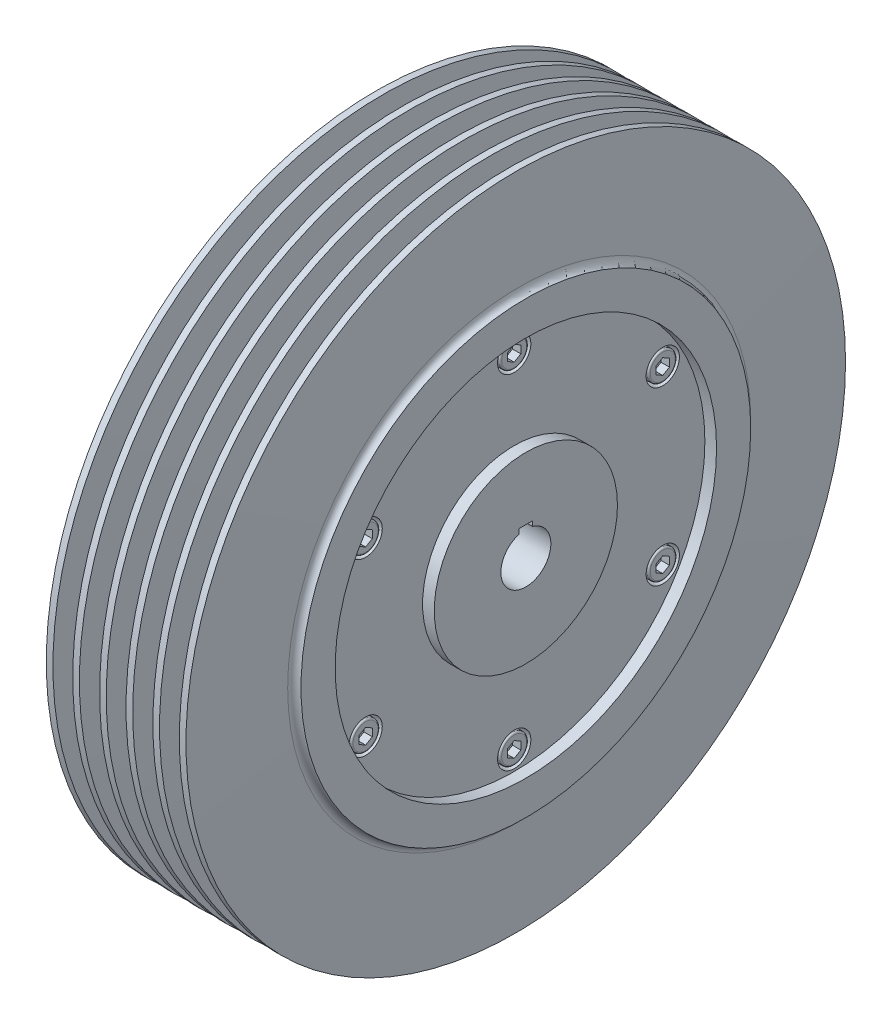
ISO-10303-21;
HEADER;
FILE_DESCRIPTION(('STEP AP214'),'2;1');
FILE_NAME('part.step','',(''),(''),'','','');
FILE_SCHEMA(('AUTOMOTIVE_DESIGN { 1 0 10303 214 1 1 1 1 }'));
ENDSEC;
DATA;
#1=APPLICATION_CONTEXT('core data for automotive mechanical design processes');
#2=APPLICATION_PROTOCOL_DEFINITION('international standard','automotive_design',2000,#1);
#3=PRODUCT_CONTEXT('',#1,'mechanical');
#4=PRODUCT('Part','Part','',(#3));
#5=PRODUCT_RELATED_PRODUCT_CATEGORY('part','',(#4));
#6=PRODUCT_DEFINITION_FORMATION('','',#4);
#7=PRODUCT_DEFINITION_CONTEXT('part definition',#1,'design');
#8=PRODUCT_DEFINITION('design','',#6,#7);
#9=PRODUCT_DEFINITION_SHAPE('','',#8);
#10=(LENGTH_UNIT() NAMED_UNIT(*) SI_UNIT(.MILLI.,.METRE.));
#11=(NAMED_UNIT(*) PLANE_ANGLE_UNIT() SI_UNIT($,.RADIAN.));
#12=(NAMED_UNIT(*) SI_UNIT($,.STERADIAN.) SOLID_ANGLE_UNIT());
#13=UNCERTAINTY_MEASURE_WITH_UNIT(LENGTH_MEASURE(1.E-05),#10,'distance_accuracy_value','');
#14=(GEOMETRIC_REPRESENTATION_CONTEXT(3) GLOBAL_UNCERTAINTY_ASSIGNED_CONTEXT((#13)) GLOBAL_UNIT_ASSIGNED_CONTEXT((#10,
#11,#12)) REPRESENTATION_CONTEXT('',''));
#15=CARTESIAN_POINT('',(0.,0.,0.));
#16=DIRECTION('',(0.,0.,1.));
#17=DIRECTION('',(1.,0.,0.));
#18=AXIS2_PLACEMENT_3D('',#15,#16,#17);
#19=CARTESIAN_POINT('',(-3.50378499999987,-25.7499999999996,44.6003082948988));
#20=DIRECTION('',(-1.,0.,0.));
#21=DIRECTION('',(0.,-0.866025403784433,0.50000000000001));
#22=AXIS2_PLACEMENT_3D('',#19,#20,#21);
#23=PLANE('',#22);
#24=CARTESIAN_POINT('',(-3.50378499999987,-25.7499999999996,44.6003082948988));
#25=DIRECTION('',(1.,0.,0.));
#26=DIRECTION('',(0.,0.866025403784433,-0.50000000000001));
#27=AXIS2_PLACEMENT_3D('',#24,#25,#26);
#28=CIRCLE('',#27,3.75);
#29=CARTESIAN_POINT('',(-3.50378499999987,-22.502404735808,42.7253082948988));
#30=VERTEX_POINT('',#29);
#31=EDGE_CURVE('E154',#30,#30,#28,.T.);
#32=ORIENTED_EDGE('',*,*,#31,.T.);
#33=EDGE_LOOP('',(#32));
#34=FACE_BOUND('',#33,.T.);
#35=DIRECTION('',(0.,1.,0.));
#36=VECTOR('',#35,1.);
#37=CARTESIAN_POINT('',(-3.50378499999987,-24.5952994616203,46.6003082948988));
#38=LINE('',#37,#36);
#39=CARTESIAN_POINT('',(-3.50378499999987,-26.9047005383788,46.6003082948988));
#40=VERTEX_POINT('',#39);
#41=CARTESIAN_POINT('',(-3.50378499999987,-24.5952994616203,46.6003082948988));
#42=VERTEX_POINT('',#41);
#43=EDGE_CURVE('E58',#40,#42,#38,.T.);
#44=ORIENTED_EDGE('',*,*,#43,.T.);
#45=DIRECTION('',(0.,0.499999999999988,-0.866025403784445));
#46=VECTOR('',#45,1.);
#47=CARTESIAN_POINT('',(-3.50378499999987,-24.5952994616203,46.6003082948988));
#48=LINE('',#47,#46);
#49=CARTESIAN_POINT('',(-3.50378499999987,-23.4405989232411,44.6003082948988));
#50=VERTEX_POINT('',#49);
#51=EDGE_CURVE('E98',#42,#50,#48,.T.);
#52=ORIENTED_EDGE('',*,*,#51,.T.);
#53=DIRECTION('',(0.,-0.50000000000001,-0.866025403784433));
#54=VECTOR('',#53,1.);
#55=CARTESIAN_POINT('',(-3.50378499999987,-24.5952994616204,42.6003082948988));
#56=LINE('',#55,#54);
#57=CARTESIAN_POINT('',(-3.50378499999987,-24.5952994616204,42.6003082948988));
#58=VERTEX_POINT('',#57);
#59=EDGE_CURVE('E106',#50,#58,#56,.T.);
#60=ORIENTED_EDGE('',*,*,#59,.T.);
#61=DIRECTION('',(0.,-1.,0.));
#62=VECTOR('',#61,1.);
#63=CARTESIAN_POINT('',(-3.50378499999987,-26.9047005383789,42.6003082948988));
#64=LINE('',#63,#62);
#65=CARTESIAN_POINT('',(-3.50378499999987,-26.9047005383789,42.6003082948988));
#66=VERTEX_POINT('',#65);
#67=EDGE_CURVE('E124',#58,#66,#64,.T.);
#68=ORIENTED_EDGE('',*,*,#67,.T.);
#69=DIRECTION('',(0.,-0.499999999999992,0.866025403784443));
#70=VECTOR('',#69,1.);
#71=CARTESIAN_POINT('',(-3.50378499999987,-26.9047005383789,42.6003082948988));
#72=LINE('',#71,#70);
#73=CARTESIAN_POINT('',(-3.50378499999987,-28.0594010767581,44.6003082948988));
#74=VERTEX_POINT('',#73);
#75=EDGE_CURVE('E127',#66,#74,#72,.T.);
#76=ORIENTED_EDGE('',*,*,#75,.T.);
#77=DIRECTION('',(0.,0.50000000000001,0.866025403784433));
#78=VECTOR('',#77,1.);
#79=CARTESIAN_POINT('',(-3.50378499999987,-28.0594010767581,44.6003082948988));
#80=LINE('',#79,#78);
#81=EDGE_CURVE('E117',#74,#40,#80,.T.);
#82=ORIENTED_EDGE('',*,*,#81,.T.);
#83=EDGE_LOOP('',(#44,#52,#60,#68,#76,#82));
#84=FACE_BOUND('',#83,.T.);
#85=ADVANCED_FACE('F44',(#34,#84),#23,.F.);
#86=CARTESIAN_POINT('',(-4.00378499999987,-25.7499999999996,44.6003082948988));
#87=DIRECTION('',(1.,0.,0.));
#88=DIRECTION('',(0.,0.866025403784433,-0.50000000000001));
#89=AXIS2_PLACEMENT_3D('',#86,#87,#88);
#90=TOROIDAL_SURFACE('',#89,3.75,0.5);
#91=ORIENTED_EDGE('',*,*,#31,.F.);
#92=EDGE_LOOP('',(#91));
#93=FACE_BOUND('',#92,.T.);
#94=CARTESIAN_POINT('',(-4.00378499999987,-25.7499999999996,44.6003082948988));
#95=DIRECTION('',(1.,0.,0.));
#96=DIRECTION('',(0.,0.866025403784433,-0.50000000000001));
#97=AXIS2_PLACEMENT_3D('',#94,#95,#96);
#98=CIRCLE('',#97,4.25);
#99=CARTESIAN_POINT('',(-4.00378499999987,-22.0693920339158,42.4753082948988));
#100=VERTEX_POINT('',#99);
#101=EDGE_CURVE('E151',#100,#100,#98,.T.);
#102=ORIENTED_EDGE('',*,*,#101,.T.);
#103=EDGE_LOOP('',(#102));
#104=FACE_BOUND('',#103,.T.);
#105=ADVANCED_FACE('F173',(#93,#104),#90,.T.);
#106=CARTESIAN_POINT('',(-8.50378499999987,-25.7499999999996,44.6003082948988));
#107=DIRECTION('',(1.,0.,0.));
#108=DIRECTION('',(0.,0.866025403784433,-0.50000000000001));
#109=AXIS2_PLACEMENT_3D('',#106,#107,#108);
#110=CYLINDRICAL_SURFACE('',#109,4.25);
#111=ORIENTED_EDGE('',*,*,#101,.F.);
#112=EDGE_LOOP('',(#111));
#113=FACE_BOUND('',#112,.T.);
#114=CARTESIAN_POINT('',(-8.50378499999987,-25.7499999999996,44.6003082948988));
#115=DIRECTION('',(1.,0.,0.));
#116=DIRECTION('',(0.,0.866025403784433,-0.50000000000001));
#117=AXIS2_PLACEMENT_3D('',#114,#115,#116);
#118=CIRCLE('',#117,4.25);
#119=CARTESIAN_POINT('',(-8.50378499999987,-22.0693920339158,42.4753082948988));
#120=VERTEX_POINT('',#119);
#121=EDGE_CURVE('E112',#120,#120,#118,.T.);
#122=ORIENTED_EDGE('',*,*,#121,.T.);
#123=EDGE_LOOP('',(#122));
#124=FACE_BOUND('',#123,.T.);
#125=ADVANCED_FACE('F178',(#113,#124),#110,.T.);
#126=CARTESIAN_POINT('',(-8.50378499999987,-25.7499999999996,44.6003082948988));
#127=DIRECTION('',(1.,0.,0.));
#128=DIRECTION('',(0.,0.866025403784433,-0.50000000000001));
#129=AXIS2_PLACEMENT_3D('',#126,#127,#128);
#130=PLANE('',#129);
#131=CARTESIAN_POINT('',(-8.50378499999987,-25.7499999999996,44.6003082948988));
#132=DIRECTION('',(-1.,0.,0.));
#133=DIRECTION('',(0.,-0.866025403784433,0.50000000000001));
#134=AXIS2_PLACEMENT_3D('',#131,#132,#133);
#135=CIRCLE('',#134,2.5);
#136=CARTESIAN_POINT('',(-8.50378499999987,-27.9150635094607,45.8503082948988));
#137=VERTEX_POINT('',#136);
#138=EDGE_CURVE('E118',#137,#137,#135,.T.);
#139=ORIENTED_EDGE('',*,*,#138,.F.);
#140=EDGE_LOOP('',(#139));
#141=FACE_BOUND('',#140,.T.);
#142=ORIENTED_EDGE('',*,*,#121,.F.);
#143=EDGE_LOOP('',(#142));
#144=FACE_BOUND('',#143,.T.);
#145=ADVANCED_FACE('F186',(#141,#144),#130,.F.);
#146=CARTESIAN_POINT('',(-6.00378499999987,-24.5952994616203,46.6003082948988));
#147=DIRECTION('',(0.,0.,-1.));
#148=DIRECTION('',(0.,-1.,0.));
#149=AXIS2_PLACEMENT_3D('',#146,#147,#148);
#150=PLANE('',#149);
#151=ORIENTED_EDGE('',*,*,#43,.F.);
#152=DIRECTION('',(1.,0.,0.));
#153=VECTOR('',#152,1.);
#154=CARTESIAN_POINT('',(-6.00378499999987,-26.9047005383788,46.6003082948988));
#155=LINE('',#154,#153);
#156=CARTESIAN_POINT('',(-6.00378499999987,-26.9047005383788,46.6003082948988));
#157=VERTEX_POINT('',#156);
#158=EDGE_CURVE('E140',#157,#40,#155,.T.);
#159=ORIENTED_EDGE('',*,*,#158,.F.);
#160=DIRECTION('',(0.,1.,0.));
#161=VECTOR('',#160,1.);
#162=CARTESIAN_POINT('',(-6.00378499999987,-24.5952994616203,46.6003082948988));
#163=LINE('',#162,#161);
#164=CARTESIAN_POINT('',(-6.00378499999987,-24.5952994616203,46.6003082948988));
#165=VERTEX_POINT('',#164);
#166=EDGE_CURVE('E111',#157,#165,#163,.T.);
#167=ORIENTED_EDGE('',*,*,#166,.T.);
#168=DIRECTION('',(1.,0.,0.));
#169=VECTOR('',#168,1.);
#170=CARTESIAN_POINT('',(-6.00378499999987,-24.5952994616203,46.6003082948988));
#171=LINE('',#170,#169);
#172=EDGE_CURVE('E100',#165,#42,#171,.T.);
#173=ORIENTED_EDGE('',*,*,#172,.T.);
#174=EDGE_LOOP('',(#151,#159,#167,#173));
#175=FACE_BOUND('',#174,.T.);
#176=ADVANCED_FACE('F109',(#175),#150,.T.);
#177=CARTESIAN_POINT('',(-6.00378499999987,-24.5952994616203,46.6003082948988));
#178=DIRECTION('',(0.,-0.866025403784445,-0.499999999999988));
#179=DIRECTION('',(0.,-0.499999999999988,0.866025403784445));
#180=AXIS2_PLACEMENT_3D('',#177,#178,#179);
#181=PLANE('',#180);
#182=ORIENTED_EDGE('',*,*,#51,.F.);
#183=ORIENTED_EDGE('',*,*,#172,.F.);
#184=DIRECTION('',(0.,0.499999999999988,-0.866025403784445));
#185=VECTOR('',#184,1.);
#186=CARTESIAN_POINT('',(-6.00378499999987,-24.5952994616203,46.6003082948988));
#187=LINE('',#186,#185);
#188=CARTESIAN_POINT('',(-6.00378499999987,-23.4405989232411,44.6003082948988));
#189=VERTEX_POINT('',#188);
#190=EDGE_CURVE('E131',#165,#189,#187,.T.);
#191=ORIENTED_EDGE('',*,*,#190,.T.);
#192=DIRECTION('',(1.,0.,0.));
#193=VECTOR('',#192,1.);
#194=CARTESIAN_POINT('',(-6.00378499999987,-23.4405989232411,44.6003082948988));
#195=LINE('',#194,#193);
#196=EDGE_CURVE('E102',#189,#50,#195,.T.);
#197=ORIENTED_EDGE('',*,*,#196,.T.);
#198=EDGE_LOOP('',(#182,#183,#191,#197));
#199=FACE_BOUND('',#198,.T.);
#200=ADVANCED_FACE('F99',(#199),#181,.T.);
#201=CARTESIAN_POINT('',(-6.00378499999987,-24.5952994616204,42.6003082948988));
#202=DIRECTION('',(0.,-0.866025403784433,0.50000000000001));
#203=DIRECTION('',(1.,0.,0.));
#204=AXIS2_PLACEMENT_3D('',#201,#202,#203);
#205=PLANE('',#204);
#206=ORIENTED_EDGE('',*,*,#59,.F.);
#207=ORIENTED_EDGE('',*,*,#196,.F.);
#208=DIRECTION('',(0.,-0.50000000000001,-0.866025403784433));
#209=VECTOR('',#208,1.);
#210=CARTESIAN_POINT('',(-6.00378499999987,-24.5952994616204,42.6003082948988));
#211=LINE('',#210,#209);
#212=CARTESIAN_POINT('',(-6.00378499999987,-24.5952994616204,42.6003082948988));
#213=VERTEX_POINT('',#212);
#214=EDGE_CURVE('E133',#189,#213,#211,.T.);
#215=ORIENTED_EDGE('',*,*,#214,.T.);
#216=DIRECTION('',(1.,0.,0.));
#217=VECTOR('',#216,1.);
#218=CARTESIAN_POINT('',(-6.00378499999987,-24.5952994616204,42.6003082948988));
#219=LINE('',#218,#217);
#220=EDGE_CURVE('E146',#213,#58,#219,.T.);
#221=ORIENTED_EDGE('',*,*,#220,.T.);
#222=EDGE_LOOP('',(#206,#207,#215,#221));
#223=FACE_BOUND('',#222,.T.);
#224=ADVANCED_FACE('F201',(#223),#205,.T.);
#225=CARTESIAN_POINT('',(-6.00378499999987,-26.9047005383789,42.6003082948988));
#226=DIRECTION('',(0.,0.,1.));
#227=DIRECTION('',(0.,1.,0.));
#228=AXIS2_PLACEMENT_3D('',#225,#226,#227);
#229=PLANE('',#228);
#230=ORIENTED_EDGE('',*,*,#67,.F.);
#231=ORIENTED_EDGE('',*,*,#220,.F.);
#232=DIRECTION('',(0.,-1.,0.));
#233=VECTOR('',#232,1.);
#234=CARTESIAN_POINT('',(-6.00378499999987,-26.9047005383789,42.6003082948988));
#235=LINE('',#234,#233);
#236=CARTESIAN_POINT('',(-6.00378499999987,-26.9047005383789,42.6003082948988));
#237=VERTEX_POINT('',#236);
#238=EDGE_CURVE('E135',#213,#237,#235,.T.);
#239=ORIENTED_EDGE('',*,*,#238,.T.);
#240=DIRECTION('',(1.,0.,0.));
#241=VECTOR('',#240,1.);
#242=CARTESIAN_POINT('',(-6.00378499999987,-26.9047005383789,42.6003082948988));
#243=LINE('',#242,#241);
#244=EDGE_CURVE('E144',#237,#66,#243,.T.);
#245=ORIENTED_EDGE('',*,*,#244,.T.);
#246=EDGE_LOOP('',(#230,#231,#239,#245));
#247=FACE_BOUND('',#246,.T.);
#248=ADVANCED_FACE('F204',(#247),#229,.T.);
#249=CARTESIAN_POINT('',(-6.00378499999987,-26.9047005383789,42.6003082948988));
#250=DIRECTION('',(0.,0.866025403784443,0.499999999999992));
#251=DIRECTION('',(0.,0.499999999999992,-0.866025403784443));
#252=AXIS2_PLACEMENT_3D('',#249,#250,#251);
#253=PLANE('',#252);
#254=ORIENTED_EDGE('',*,*,#75,.F.);
#255=ORIENTED_EDGE('',*,*,#244,.F.);
#256=DIRECTION('',(0.,-0.499999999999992,0.866025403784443));
#257=VECTOR('',#256,1.);
#258=CARTESIAN_POINT('',(-6.00378499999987,-26.9047005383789,42.6003082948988));
#259=LINE('',#258,#257);
#260=CARTESIAN_POINT('',(-6.00378499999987,-28.0594010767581,44.6003082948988));
#261=VERTEX_POINT('',#260);
#262=EDGE_CURVE('E137',#237,#261,#259,.T.);
#263=ORIENTED_EDGE('',*,*,#262,.T.);
#264=DIRECTION('',(1.,0.,0.));
#265=VECTOR('',#264,1.);
#266=CARTESIAN_POINT('',(-6.00378499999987,-28.0594010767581,44.6003082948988));
#267=LINE('',#266,#265);
#268=EDGE_CURVE('E142',#261,#74,#267,.T.);
#269=ORIENTED_EDGE('',*,*,#268,.T.);
#270=EDGE_LOOP('',(#254,#255,#263,#269));
#271=FACE_BOUND('',#270,.T.);
#272=ADVANCED_FACE('F208',(#271),#253,.T.);
#273=CARTESIAN_POINT('',(-6.00378499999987,-28.0594010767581,44.6003082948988));
#274=DIRECTION('',(0.,0.866025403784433,-0.50000000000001));
#275=DIRECTION('',(-1.,0.,0.));
#276=AXIS2_PLACEMENT_3D('',#273,#274,#275);
#277=PLANE('',#276);
#278=ORIENTED_EDGE('',*,*,#81,.F.);
#279=ORIENTED_EDGE('',*,*,#268,.F.);
#280=DIRECTION('',(0.,0.50000000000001,0.866025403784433));
#281=VECTOR('',#280,1.);
#282=CARTESIAN_POINT('',(-6.00378499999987,-28.0594010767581,44.6003082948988));
#283=LINE('',#282,#281);
#284=EDGE_CURVE('E65',#261,#157,#283,.T.);
#285=ORIENTED_EDGE('',*,*,#284,.T.);
#286=ORIENTED_EDGE('',*,*,#158,.T.);
#287=EDGE_LOOP('',(#278,#279,#285,#286));
#288=FACE_BOUND('',#287,.T.);
#289=ADVANCED_FACE('F212',(#288),#277,.T.);
#290=CARTESIAN_POINT('',(-6.00378499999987,-26.9047005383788,46.6003082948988));
#291=DIRECTION('',(-1.,0.,0.));
#292=DIRECTION('',(0.,-0.866025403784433,0.50000000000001));
#293=AXIS2_PLACEMENT_3D('',#290,#291,#292);
#294=PLANE('',#293);
#295=ORIENTED_EDGE('',*,*,#166,.F.);
#296=ORIENTED_EDGE('',*,*,#284,.F.);
#297=ORIENTED_EDGE('',*,*,#262,.F.);
#298=ORIENTED_EDGE('',*,*,#238,.F.);
#299=ORIENTED_EDGE('',*,*,#214,.F.);
#300=ORIENTED_EDGE('',*,*,#190,.F.);
#301=EDGE_LOOP('',(#295,#296,#297,#298,#299,#300));
#302=FACE_BOUND('',#301,.T.);
#303=ADVANCED_FACE('F216',(#302),#294,.F.);
#304=CARTESIAN_POINT('',(-33.5037849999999,-25.7499999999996,44.6003082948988));
#305=DIRECTION('',(-1.,0.,0.));
#306=DIRECTION('',(0.,-0.866025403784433,0.50000000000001));
#307=AXIS2_PLACEMENT_3D('',#304,#305,#306);
#308=PLANE('',#307);
#309=CARTESIAN_POINT('',(-33.5037849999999,-25.7499999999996,44.6003082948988));
#310=DIRECTION('',(-1.,0.,0.));
#311=DIRECTION('',(0.,-0.866025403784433,0.50000000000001));
#312=AXIS2_PLACEMENT_3D('',#309,#310,#311);
#313=CIRCLE('',#312,2.);
#314=CARTESIAN_POINT('',(-33.5037849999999,-27.4820508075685,45.6003082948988));
#315=VERTEX_POINT('',#314);
#316=EDGE_CURVE('E51',#315,#315,#313,.T.);
#317=ORIENTED_EDGE('',*,*,#316,.T.);
#318=EDGE_LOOP('',(#317));
#319=FACE_BOUND('',#318,.T.);
#320=ADVANCED_FACE('F159',(#319),#308,.T.);
#321=CARTESIAN_POINT('',(-8.50378499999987,-25.7499999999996,44.6003082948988));
#322=DIRECTION('',(-1.,0.,0.));
#323=DIRECTION('',(0.,-0.866025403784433,0.50000000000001));
#324=AXIS2_PLACEMENT_3D('',#321,#322,#323);
#325=CYLINDRICAL_SURFACE('',#324,2.5);
#326=CARTESIAN_POINT('',(-33.0037849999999,-25.7499999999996,44.6003082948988));
#327=DIRECTION('',(-1.,0.,0.));
#328=DIRECTION('',(0.,-0.866025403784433,0.50000000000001));
#329=AXIS2_PLACEMENT_3D('',#326,#327,#328);
#330=CIRCLE('',#329,2.5);
#331=CARTESIAN_POINT('',(-33.0037849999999,-27.9150635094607,45.8503082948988));
#332=VERTEX_POINT('',#331);
#333=EDGE_CURVE('E12',#332,#332,#330,.F.);
#334=ORIENTED_EDGE('',*,*,#333,.T.);
#335=EDGE_LOOP('',(#334));
#336=FACE_BOUND('',#335,.T.);
#337=ORIENTED_EDGE('',*,*,#138,.T.);
#338=EDGE_LOOP('',(#337));
#339=FACE_BOUND('',#338,.T.);
#340=ADVANCED_FACE('F163',(#336,#339),#325,.T.);
#341=CARTESIAN_POINT('',(-33.5037849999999,-25.7499999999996,44.6003082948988));
#342=DIRECTION('',(1.,0.,0.));
#343=DIRECTION('',(0.,0.866025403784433,-0.50000000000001));
#344=AXIS2_PLACEMENT_3D('',#341,#342,#343);
#345=CONICAL_SURFACE('',#344,2.,0.785398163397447);
#346=ORIENTED_EDGE('',*,*,#333,.F.);
#347=EDGE_LOOP('',(#346));
#348=FACE_BOUND('',#347,.T.);
#349=ORIENTED_EDGE('',*,*,#316,.F.);
#350=EDGE_LOOP('',(#349));
#351=FACE_BOUND('',#350,.T.);
#352=ADVANCED_FACE('F161',(#348,#351),#345,.T.);
#353=CLOSED_SHELL('',(#85,#105,#125,#145,#176,#200,#224,#248,#272,#289,#303,#320,#340,#352));
#354=MANIFOLD_SOLID_BREP('B2',#353);
#355=CARTESIAN_POINT('',(-3.50378499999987,-51.5,3.33066907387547E-13));
#356=DIRECTION('',(-1.,0.,0.));
#357=DIRECTION('',(0.,-0.866025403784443,-0.499999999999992));
#358=AXIS2_PLACEMENT_3D('',#355,#356,#357);
#359=PLANE('',#358);
#360=CARTESIAN_POINT('',(-3.50378499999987,-51.5,3.33066907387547E-13));
#361=DIRECTION('',(1.,0.,0.));
#362=DIRECTION('',(0.,0.866025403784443,0.499999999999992));
#363=AXIS2_PLACEMENT_3D('',#360,#361,#362);
#364=CIRCLE('',#363,3.75);
#365=CARTESIAN_POINT('',(-3.50378499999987,-48.2524047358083,1.8750000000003));
#366=VERTEX_POINT('',#365);
#367=EDGE_CURVE('E430',#366,#366,#364,.T.);
#368=ORIENTED_EDGE('',*,*,#367,.T.);
#369=EDGE_LOOP('',(#368));
#370=FACE_BOUND('',#369,.T.);
#371=DIRECTION('',(0.,0.500000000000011,0.866025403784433));
#372=VECTOR('',#371,1.);
#373=CARTESIAN_POINT('',(-3.50378499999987,-52.6547005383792,2.00000000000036));
#374=LINE('',#373,#372);
#375=CARTESIAN_POINT('',(-3.50378499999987,-53.8094010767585,3.60822483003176E-13));
#376=VERTEX_POINT('',#375);
#377=CARTESIAN_POINT('',(-3.50378499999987,-52.6547005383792,2.00000000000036));
#378=VERTEX_POINT('',#377);
#379=EDGE_CURVE('E334',#376,#378,#374,.T.);
#380=ORIENTED_EDGE('',*,*,#379,.T.);
#381=DIRECTION('',(0.,1.,0.));
#382=VECTOR('',#381,1.);
#383=CARTESIAN_POINT('',(-3.50378499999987,-52.6547005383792,2.00000000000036));
#384=LINE('',#383,#382);
#385=CARTESIAN_POINT('',(-3.50378499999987,-50.3452994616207,2.00000000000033));
#386=VERTEX_POINT('',#385);
#387=EDGE_CURVE('E374',#378,#386,#384,.T.);
#388=ORIENTED_EDGE('',*,*,#387,.T.);
#389=DIRECTION('',(0.,0.499999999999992,-0.866025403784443));
#390=VECTOR('',#389,1.);
#391=CARTESIAN_POINT('',(-3.50378499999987,-49.1905989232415,3.12250225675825E-13));
#392=LINE('',#391,#390);
#393=CARTESIAN_POINT('',(-3.50378499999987,-49.1905989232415,3.12250225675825E-13));
#394=VERTEX_POINT('',#393);
#395=EDGE_CURVE('E382',#386,#394,#392,.T.);
#396=ORIENTED_EDGE('',*,*,#395,.T.);
#397=DIRECTION('',(0.,-0.500000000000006,-0.866025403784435));
#398=VECTOR('',#397,1.);
#399=CARTESIAN_POINT('',(-3.50378499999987,-50.3452994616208,-1.99999999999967));
#400=LINE('',#399,#398);
#401=CARTESIAN_POINT('',(-3.50378499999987,-50.3452994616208,-1.99999999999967));
#402=VERTEX_POINT('',#401);
#403=EDGE_CURVE('E400',#394,#402,#400,.T.);
#404=ORIENTED_EDGE('',*,*,#403,.T.);
#405=DIRECTION('',(0.,-1.,0.));
#406=VECTOR('',#405,1.);
#407=CARTESIAN_POINT('',(-3.50378499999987,-50.3452994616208,-1.99999999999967));
#408=LINE('',#407,#406);
#409=CARTESIAN_POINT('',(-3.50378499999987,-52.6547005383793,-1.99999999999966));
#410=VERTEX_POINT('',#409);
#411=EDGE_CURVE('E403',#402,#410,#408,.T.);
#412=ORIENTED_EDGE('',*,*,#411,.T.);
#413=DIRECTION('',(0.,-0.499999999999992,0.866025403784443));
#414=VECTOR('',#413,1.);
#415=CARTESIAN_POINT('',(-3.50378499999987,-52.6547005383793,-1.99999999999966));
#416=LINE('',#415,#414);
#417=EDGE_CURVE('E393',#410,#376,#416,.T.);
#418=ORIENTED_EDGE('',*,*,#417,.T.);
#419=EDGE_LOOP('',(#380,#388,#396,#404,#412,#418));
#420=FACE_BOUND('',#419,.T.);
#421=ADVANCED_FACE('F320',(#370,#420),#359,.F.);
#422=CARTESIAN_POINT('',(-4.00378499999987,-51.5,3.33066907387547E-13));
#423=DIRECTION('',(1.,0.,0.));
#424=DIRECTION('',(0.,0.866025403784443,0.499999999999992));
#425=AXIS2_PLACEMENT_3D('',#422,#423,#424);
#426=TOROIDAL_SURFACE('',#425,3.75,0.5);
#427=ORIENTED_EDGE('',*,*,#367,.F.);
#428=EDGE_LOOP('',(#427));
#429=FACE_BOUND('',#428,.T.);
#430=CARTESIAN_POINT('',(-4.00378499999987,-51.5,3.33066907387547E-13));
#431=DIRECTION('',(1.,0.,0.));
#432=DIRECTION('',(0.,0.866025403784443,0.499999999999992));
#433=AXIS2_PLACEMENT_3D('',#430,#431,#432);
#434=CIRCLE('',#433,4.25);
#435=CARTESIAN_POINT('',(-4.00378499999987,-47.8193920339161,2.1250000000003));
#436=VERTEX_POINT('',#435);
#437=EDGE_CURVE('E427',#436,#436,#434,.T.);
#438=ORIENTED_EDGE('',*,*,#437,.T.);
#439=EDGE_LOOP('',(#438));
#440=FACE_BOUND('',#439,.T.);
#441=ADVANCED_FACE('F449',(#429,#440),#426,.T.);
#442=CARTESIAN_POINT('',(-8.50378499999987,-51.5,3.33066907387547E-13));
#443=DIRECTION('',(1.,0.,0.));
#444=DIRECTION('',(0.,0.866025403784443,0.499999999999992));
#445=AXIS2_PLACEMENT_3D('',#442,#443,#444);
#446=CYLINDRICAL_SURFACE('',#445,4.25);
#447=ORIENTED_EDGE('',*,*,#437,.F.);
#448=EDGE_LOOP('',(#447));
#449=FACE_BOUND('',#448,.T.);
#450=CARTESIAN_POINT('',(-8.50378499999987,-51.5,3.33066907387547E-13));
#451=DIRECTION('',(1.,0.,0.));
#452=DIRECTION('',(0.,0.866025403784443,0.499999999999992));
#453=AXIS2_PLACEMENT_3D('',#450,#451,#452);
#454=CIRCLE('',#453,4.25);
#455=CARTESIAN_POINT('',(-8.50378499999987,-47.8193920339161,2.1250000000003));
#456=VERTEX_POINT('',#455);
#457=EDGE_CURVE('E388',#456,#456,#454,.T.);
#458=ORIENTED_EDGE('',*,*,#457,.T.);
#459=EDGE_LOOP('',(#458));
#460=FACE_BOUND('',#459,.T.);
#461=ADVANCED_FACE('F454',(#449,#460),#446,.T.);
#462=CARTESIAN_POINT('',(-8.50378499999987,-51.5,3.33066907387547E-13));
#463=DIRECTION('',(1.,0.,0.));
#464=DIRECTION('',(0.,0.866025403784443,0.499999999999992));
#465=AXIS2_PLACEMENT_3D('',#462,#463,#464);
#466=PLANE('',#465);
#467=CARTESIAN_POINT('',(-8.50378499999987,-51.5,3.33066907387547E-13));
#468=DIRECTION('',(-1.,0.,0.));
#469=DIRECTION('',(0.,-0.866025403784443,-0.499999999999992));
#470=AXIS2_PLACEMENT_3D('',#467,#468,#469);
#471=CIRCLE('',#470,2.5);
#472=CARTESIAN_POINT('',(-8.50378499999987,-53.6650635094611,-1.24999999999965));
#473=VERTEX_POINT('',#472);
#474=EDGE_CURVE('E394',#473,#473,#471,.T.);
#475=ORIENTED_EDGE('',*,*,#474,.F.);
#476=EDGE_LOOP('',(#475));
#477=FACE_BOUND('',#476,.T.);
#478=ORIENTED_EDGE('',*,*,#457,.F.);
#479=EDGE_LOOP('',(#478));
#480=FACE_BOUND('',#479,.T.);
#481=ADVANCED_FACE('F462',(#477,#480),#466,.F.);
#482=CARTESIAN_POINT('',(-6.00378499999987,-52.6547005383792,2.00000000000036));
#483=DIRECTION('',(0.,0.866025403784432,-0.50000000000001));
#484=DIRECTION('',(0.,-0.50000000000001,-0.866025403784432));
#485=AXIS2_PLACEMENT_3D('',#482,#483,#484);
#486=PLANE('',#485);
#487=ORIENTED_EDGE('',*,*,#379,.F.);
#488=DIRECTION('',(1.,0.,0.));
#489=VECTOR('',#488,1.);
#490=CARTESIAN_POINT('',(-6.00378499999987,-53.8094010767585,3.60822483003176E-13));
#491=LINE('',#490,#489);
#492=CARTESIAN_POINT('',(-6.00378499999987,-53.8094010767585,3.60822483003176E-13));
#493=VERTEX_POINT('',#492);
#494=EDGE_CURVE('E416',#493,#376,#491,.T.);
#495=ORIENTED_EDGE('',*,*,#494,.F.);
#496=DIRECTION('',(0.,0.500000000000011,0.866025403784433));
#497=VECTOR('',#496,1.);
#498=CARTESIAN_POINT('',(-6.00378499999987,-52.6547005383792,2.00000000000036));
#499=LINE('',#498,#497);
#500=CARTESIAN_POINT('',(-6.00378499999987,-52.6547005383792,2.00000000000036));
#501=VERTEX_POINT('',#500);
#502=EDGE_CURVE('E387',#493,#501,#499,.T.);
#503=ORIENTED_EDGE('',*,*,#502,.T.);
#504=DIRECTION('',(1.,0.,0.));
#505=VECTOR('',#504,1.);
#506=CARTESIAN_POINT('',(-6.00378499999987,-52.6547005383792,2.00000000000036));
#507=LINE('',#506,#505);
#508=EDGE_CURVE('E376',#501,#378,#507,.T.);
#509=ORIENTED_EDGE('',*,*,#508,.T.);
#510=EDGE_LOOP('',(#487,#495,#503,#509));
#511=FACE_BOUND('',#510,.T.);
#512=ADVANCED_FACE('F385',(#511),#486,.T.);
#513=CARTESIAN_POINT('',(-6.00378499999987,-52.6547005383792,2.00000000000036));
#514=DIRECTION('',(0.,0.,-1.));
#515=DIRECTION('',(0.,-1.,0.));
#516=AXIS2_PLACEMENT_3D('',#513,#514,#515);
#517=PLANE('',#516);
#518=ORIENTED_EDGE('',*,*,#387,.F.);
#519=ORIENTED_EDGE('',*,*,#508,.F.);
#520=DIRECTION('',(0.,1.,0.));
#521=VECTOR('',#520,1.);
#522=CARTESIAN_POINT('',(-6.00378499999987,-52.6547005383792,2.00000000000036));
#523=LINE('',#522,#521);
#524=CARTESIAN_POINT('',(-6.00378499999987,-50.3452994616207,2.00000000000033));
#525=VERTEX_POINT('',#524);
#526=EDGE_CURVE('E407',#501,#525,#523,.T.);
#527=ORIENTED_EDGE('',*,*,#526,.T.);
#528=DIRECTION('',(1.,0.,0.));
#529=VECTOR('',#528,1.);
#530=CARTESIAN_POINT('',(-6.00378499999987,-50.3452994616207,2.00000000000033));
#531=LINE('',#530,#529);
#532=EDGE_CURVE('E378',#525,#386,#531,.T.);
#533=ORIENTED_EDGE('',*,*,#532,.T.);
#534=EDGE_LOOP('',(#518,#519,#527,#533));
#535=FACE_BOUND('',#534,.T.);
#536=ADVANCED_FACE('F375',(#535),#517,.T.);
#537=CARTESIAN_POINT('',(-6.00378499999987,-49.1905989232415,3.12250225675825E-13));
#538=DIRECTION('',(0.,-0.866025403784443,-0.499999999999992));
#539=DIRECTION('',(1.,0.,0.));
#540=AXIS2_PLACEMENT_3D('',#537,#538,#539);
#541=PLANE('',#540);
#542=ORIENTED_EDGE('',*,*,#395,.F.);
#543=ORIENTED_EDGE('',*,*,#532,.F.);
#544=DIRECTION('',(0.,0.499999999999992,-0.866025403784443));
#545=VECTOR('',#544,1.);
#546=CARTESIAN_POINT('',(-6.00378499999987,-49.1905989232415,3.12250225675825E-13));
#547=LINE('',#546,#545);
#548=CARTESIAN_POINT('',(-6.00378499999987,-49.1905989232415,3.12250225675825E-13));
#549=VERTEX_POINT('',#548);
#550=EDGE_CURVE('E409',#525,#549,#547,.T.);
#551=ORIENTED_EDGE('',*,*,#550,.T.);
#552=DIRECTION('',(1.,0.,0.));
#553=VECTOR('',#552,1.);
#554=CARTESIAN_POINT('',(-6.00378499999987,-49.1905989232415,3.12250225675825E-13));
#555=LINE('',#554,#553);
#556=EDGE_CURVE('E422',#549,#394,#555,.T.);
#557=ORIENTED_EDGE('',*,*,#556,.T.);
#558=EDGE_LOOP('',(#542,#543,#551,#557));
#559=FACE_BOUND('',#558,.T.);
#560=ADVANCED_FACE('F477',(#559),#541,.T.);
#561=CARTESIAN_POINT('',(-6.00378499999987,-50.3452994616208,-1.99999999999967));
#562=DIRECTION('',(0.,-0.866025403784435,0.500000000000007));
#563=DIRECTION('',(0.,0.500000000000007,0.866025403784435));
#564=AXIS2_PLACEMENT_3D('',#561,#562,#563);
#565=PLANE('',#564);
#566=ORIENTED_EDGE('',*,*,#403,.F.);
#567=ORIENTED_EDGE('',*,*,#556,.F.);
#568=DIRECTION('',(0.,-0.500000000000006,-0.866025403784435));
#569=VECTOR('',#568,1.);
#570=CARTESIAN_POINT('',(-6.00378499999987,-50.3452994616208,-1.99999999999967));
#571=LINE('',#570,#569);
#572=CARTESIAN_POINT('',(-6.00378499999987,-50.3452994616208,-1.99999999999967));
#573=VERTEX_POINT('',#572);
#574=EDGE_CURVE('E411',#549,#573,#571,.T.);
#575=ORIENTED_EDGE('',*,*,#574,.T.);
#576=DIRECTION('',(1.,0.,0.));
#577=VECTOR('',#576,1.);
#578=CARTESIAN_POINT('',(-6.00378499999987,-50.3452994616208,-1.99999999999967));
#579=LINE('',#578,#577);
#580=EDGE_CURVE('E420',#573,#402,#579,.T.);
#581=ORIENTED_EDGE('',*,*,#580,.T.);
#582=EDGE_LOOP('',(#566,#567,#575,#581));
#583=FACE_BOUND('',#582,.T.);
#584=ADVANCED_FACE('F480',(#583),#565,.T.);
#585=CARTESIAN_POINT('',(-6.00378499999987,-50.3452994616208,-1.99999999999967));
#586=DIRECTION('',(0.,0.,1.));
#587=DIRECTION('',(0.,1.,0.));
#588=AXIS2_PLACEMENT_3D('',#585,#586,#587);
#589=PLANE('',#588);
#590=ORIENTED_EDGE('',*,*,#411,.F.);
#591=ORIENTED_EDGE('',*,*,#580,.F.);
#592=DIRECTION('',(0.,-1.,0.));
#593=VECTOR('',#592,1.);
#594=CARTESIAN_POINT('',(-6.00378499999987,-50.3452994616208,-1.99999999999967));
#595=LINE('',#594,#593);
#596=CARTESIAN_POINT('',(-6.00378499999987,-52.6547005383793,-1.99999999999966));
#597=VERTEX_POINT('',#596);
#598=EDGE_CURVE('E413',#573,#597,#595,.T.);
#599=ORIENTED_EDGE('',*,*,#598,.T.);
#600=DIRECTION('',(1.,0.,0.));
#601=VECTOR('',#600,1.);
#602=CARTESIAN_POINT('',(-6.00378499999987,-52.6547005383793,-1.99999999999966));
#603=LINE('',#602,#601);
#604=EDGE_CURVE('E418',#597,#410,#603,.T.);
#605=ORIENTED_EDGE('',*,*,#604,.T.);
#606=EDGE_LOOP('',(#590,#591,#599,#605));
#607=FACE_BOUND('',#606,.T.);
#608=ADVANCED_FACE('F484',(#607),#589,.T.);
#609=CARTESIAN_POINT('',(-6.00378499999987,-52.6547005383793,-1.99999999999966));
#610=DIRECTION('',(0.,0.866025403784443,0.499999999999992));
#611=DIRECTION('',(-1.,0.,0.));
#612=AXIS2_PLACEMENT_3D('',#609,#610,#611);
#613=PLANE('',#612);
#614=ORIENTED_EDGE('',*,*,#417,.F.);
#615=ORIENTED_EDGE('',*,*,#604,.F.);
#616=DIRECTION('',(0.,-0.499999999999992,0.866025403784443));
#617=VECTOR('',#616,1.);
#618=CARTESIAN_POINT('',(-6.00378499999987,-52.6547005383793,-1.99999999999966));
#619=LINE('',#618,#617);
#620=EDGE_CURVE('E341',#597,#493,#619,.T.);
#621=ORIENTED_EDGE('',*,*,#620,.T.);
#622=ORIENTED_EDGE('',*,*,#494,.T.);
#623=EDGE_LOOP('',(#614,#615,#621,#622));
#624=FACE_BOUND('',#623,.T.);
#625=ADVANCED_FACE('F488',(#624),#613,.T.);
#626=CARTESIAN_POINT('',(-6.00378499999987,-53.8094010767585,3.60822483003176E-13));
#627=DIRECTION('',(-1.,0.,0.));
#628=DIRECTION('',(0.,-0.866025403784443,-0.499999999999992));
#629=AXIS2_PLACEMENT_3D('',#626,#627,#628);
#630=PLANE('',#629);
#631=ORIENTED_EDGE('',*,*,#502,.F.);
#632=ORIENTED_EDGE('',*,*,#620,.F.);
#633=ORIENTED_EDGE('',*,*,#598,.F.);
#634=ORIENTED_EDGE('',*,*,#574,.F.);
#635=ORIENTED_EDGE('',*,*,#550,.F.);
#636=ORIENTED_EDGE('',*,*,#526,.F.);
#637=EDGE_LOOP('',(#631,#632,#633,#634,#635,#636));
#638=FACE_BOUND('',#637,.T.);
#639=ADVANCED_FACE('F492',(#638),#630,.F.);
#640=CARTESIAN_POINT('',(-33.5037849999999,-51.5,3.33066907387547E-13));
#641=DIRECTION('',(-1.,0.,0.));
#642=DIRECTION('',(0.,-0.866025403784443,-0.499999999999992));
#643=AXIS2_PLACEMENT_3D('',#640,#641,#642);
#644=PLANE('',#643);
#645=CARTESIAN_POINT('',(-33.5037849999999,-51.5,3.33066907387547E-13));
#646=DIRECTION('',(-1.,0.,0.));
#647=DIRECTION('',(0.,-0.866025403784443,-0.499999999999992));
#648=AXIS2_PLACEMENT_3D('',#645,#646,#647);
#649=CIRCLE('',#648,2.);
#650=CARTESIAN_POINT('',(-33.5037849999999,-53.2320508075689,-0.999999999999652));
#651=VERTEX_POINT('',#650);
#652=EDGE_CURVE('E327',#651,#651,#649,.T.);
#653=ORIENTED_EDGE('',*,*,#652,.T.);
#654=EDGE_LOOP('',(#653));
#655=FACE_BOUND('',#654,.T.);
#656=ADVANCED_FACE('F435',(#655),#644,.T.);
#657=CARTESIAN_POINT('',(-8.50378499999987,-51.5,3.33066907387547E-13));
#658=DIRECTION('',(-1.,0.,0.));
#659=DIRECTION('',(0.,-0.866025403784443,-0.499999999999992));
#660=AXIS2_PLACEMENT_3D('',#657,#658,#659);
#661=CYLINDRICAL_SURFACE('',#660,2.5);
#662=CARTESIAN_POINT('',(-33.0037849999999,-51.5,3.33066907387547E-13));
#663=DIRECTION('',(-1.,0.,0.));
#664=DIRECTION('',(0.,-0.866025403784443,-0.499999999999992));
#665=AXIS2_PLACEMENT_3D('',#662,#663,#664);
#666=CIRCLE('',#665,2.5);
#667=CARTESIAN_POINT('',(-33.0037849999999,-53.6650635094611,-1.24999999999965));
#668=VERTEX_POINT('',#667);
#669=EDGE_CURVE('E42',#668,#668,#666,.F.);
#670=ORIENTED_EDGE('',*,*,#669,.T.);
#671=EDGE_LOOP('',(#670));
#672=FACE_BOUND('',#671,.T.);
#673=ORIENTED_EDGE('',*,*,#474,.T.);
#674=EDGE_LOOP('',(#673));
#675=FACE_BOUND('',#674,.T.);
#676=ADVANCED_FACE('F439',(#672,#675),#661,.T.);
#677=CARTESIAN_POINT('',(-33.5037849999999,-51.5,3.33066907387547E-13));
#678=DIRECTION('',(1.,0.,0.));
#679=DIRECTION('',(0.,0.866025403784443,0.499999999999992));
#680=AXIS2_PLACEMENT_3D('',#677,#678,#679);
#681=CONICAL_SURFACE('',#680,2.,0.785398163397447);
#682=ORIENTED_EDGE('',*,*,#669,.F.);
#683=EDGE_LOOP('',(#682));
#684=FACE_BOUND('',#683,.T.);
#685=ORIENTED_EDGE('',*,*,#652,.F.);
#686=EDGE_LOOP('',(#685));
#687=FACE_BOUND('',#686,.T.);
#688=ADVANCED_FACE('F437',(#684,#687),#681,.T.);
#689=CLOSED_SHELL('',(#421,#441,#461,#481,#512,#536,#560,#584,#608,#625,#639,#656,#676,#688));
#690=MANIFOLD_SOLID_BREP('B6',#689);
#691=CARTESIAN_POINT('',(-3.50378499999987,-25.7500000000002,-44.6003082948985));
#692=DIRECTION('',(-1.,0.,0.));
#693=DIRECTION('',(0.,0.,-1.));
#694=AXIS2_PLACEMENT_3D('',#691,#692,#693);
#695=PLANE('',#694);
#696=CARTESIAN_POINT('',(-3.50378499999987,-25.7500000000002,-44.6003082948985));
#697=DIRECTION('',(1.,0.,0.));
#698=DIRECTION('',(0.,0.,1.));
#699=AXIS2_PLACEMENT_3D('',#696,#697,#698);
#700=CIRCLE('',#699,3.75);
#701=CARTESIAN_POINT('',(-3.50378499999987,-25.7500000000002,-40.8503082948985));
#702=VERTEX_POINT('',#701);
#703=EDGE_CURVE('E706',#702,#702,#700,.T.);
#704=ORIENTED_EDGE('',*,*,#703,.T.);
#705=EDGE_LOOP('',(#704));
#706=FACE_BOUND('',#705,.T.);
#707=DIRECTION('',(0.,-0.499999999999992,0.866025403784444));
#708=VECTOR('',#707,1.);
#709=CARTESIAN_POINT('',(-3.50378499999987,-28.0594010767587,-44.6003082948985));
#710=LINE('',#709,#708);
#711=CARTESIAN_POINT('',(-3.50378499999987,-26.9047005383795,-46.6003082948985));
#712=VERTEX_POINT('',#711);
#713=CARTESIAN_POINT('',(-3.50378499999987,-28.0594010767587,-44.6003082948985));
#714=VERTEX_POINT('',#713);
#715=EDGE_CURVE('E610',#712,#714,#710,.T.);
#716=ORIENTED_EDGE('',*,*,#715,.T.);
#717=DIRECTION('',(0.,0.500000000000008,0.866025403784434));
#718=VECTOR('',#717,1.);
#719=CARTESIAN_POINT('',(-3.50378499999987,-28.0594010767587,-44.6003082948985));
#720=LINE('',#719,#718);
#721=CARTESIAN_POINT('',(-3.50378499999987,-26.9047005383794,-42.6003082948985));
#722=VERTEX_POINT('',#721);
#723=EDGE_CURVE('E650',#714,#722,#720,.T.);
#724=ORIENTED_EDGE('',*,*,#723,.T.);
#725=DIRECTION('',(0.,1.,0.));
#726=VECTOR('',#725,1.);
#727=CARTESIAN_POINT('',(-3.50378499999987,-24.5952994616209,-42.6003082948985));
#728=LINE('',#727,#726);
#729=CARTESIAN_POINT('',(-3.50378499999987,-24.5952994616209,-42.6003082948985));
#730=VERTEX_POINT('',#729);
#731=EDGE_CURVE('E658',#722,#730,#728,.T.);
#732=ORIENTED_EDGE('',*,*,#731,.T.);
#733=DIRECTION('',(0.,0.499999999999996,-0.866025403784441));
#734=VECTOR('',#733,1.);
#735=CARTESIAN_POINT('',(-3.50378499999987,-23.4405989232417,-44.6003082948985));
#736=LINE('',#735,#734);
#737=CARTESIAN_POINT('',(-3.50378499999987,-23.4405989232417,-44.6003082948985));
#738=VERTEX_POINT('',#737);
#739=EDGE_CURVE('E676',#730,#738,#736,.T.);
#740=ORIENTED_EDGE('',*,*,#739,.T.);
#741=DIRECTION('',(0.,-0.500000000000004,-0.866025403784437));
#742=VECTOR('',#741,1.);
#743=CARTESIAN_POINT('',(-3.50378499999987,-23.4405989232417,-44.6003082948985));
#744=LINE('',#743,#742);
#745=CARTESIAN_POINT('',(-3.50378499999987,-24.595299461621,-46.6003082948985));
#746=VERTEX_POINT('',#745);
#747=EDGE_CURVE('E679',#738,#746,#744,.T.);
#748=ORIENTED_EDGE('',*,*,#747,.T.);
#749=DIRECTION('',(0.,-1.,0.));
#750=VECTOR('',#749,1.);
#751=CARTESIAN_POINT('',(-3.50378499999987,-24.595299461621,-46.6003082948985));
#752=LINE('',#751,#750);
#753=EDGE_CURVE('E669',#746,#712,#752,.T.);
#754=ORIENTED_EDGE('',*,*,#753,.T.);
#755=EDGE_LOOP('',(#716,#724,#732,#740,#748,#754));
#756=FACE_BOUND('',#755,.T.);
#757=ADVANCED_FACE('F596',(#706,#756),#695,.F.);
#758=CARTESIAN_POINT('',(-4.00378499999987,-25.7500000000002,-44.6003082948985));
#759=DIRECTION('',(1.,0.,0.));
#760=DIRECTION('',(0.,0.,1.));
#761=AXIS2_PLACEMENT_3D('',#758,#759,#760);
#762=TOROIDAL_SURFACE('',#761,3.75,0.5);
#763=ORIENTED_EDGE('',*,*,#703,.F.);
#764=EDGE_LOOP('',(#763));
#765=FACE_BOUND('',#764,.T.);
#766=CARTESIAN_POINT('',(-4.00378499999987,-25.7500000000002,-44.6003082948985));
#767=DIRECTION('',(1.,0.,0.));
#768=DIRECTION('',(0.,0.,1.));
#769=AXIS2_PLACEMENT_3D('',#766,#767,#768);
#770=CIRCLE('',#769,4.25);
#771=CARTESIAN_POINT('',(-4.00378499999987,-25.7500000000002,-40.3503082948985));
#772=VERTEX_POINT('',#771);
#773=EDGE_CURVE('E703',#772,#772,#770,.T.);
#774=ORIENTED_EDGE('',*,*,#773,.T.);
#775=EDGE_LOOP('',(#774));
#776=FACE_BOUND('',#775,.T.);
#777=ADVANCED_FACE('F725',(#765,#776),#762,.T.);
#778=CARTESIAN_POINT('',(-8.50378499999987,-25.7500000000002,-44.6003082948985));
#779=DIRECTION('',(1.,0.,0.));
#780=DIRECTION('',(0.,0.,1.));
#781=AXIS2_PLACEMENT_3D('',#778,#779,#780);
#782=CYLINDRICAL_SURFACE('',#781,4.25);
#783=ORIENTED_EDGE('',*,*,#773,.F.);
#784=EDGE_LOOP('',(#783));
#785=FACE_BOUND('',#784,.T.);
#786=CARTESIAN_POINT('',(-8.50378499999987,-25.7500000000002,-44.6003082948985));
#787=DIRECTION('',(1.,0.,0.));
#788=DIRECTION('',(0.,0.,1.));
#789=AXIS2_PLACEMENT_3D('',#786,#787,#788);
#790=CIRCLE('',#789,4.25);
#791=CARTESIAN_POINT('',(-8.50378499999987,-25.7500000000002,-40.3503082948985));
#792=VERTEX_POINT('',#791);
#793=EDGE_CURVE('E664',#792,#792,#790,.T.);
#794=ORIENTED_EDGE('',*,*,#793,.T.);
#795=EDGE_LOOP('',(#794));
#796=FACE_BOUND('',#795,.T.);
#797=ADVANCED_FACE('F730',(#785,#796),#782,.T.);
#798=CARTESIAN_POINT('',(-8.50378499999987,-25.7500000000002,-44.6003082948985));
#799=DIRECTION('',(1.,0.,0.));
#800=DIRECTION('',(0.,0.,1.));
#801=AXIS2_PLACEMENT_3D('',#798,#799,#800);
#802=PLANE('',#801);
#803=CARTESIAN_POINT('',(-8.50378499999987,-25.7500000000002,-44.6003082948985));
#804=DIRECTION('',(-1.,0.,0.));
#805=DIRECTION('',(0.,0.,-1.));
#806=AXIS2_PLACEMENT_3D('',#803,#804,#805);
#807=CIRCLE('',#806,2.5);
#808=CARTESIAN_POINT('',(-8.50378499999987,-25.7500000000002,-47.1003082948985));
#809=VERTEX_POINT('',#808);
#810=EDGE_CURVE('E670',#809,#809,#807,.T.);
#811=ORIENTED_EDGE('',*,*,#810,.F.);
#812=EDGE_LOOP('',(#811));
#813=FACE_BOUND('',#812,.T.);
#814=ORIENTED_EDGE('',*,*,#793,.F.);
#815=EDGE_LOOP('',(#814));
#816=FACE_BOUND('',#815,.T.);
#817=ADVANCED_FACE('F738',(#813,#816),#802,.F.);
#818=CARTESIAN_POINT('',(-6.00378499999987,-28.0594010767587,-44.6003082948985));
#819=DIRECTION('',(0.,0.866025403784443,0.499999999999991));
#820=DIRECTION('',(0.,0.499999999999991,-0.866025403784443));
#821=AXIS2_PLACEMENT_3D('',#818,#819,#820);
#822=PLANE('',#821);
#823=ORIENTED_EDGE('',*,*,#715,.F.);
#824=DIRECTION('',(1.,0.,0.));
#825=VECTOR('',#824,1.);
#826=CARTESIAN_POINT('',(-6.00378499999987,-26.9047005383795,-46.6003082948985));
#827=LINE('',#826,#825);
#828=CARTESIAN_POINT('',(-6.00378499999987,-26.9047005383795,-46.6003082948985));
#829=VERTEX_POINT('',#828);
#830=EDGE_CURVE('E692',#829,#712,#827,.T.);
#831=ORIENTED_EDGE('',*,*,#830,.F.);
#832=DIRECTION('',(0.,-0.499999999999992,0.866025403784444));
#833=VECTOR('',#832,1.);
#834=CARTESIAN_POINT('',(-6.00378499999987,-28.0594010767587,-44.6003082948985));
#835=LINE('',#834,#833);
#836=CARTESIAN_POINT('',(-6.00378499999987,-28.0594010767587,-44.6003082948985));
#837=VERTEX_POINT('',#836);
#838=EDGE_CURVE('E663',#829,#837,#835,.T.);
#839=ORIENTED_EDGE('',*,*,#838,.T.);
#840=DIRECTION('',(1.,0.,0.));
#841=VECTOR('',#840,1.);
#842=CARTESIAN_POINT('',(-6.00378499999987,-28.0594010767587,-44.6003082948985));
#843=LINE('',#842,#841);
#844=EDGE_CURVE('E652',#837,#714,#843,.T.);
#845=ORIENTED_EDGE('',*,*,#844,.T.);
#846=EDGE_LOOP('',(#823,#831,#839,#845));
#847=FACE_BOUND('',#846,.T.);
#848=ADVANCED_FACE('F661',(#847),#822,.T.);
#849=CARTESIAN_POINT('',(-6.00378499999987,-28.0594010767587,-44.6003082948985));
#850=DIRECTION('',(0.,0.866025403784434,-0.500000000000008));
#851=DIRECTION('',(0.,-0.500000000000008,-0.866025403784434));
#852=AXIS2_PLACEMENT_3D('',#849,#850,#851);
#853=PLANE('',#852);
#854=ORIENTED_EDGE('',*,*,#723,.F.);
#855=ORIENTED_EDGE('',*,*,#844,.F.);
#856=DIRECTION('',(0.,0.500000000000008,0.866025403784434));
#857=VECTOR('',#856,1.);
#858=CARTESIAN_POINT('',(-6.00378499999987,-28.0594010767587,-44.6003082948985));
#859=LINE('',#858,#857);
#860=CARTESIAN_POINT('',(-6.00378499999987,-26.9047005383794,-42.6003082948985));
#861=VERTEX_POINT('',#860);
#862=EDGE_CURVE('E683',#837,#861,#859,.T.);
#863=ORIENTED_EDGE('',*,*,#862,.T.);
#864=DIRECTION('',(1.,0.,0.));
#865=VECTOR('',#864,1.);
#866=CARTESIAN_POINT('',(-6.00378499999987,-26.9047005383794,-42.6003082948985));
#867=LINE('',#866,#865);
#868=EDGE_CURVE('E654',#861,#722,#867,.T.);
#869=ORIENTED_EDGE('',*,*,#868,.T.);
#870=EDGE_LOOP('',(#854,#855,#863,#869));
#871=FACE_BOUND('',#870,.T.);
#872=ADVANCED_FACE('F651',(#871),#853,.T.);
#873=CARTESIAN_POINT('',(-6.00378499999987,-24.5952994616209,-42.6003082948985));
#874=DIRECTION('',(0.,0.,-1.));
#875=DIRECTION('',(1.,0.,0.));
#876=AXIS2_PLACEMENT_3D('',#873,#874,#875);
#877=PLANE('',#876);
#878=ORIENTED_EDGE('',*,*,#731,.F.);
#879=ORIENTED_EDGE('',*,*,#868,.F.);
#880=DIRECTION('',(0.,1.,0.));
#881=VECTOR('',#880,1.);
#882=CARTESIAN_POINT('',(-6.00378499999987,-24.5952994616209,-42.6003082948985));
#883=LINE('',#882,#881);
#884=CARTESIAN_POINT('',(-6.00378499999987,-24.5952994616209,-42.6003082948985));
#885=VERTEX_POINT('',#884);
#886=EDGE_CURVE('E685',#861,#885,#883,.T.);
#887=ORIENTED_EDGE('',*,*,#886,.T.);
#888=DIRECTION('',(1.,0.,0.));
#889=VECTOR('',#888,1.);
#890=CARTESIAN_POINT('',(-6.00378499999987,-24.5952994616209,-42.6003082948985));
#891=LINE('',#890,#889);
#892=EDGE_CURVE('E698',#885,#730,#891,.T.);
#893=ORIENTED_EDGE('',*,*,#892,.T.);
#894=EDGE_LOOP('',(#878,#879,#887,#893));
#895=FACE_BOUND('',#894,.T.);
#896=ADVANCED_FACE('F753',(#895),#877,.T.);
#897=CARTESIAN_POINT('',(-6.00378499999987,-23.4405989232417,-44.6003082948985));
#898=DIRECTION('',(0.,-0.866025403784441,-0.499999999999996));
#899=DIRECTION('',(0.,-0.499999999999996,0.866025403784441));
#900=AXIS2_PLACEMENT_3D('',#897,#898,#899);
#901=PLANE('',#900);
#902=ORIENTED_EDGE('',*,*,#739,.F.);
#903=ORIENTED_EDGE('',*,*,#892,.F.);
#904=DIRECTION('',(0.,0.499999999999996,-0.866025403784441));
#905=VECTOR('',#904,1.);
#906=CARTESIAN_POINT('',(-6.00378499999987,-23.4405989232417,-44.6003082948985));
#907=LINE('',#906,#905);
#908=CARTESIAN_POINT('',(-6.00378499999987,-23.4405989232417,-44.6003082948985));
#909=VERTEX_POINT('',#908);
#910=EDGE_CURVE('E687',#885,#909,#907,.T.);
#911=ORIENTED_EDGE('',*,*,#910,.T.);
#912=DIRECTION('',(1.,0.,0.));
#913=VECTOR('',#912,1.);
#914=CARTESIAN_POINT('',(-6.00378499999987,-23.4405989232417,-44.6003082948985));
#915=LINE('',#914,#913);
#916=EDGE_CURVE('E696',#909,#738,#915,.T.);
#917=ORIENTED_EDGE('',*,*,#916,.T.);
#918=EDGE_LOOP('',(#902,#903,#911,#917));
#919=FACE_BOUND('',#918,.T.);
#920=ADVANCED_FACE('F756',(#919),#901,.T.);
#921=CARTESIAN_POINT('',(-6.00378499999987,-23.4405989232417,-44.6003082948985));
#922=DIRECTION('',(0.,-0.866025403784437,0.500000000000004));
#923=DIRECTION('',(0.,0.500000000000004,0.866025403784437));
#924=AXIS2_PLACEMENT_3D('',#921,#922,#923);
#925=PLANE('',#924);
#926=ORIENTED_EDGE('',*,*,#747,.F.);
#927=ORIENTED_EDGE('',*,*,#916,.F.);
#928=DIRECTION('',(0.,-0.500000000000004,-0.866025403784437));
#929=VECTOR('',#928,1.);
#930=CARTESIAN_POINT('',(-6.00378499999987,-23.4405989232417,-44.6003082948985));
#931=LINE('',#930,#929);
#932=CARTESIAN_POINT('',(-6.00378499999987,-24.595299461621,-46.6003082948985));
#933=VERTEX_POINT('',#932);
#934=EDGE_CURVE('E689',#909,#933,#931,.T.);
#935=ORIENTED_EDGE('',*,*,#934,.T.);
#936=DIRECTION('',(1.,0.,0.));
#937=VECTOR('',#936,1.);
#938=CARTESIAN_POINT('',(-6.00378499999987,-24.595299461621,-46.6003082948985));
#939=LINE('',#938,#937);
#940=EDGE_CURVE('E694',#933,#746,#939,.T.);
#941=ORIENTED_EDGE('',*,*,#940,.T.);
#942=EDGE_LOOP('',(#926,#927,#935,#941));
#943=FACE_BOUND('',#942,.T.);
#944=ADVANCED_FACE('F760',(#943),#925,.T.);
#945=CARTESIAN_POINT('',(-6.00378499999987,-24.595299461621,-46.6003082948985));
#946=DIRECTION('',(0.,0.,1.));
#947=DIRECTION('',(-1.,0.,0.));
#948=AXIS2_PLACEMENT_3D('',#945,#946,#947);
#949=PLANE('',#948);
#950=ORIENTED_EDGE('',*,*,#753,.F.);
#951=ORIENTED_EDGE('',*,*,#940,.F.);
#952=DIRECTION('',(0.,-1.,0.));
#953=VECTOR('',#952,1.);
#954=CARTESIAN_POINT('',(-6.00378499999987,-24.595299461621,-46.6003082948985));
#955=LINE('',#954,#953);
#956=EDGE_CURVE('E617',#933,#829,#955,.T.);
#957=ORIENTED_EDGE('',*,*,#956,.T.);
#958=ORIENTED_EDGE('',*,*,#830,.T.);
#959=EDGE_LOOP('',(#950,#951,#957,#958));
#960=FACE_BOUND('',#959,.T.);
#961=ADVANCED_FACE('F764',(#960),#949,.T.);
#962=CARTESIAN_POINT('',(-6.00378499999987,-26.9047005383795,-46.6003082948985));
#963=DIRECTION('',(-1.,0.,0.));
#964=DIRECTION('',(0.,0.,-1.));
#965=AXIS2_PLACEMENT_3D('',#962,#963,#964);
#966=PLANE('',#965);
#967=ORIENTED_EDGE('',*,*,#838,.F.);
#968=ORIENTED_EDGE('',*,*,#956,.F.);
#969=ORIENTED_EDGE('',*,*,#934,.F.);
#970=ORIENTED_EDGE('',*,*,#910,.F.);
#971=ORIENTED_EDGE('',*,*,#886,.F.);
#972=ORIENTED_EDGE('',*,*,#862,.F.);
#973=EDGE_LOOP('',(#967,#968,#969,#970,#971,#972));
#974=FACE_BOUND('',#973,.T.);
#975=ADVANCED_FACE('F768',(#974),#966,.F.);
#976=CARTESIAN_POINT('',(-33.5037849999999,-25.7500000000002,-44.6003082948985));
#977=DIRECTION('',(-1.,0.,0.));
#978=DIRECTION('',(0.,0.,-1.));
#979=AXIS2_PLACEMENT_3D('',#976,#977,#978);
#980=PLANE('',#979);
#981=CARTESIAN_POINT('',(-33.5037849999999,-25.7500000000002,-44.6003082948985));
#982=DIRECTION('',(-1.,0.,0.));
#983=DIRECTION('',(0.,0.,-1.));
#984=AXIS2_PLACEMENT_3D('',#981,#982,#983);
#985=CIRCLE('',#984,2.);
#986=CARTESIAN_POINT('',(-33.5037849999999,-25.7500000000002,-46.6003082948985));
#987=VERTEX_POINT('',#986);
#988=EDGE_CURVE('E603',#987,#987,#985,.T.);
#989=ORIENTED_EDGE('',*,*,#988,.T.);
#990=EDGE_LOOP('',(#989));
#991=FACE_BOUND('',#990,.T.);
#992=ADVANCED_FACE('F711',(#991),#980,.T.);
#993=CARTESIAN_POINT('',(-8.50378499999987,-25.7500000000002,-44.6003082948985));
#994=DIRECTION('',(-1.,0.,0.));
#995=DIRECTION('',(0.,0.,-1.));
#996=AXIS2_PLACEMENT_3D('',#993,#994,#995);
#997=CYLINDRICAL_SURFACE('',#996,2.5);
#998=CARTESIAN_POINT('',(-33.0037849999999,-25.7500000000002,-44.6003082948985));
#999=DIRECTION('',(-1.,0.,0.));
#1000=DIRECTION('',(0.,0.,-1.));
#1001=AXIS2_PLACEMENT_3D('',#998,#999,#1000);
#1002=CIRCLE('',#1001,2.5);
#1003=CARTESIAN_POINT('',(-33.0037849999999,-25.7500000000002,-47.1003082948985));
#1004=VERTEX_POINT('',#1003);
#1005=EDGE_CURVE('E318',#1004,#1004,#1002,.F.);
#1006=ORIENTED_EDGE('',*,*,#1005,.T.);
#1007=EDGE_LOOP('',(#1006));
#1008=FACE_BOUND('',#1007,.T.);
#1009=ORIENTED_EDGE('',*,*,#810,.T.);
#1010=EDGE_LOOP('',(#1009));
#1011=FACE_BOUND('',#1010,.T.);
#1012=ADVANCED_FACE('F715',(#1008,#1011),#997,.T.);
#1013=CARTESIAN_POINT('',(-33.5037849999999,-25.7500000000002,-44.6003082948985));
#1014=DIRECTION('',(1.,0.,0.));
#1015=DIRECTION('',(0.,0.,1.));
#1016=AXIS2_PLACEMENT_3D('',#1013,#1014,#1015);
#1017=CONICAL_SURFACE('',#1016,2.,0.785398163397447);
#1018=ORIENTED_EDGE('',*,*,#1005,.F.);
#1019=EDGE_LOOP('',(#1018));
#1020=FACE_BOUND('',#1019,.T.);
#1021=ORIENTED_EDGE('',*,*,#988,.F.);
#1022=EDGE_LOOP('',(#1021));
#1023=FACE_BOUND('',#1022,.T.);
#1024=ADVANCED_FACE('F713',(#1020,#1023),#1017,.T.);
#1025=CLOSED_SHELL('',(#757,#777,#797,#817,#848,#872,#896,#920,#944,#961,#975,#992,#1012,#1024));
#1026=MANIFOLD_SOLID_BREP('B36',#1025);
#1027=CARTESIAN_POINT('',(-3.50378499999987,25.7499999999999,-44.6003082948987));
#1028=DIRECTION('',(-1.,0.,0.));
#1029=DIRECTION('',(0.,0.866025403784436,-0.500000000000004));
#1030=AXIS2_PLACEMENT_3D('',#1027,#1028,#1029);
#1031=PLANE('',#1030);
#1032=CARTESIAN_POINT('',(-3.50378499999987,25.7499999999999,-44.6003082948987));
#1033=DIRECTION('',(1.,0.,0.));
#1034=DIRECTION('',(0.,-0.866025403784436,0.500000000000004));
#1035=AXIS2_PLACEMENT_3D('',#1032,#1033,#1034);
#1036=CIRCLE('',#1035,3.75);
#1037=CARTESIAN_POINT('',(-3.50378499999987,22.5024047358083,-42.7253082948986));
#1038=VERTEX_POINT('',#1037);
#1039=EDGE_CURVE('E982',#1038,#1038,#1036,.T.);
#1040=ORIENTED_EDGE('',*,*,#1039,.T.);
#1041=EDGE_LOOP('',(#1040));
#1042=FACE_BOUND('',#1041,.T.);
#1043=DIRECTION('',(0.,-1.,0.));
#1044=VECTOR('',#1043,1.);
#1045=CARTESIAN_POINT('',(-3.50378499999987,24.5952994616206,-46.6003082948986));
#1046=LINE('',#1045,#1044);
#1047=CARTESIAN_POINT('',(-3.50378499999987,26.9047005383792,-46.6003082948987));
#1048=VERTEX_POINT('',#1047);
#1049=CARTESIAN_POINT('',(-3.50378499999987,24.5952994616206,-46.6003082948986));
#1050=VERTEX_POINT('',#1049);
#1051=EDGE_CURVE('E886',#1048,#1050,#1046,.T.);
#1052=ORIENTED_EDGE('',*,*,#1051,.T.);
#1053=DIRECTION('',(0.,-0.499999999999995,0.866025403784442));
#1054=VECTOR('',#1053,1.);
#1055=CARTESIAN_POINT('',(-3.50378499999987,24.5952994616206,-46.6003082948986));
#1056=LINE('',#1055,#1054);
#1057=CARTESIAN_POINT('',(-3.50378499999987,23.4405989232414,-44.6003082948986));
#1058=VERTEX_POINT('',#1057);
#1059=EDGE_CURVE('E926',#1050,#1058,#1056,.T.);
#1060=ORIENTED_EDGE('',*,*,#1059,.T.);
#1061=DIRECTION('',(0.,0.500000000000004,0.866025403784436));
#1062=VECTOR('',#1061,1.);
#1063=CARTESIAN_POINT('',(-3.50378499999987,24.5952994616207,-42.6003082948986));
#1064=LINE('',#1063,#1062);
#1065=CARTESIAN_POINT('',(-3.50378499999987,24.5952994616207,-42.6003082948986));
#1066=VERTEX_POINT('',#1065);
#1067=EDGE_CURVE('E934',#1058,#1066,#1064,.T.);
#1068=ORIENTED_EDGE('',*,*,#1067,.T.);
#1069=DIRECTION('',(0.,1.,0.));
#1070=VECTOR('',#1069,1.);
#1071=CARTESIAN_POINT('',(-3.50378499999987,26.9047005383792,-42.6003082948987));
#1072=LINE('',#1071,#1070);
#1073=CARTESIAN_POINT('',(-3.50378499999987,26.9047005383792,-42.6003082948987));
#1074=VERTEX_POINT('',#1073);
#1075=EDGE_CURVE('E952',#1066,#1074,#1072,.T.);
#1076=ORIENTED_EDGE('',*,*,#1075,.T.);
#1077=DIRECTION('',(0.,0.499999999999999,-0.86602540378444));
#1078=VECTOR('',#1077,1.);
#1079=CARTESIAN_POINT('',(-3.50378499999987,26.9047005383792,-42.6003082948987));
#1080=LINE('',#1079,#1078);
#1081=CARTESIAN_POINT('',(-3.50378499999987,28.0594010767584,-44.6003082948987));
#1082=VERTEX_POINT('',#1081);
#1083=EDGE_CURVE('E955',#1074,#1082,#1080,.T.);
#1084=ORIENTED_EDGE('',*,*,#1083,.T.);
#1085=DIRECTION('',(0.,-0.500000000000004,-0.866025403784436));
#1086=VECTOR('',#1085,1.);
#1087=CARTESIAN_POINT('',(-3.50378499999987,28.0594010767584,-44.6003082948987));
#1088=LINE('',#1087,#1086);
#1089=EDGE_CURVE('E945',#1082,#1048,#1088,.T.);
#1090=ORIENTED_EDGE('',*,*,#1089,.T.);
#1091=EDGE_LOOP('',(#1052,#1060,#1068,#1076,#1084,#1090));
#1092=FACE_BOUND('',#1091,.T.);
#1093=ADVANCED_FACE('F872',(#1042,#1092),#1031,.F.);
#1094=CARTESIAN_POINT('',(-4.00378499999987,25.7499999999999,-44.6003082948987));
#1095=DIRECTION('',(1.,0.,0.));
#1096=DIRECTION('',(0.,-0.866025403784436,0.500000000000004));
#1097=AXIS2_PLACEMENT_3D('',#1094,#1095,#1096);
#1098=TOROIDAL_SURFACE('',#1097,3.75,0.5);
#1099=ORIENTED_EDGE('',*,*,#1039,.F.);
#1100=EDGE_LOOP('',(#1099));
#1101=FACE_BOUND('',#1100,.T.);
#1102=CARTESIAN_POINT('',(-4.00378499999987,25.7499999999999,-44.6003082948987));
#1103=DIRECTION('',(1.,0.,0.));
#1104=DIRECTION('',(0.,-0.866025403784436,0.500000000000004));
#1105=AXIS2_PLACEMENT_3D('',#1102,#1103,#1104);
#1106=CIRCLE('',#1105,4.25);
#1107=CARTESIAN_POINT('',(-4.00378499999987,22.0693920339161,-42.4753082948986));
#1108=VERTEX_POINT('',#1107);
#1109=EDGE_CURVE('E979',#1108,#1108,#1106,.T.);
#1110=ORIENTED_EDGE('',*,*,#1109,.T.);
#1111=EDGE_LOOP('',(#1110));
#1112=FACE_BOUND('',#1111,.T.);
#1113=ADVANCED_FACE('F1001',(#1101,#1112),#1098,.T.);
#1114=CARTESIAN_POINT('',(-8.50378499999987,25.7499999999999,-44.6003082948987));
#1115=DIRECTION('',(1.,0.,0.));
#1116=DIRECTION('',(0.,-0.866025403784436,0.500000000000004));
#1117=AXIS2_PLACEMENT_3D('',#1114,#1115,#1116);
#1118=CYLINDRICAL_SURFACE('',#1117,4.25);
#1119=ORIENTED_EDGE('',*,*,#1109,.F.);
#1120=EDGE_LOOP('',(#1119));
#1121=FACE_BOUND('',#1120,.T.);
#1122=CARTESIAN_POINT('',(-8.50378499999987,25.7499999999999,-44.6003082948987));
#1123=DIRECTION('',(1.,0.,0.));
#1124=DIRECTION('',(0.,-0.866025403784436,0.500000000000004));
#1125=AXIS2_PLACEMENT_3D('',#1122,#1123,#1124);
#1126=CIRCLE('',#1125,4.25);
#1127=CARTESIAN_POINT('',(-8.50378499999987,22.0693920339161,-42.4753082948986));
#1128=VERTEX_POINT('',#1127);
#1129=EDGE_CURVE('E940',#1128,#1128,#1126,.T.);
#1130=ORIENTED_EDGE('',*,*,#1129,.T.);
#1131=EDGE_LOOP('',(#1130));
#1132=FACE_BOUND('',#1131,.T.);
#1133=ADVANCED_FACE('F1006',(#1121,#1132),#1118,.T.);
#1134=CARTESIAN_POINT('',(-8.50378499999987,25.7499999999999,-44.6003082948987));
#1135=DIRECTION('',(1.,0.,0.));
#1136=DIRECTION('',(0.,-0.866025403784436,0.500000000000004));
#1137=AXIS2_PLACEMENT_3D('',#1134,#1135,#1136);
#1138=PLANE('',#1137);
#1139=CARTESIAN_POINT('',(-8.50378499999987,25.7499999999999,-44.6003082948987));
#1140=DIRECTION('',(-1.,0.,0.));
#1141=DIRECTION('',(0.,0.866025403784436,-0.500000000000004));
#1142=AXIS2_PLACEMENT_3D('',#1139,#1140,#1141);
#1143=CIRCLE('',#1142,2.5);
#1144=CARTESIAN_POINT('',(-8.50378499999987,27.915063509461,-45.8503082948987));
#1145=VERTEX_POINT('',#1144);
#1146=EDGE_CURVE('E946',#1145,#1145,#1143,.T.);
#1147=ORIENTED_EDGE('',*,*,#1146,.F.);
#1148=EDGE_LOOP('',(#1147));
#1149=FACE_BOUND('',#1148,.T.);
#1150=ORIENTED_EDGE('',*,*,#1129,.F.);
#1151=EDGE_LOOP('',(#1150));
#1152=FACE_BOUND('',#1151,.T.);
#1153=ADVANCED_FACE('F1014',(#1149,#1152),#1138,.F.);
#1154=CARTESIAN_POINT('',(-6.00378499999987,24.5952994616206,-46.6003082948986));
#1155=DIRECTION('',(0.,0.,1.));
#1156=DIRECTION('',(0.,1.,0.));
#1157=AXIS2_PLACEMENT_3D('',#1154,#1155,#1156);
#1158=PLANE('',#1157);
#1159=ORIENTED_EDGE('',*,*,#1051,.F.);
#1160=DIRECTION('',(1.,0.,0.));
#1161=VECTOR('',#1160,1.);
#1162=CARTESIAN_POINT('',(-6.00378499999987,26.9047005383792,-46.6003082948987));
#1163=LINE('',#1162,#1161);
#1164=CARTESIAN_POINT('',(-6.00378499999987,26.9047005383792,-46.6003082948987));
#1165=VERTEX_POINT('',#1164);
#1166=EDGE_CURVE('E968',#1165,#1048,#1163,.T.);
#1167=ORIENTED_EDGE('',*,*,#1166,.F.);
#1168=DIRECTION('',(0.,-1.,0.));
#1169=VECTOR('',#1168,1.);
#1170=CARTESIAN_POINT('',(-6.00378499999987,24.5952994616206,-46.6003082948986));
#1171=LINE('',#1170,#1169);
#1172=CARTESIAN_POINT('',(-6.00378499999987,24.5952994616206,-46.6003082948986));
#1173=VERTEX_POINT('',#1172);
#1174=EDGE_CURVE('E939',#1165,#1173,#1171,.T.);
#1175=ORIENTED_EDGE('',*,*,#1174,.T.);
#1176=DIRECTION('',(1.,0.,0.));
#1177=VECTOR('',#1176,1.);
#1178=CARTESIAN_POINT('',(-6.00378499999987,24.5952994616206,-46.6003082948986));
#1179=LINE('',#1178,#1177);
#1180=EDGE_CURVE('E928',#1173,#1050,#1179,.T.);
#1181=ORIENTED_EDGE('',*,*,#1180,.T.);
#1182=EDGE_LOOP('',(#1159,#1167,#1175,#1181));
#1183=FACE_BOUND('',#1182,.T.);
#1184=ADVANCED_FACE('F937',(#1183),#1158,.T.);
#1185=CARTESIAN_POINT('',(-6.00378499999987,24.5952994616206,-46.6003082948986));
#1186=DIRECTION('',(0.,0.866025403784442,0.499999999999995));
#1187=DIRECTION('',(0.,0.499999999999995,-0.866025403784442));
#1188=AXIS2_PLACEMENT_3D('',#1185,#1186,#1187);
#1189=PLANE('',#1188);
#1190=ORIENTED_EDGE('',*,*,#1059,.F.);
#1191=ORIENTED_EDGE('',*,*,#1180,.F.);
#1192=DIRECTION('',(0.,-0.499999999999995,0.866025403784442));
#1193=VECTOR('',#1192,1.);
#1194=CARTESIAN_POINT('',(-6.00378499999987,24.5952994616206,-46.6003082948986));
#1195=LINE('',#1194,#1193);
#1196=CARTESIAN_POINT('',(-6.00378499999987,23.4405989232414,-44.6003082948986));
#1197=VERTEX_POINT('',#1196);
#1198=EDGE_CURVE('E959',#1173,#1197,#1195,.T.);
#1199=ORIENTED_EDGE('',*,*,#1198,.T.);
#1200=DIRECTION('',(1.,0.,0.));
#1201=VECTOR('',#1200,1.);
#1202=CARTESIAN_POINT('',(-6.00378499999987,23.4405989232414,-44.6003082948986));
#1203=LINE('',#1202,#1201);
#1204=EDGE_CURVE('E930',#1197,#1058,#1203,.T.);
#1205=ORIENTED_EDGE('',*,*,#1204,.T.);
#1206=EDGE_LOOP('',(#1190,#1191,#1199,#1205));
#1207=FACE_BOUND('',#1206,.T.);
#1208=ADVANCED_FACE('F927',(#1207),#1189,.T.);
#1209=CARTESIAN_POINT('',(-6.00378499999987,24.5952994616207,-42.6003082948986));
#1210=DIRECTION('',(0.,0.866025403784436,-0.500000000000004));
#1211=DIRECTION('',(1.,0.,0.));
#1212=AXIS2_PLACEMENT_3D('',#1209,#1210,#1211);
#1213=PLANE('',#1212);
#1214=ORIENTED_EDGE('',*,*,#1067,.F.);
#1215=ORIENTED_EDGE('',*,*,#1204,.F.);
#1216=DIRECTION('',(0.,0.500000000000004,0.866025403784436));
#1217=VECTOR('',#1216,1.);
#1218=CARTESIAN_POINT('',(-6.00378499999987,24.5952994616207,-42.6003082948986));
#1219=LINE('',#1218,#1217);
#1220=CARTESIAN_POINT('',(-6.00378499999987,24.5952994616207,-42.6003082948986));
#1221=VERTEX_POINT('',#1220);
#1222=EDGE_CURVE('E961',#1197,#1221,#1219,.T.);
#1223=ORIENTED_EDGE('',*,*,#1222,.T.);
#1224=DIRECTION('',(1.,0.,0.));
#1225=VECTOR('',#1224,1.);
#1226=CARTESIAN_POINT('',(-6.00378499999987,24.5952994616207,-42.6003082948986));
#1227=LINE('',#1226,#1225);
#1228=EDGE_CURVE('E974',#1221,#1066,#1227,.T.);
#1229=ORIENTED_EDGE('',*,*,#1228,.T.);
#1230=EDGE_LOOP('',(#1214,#1215,#1223,#1229));
#1231=FACE_BOUND('',#1230,.T.);
#1232=ADVANCED_FACE('F1029',(#1231),#1213,.T.);
#1233=CARTESIAN_POINT('',(-6.00378499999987,26.9047005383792,-42.6003082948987));
#1234=DIRECTION('',(0.,0.,-1.));
#1235=DIRECTION('',(0.,-1.,0.));
#1236=AXIS2_PLACEMENT_3D('',#1233,#1234,#1235);
#1237=PLANE('',#1236);
#1238=ORIENTED_EDGE('',*,*,#1075,.F.);
#1239=ORIENTED_EDGE('',*,*,#1228,.F.);
#1240=DIRECTION('',(0.,1.,0.));
#1241=VECTOR('',#1240,1.);
#1242=CARTESIAN_POINT('',(-6.00378499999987,26.9047005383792,-42.6003082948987));
#1243=LINE('',#1242,#1241);
#1244=CARTESIAN_POINT('',(-6.00378499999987,26.9047005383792,-42.6003082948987));
#1245=VERTEX_POINT('',#1244);
#1246=EDGE_CURVE('E963',#1221,#1245,#1243,.T.);
#1247=ORIENTED_EDGE('',*,*,#1246,.T.);
#1248=DIRECTION('',(1.,0.,0.));
#1249=VECTOR('',#1248,1.);
#1250=CARTESIAN_POINT('',(-6.00378499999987,26.9047005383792,-42.6003082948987));
#1251=LINE('',#1250,#1249);
#1252=EDGE_CURVE('E972',#1245,#1074,#1251,.T.);
#1253=ORIENTED_EDGE('',*,*,#1252,.T.);
#1254=EDGE_LOOP('',(#1238,#1239,#1247,#1253));
#1255=FACE_BOUND('',#1254,.T.);
#1256=ADVANCED_FACE('F1032',(#1255),#1237,.T.);
#1257=CARTESIAN_POINT('',(-6.00378499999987,26.9047005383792,-42.6003082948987));
#1258=DIRECTION('',(0.,-0.86602540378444,-0.499999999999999));
#1259=DIRECTION('',(0.,-0.499999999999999,0.86602540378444));
#1260=AXIS2_PLACEMENT_3D('',#1257,#1258,#1259);
#1261=PLANE('',#1260);
#1262=ORIENTED_EDGE('',*,*,#1083,.F.);
#1263=ORIENTED_EDGE('',*,*,#1252,.F.);
#1264=DIRECTION('',(0.,0.499999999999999,-0.86602540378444));
#1265=VECTOR('',#1264,1.);
#1266=CARTESIAN_POINT('',(-6.00378499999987,26.9047005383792,-42.6003082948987));
#1267=LINE('',#1266,#1265);
#1268=CARTESIAN_POINT('',(-6.00378499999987,28.0594010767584,-44.6003082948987));
#1269=VERTEX_POINT('',#1268);
#1270=EDGE_CURVE('E965',#1245,#1269,#1267,.T.);
#1271=ORIENTED_EDGE('',*,*,#1270,.T.);
#1272=DIRECTION('',(1.,0.,0.));
#1273=VECTOR('',#1272,1.);
#1274=CARTESIAN_POINT('',(-6.00378499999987,28.0594010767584,-44.6003082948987));
#1275=LINE('',#1274,#1273);
#1276=EDGE_CURVE('E970',#1269,#1082,#1275,.T.);
#1277=ORIENTED_EDGE('',*,*,#1276,.T.);
#1278=EDGE_LOOP('',(#1262,#1263,#1271,#1277));
#1279=FACE_BOUND('',#1278,.T.);
#1280=ADVANCED_FACE('F1036',(#1279),#1261,.T.);
#1281=CARTESIAN_POINT('',(-6.00378499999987,28.0594010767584,-44.6003082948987));
#1282=DIRECTION('',(0.,-0.866025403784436,0.500000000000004));
#1283=DIRECTION('',(-1.,0.,0.));
#1284=AXIS2_PLACEMENT_3D('',#1281,#1282,#1283);
#1285=PLANE('',#1284);
#1286=ORIENTED_EDGE('',*,*,#1089,.F.);
#1287=ORIENTED_EDGE('',*,*,#1276,.F.);
#1288=DIRECTION('',(0.,-0.500000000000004,-0.866025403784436));
#1289=VECTOR('',#1288,1.);
#1290=CARTESIAN_POINT('',(-6.00378499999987,28.0594010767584,-44.6003082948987));
#1291=LINE('',#1290,#1289);
#1292=EDGE_CURVE('E893',#1269,#1165,#1291,.T.);
#1293=ORIENTED_EDGE('',*,*,#1292,.T.);
#1294=ORIENTED_EDGE('',*,*,#1166,.T.);
#1295=EDGE_LOOP('',(#1286,#1287,#1293,#1294));
#1296=FACE_BOUND('',#1295,.T.);
#1297=ADVANCED_FACE('F1040',(#1296),#1285,.T.);
#1298=CARTESIAN_POINT('',(-6.00378499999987,26.9047005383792,-46.6003082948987));
#1299=DIRECTION('',(-1.,0.,0.));
#1300=DIRECTION('',(0.,0.866025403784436,-0.500000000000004));
#1301=AXIS2_PLACEMENT_3D('',#1298,#1299,#1300);
#1302=PLANE('',#1301);
#1303=ORIENTED_EDGE('',*,*,#1174,.F.);
#1304=ORIENTED_EDGE('',*,*,#1292,.F.);
#1305=ORIENTED_EDGE('',*,*,#1270,.F.);
#1306=ORIENTED_EDGE('',*,*,#1246,.F.);
#1307=ORIENTED_EDGE('',*,*,#1222,.F.);
#1308=ORIENTED_EDGE('',*,*,#1198,.F.);
#1309=EDGE_LOOP('',(#1303,#1304,#1305,#1306,#1307,#1308));
#1310=FACE_BOUND('',#1309,.T.);
#1311=ADVANCED_FACE('F1044',(#1310),#1302,.F.);
#1312=CARTESIAN_POINT('',(-33.5037849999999,25.7499999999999,-44.6003082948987));
#1313=DIRECTION('',(-1.,0.,0.));
#1314=DIRECTION('',(0.,0.866025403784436,-0.500000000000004));
#1315=AXIS2_PLACEMENT_3D('',#1312,#1313,#1314);
#1316=PLANE('',#1315);
#1317=CARTESIAN_POINT('',(-33.5037849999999,25.7499999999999,-44.6003082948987));
#1318=DIRECTION('',(-1.,0.,0.));
#1319=DIRECTION('',(0.,0.866025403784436,-0.500000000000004));
#1320=AXIS2_PLACEMENT_3D('',#1317,#1318,#1319);
#1321=CIRCLE('',#1320,2.);
#1322=CARTESIAN_POINT('',(-33.5037849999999,27.4820508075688,-45.6003082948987));
#1323=VERTEX_POINT('',#1322);
#1324=EDGE_CURVE('E879',#1323,#1323,#1321,.T.);
#1325=ORIENTED_EDGE('',*,*,#1324,.T.);
#1326=EDGE_LOOP('',(#1325));
#1327=FACE_BOUND('',#1326,.T.);
#1328=ADVANCED_FACE('F987',(#1327),#1316,.T.);
#1329=CARTESIAN_POINT('',(-8.50378499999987,25.7499999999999,-44.6003082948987));
#1330=DIRECTION('',(-1.,0.,0.));
#1331=DIRECTION('',(0.,0.866025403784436,-0.500000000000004));
#1332=AXIS2_PLACEMENT_3D('',#1329,#1330,#1331);
#1333=CYLINDRICAL_SURFACE('',#1332,2.5);
#1334=CARTESIAN_POINT('',(-33.0037849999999,25.7499999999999,-44.6003082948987));
#1335=DIRECTION('',(-1.,0.,0.));
#1336=DIRECTION('',(0.,0.866025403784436,-0.500000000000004));
#1337=AXIS2_PLACEMENT_3D('',#1334,#1335,#1336);
#1338=CIRCLE('',#1337,2.5);
#1339=CARTESIAN_POINT('',(-33.0037849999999,27.915063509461,-45.8503082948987));
#1340=VERTEX_POINT('',#1339);
#1341=EDGE_CURVE('E594',#1340,#1340,#1338,.F.);
#1342=ORIENTED_EDGE('',*,*,#1341,.T.);
#1343=EDGE_LOOP('',(#1342));
#1344=FACE_BOUND('',#1343,.T.);
#1345=ORIENTED_EDGE('',*,*,#1146,.T.);
#1346=EDGE_LOOP('',(#1345));
#1347=FACE_BOUND('',#1346,.T.);
#1348=ADVANCED_FACE('F991',(#1344,#1347),#1333,.T.);
#1349=CARTESIAN_POINT('',(-33.5037849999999,25.7499999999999,-44.6003082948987));
#1350=DIRECTION('',(1.,0.,0.));
#1351=DIRECTION('',(0.,-0.866025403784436,0.500000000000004));
#1352=AXIS2_PLACEMENT_3D('',#1349,#1350,#1351);
#1353=CONICAL_SURFACE('',#1352,2.,0.785398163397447);
#1354=ORIENTED_EDGE('',*,*,#1341,.F.);
#1355=EDGE_LOOP('',(#1354));
#1356=FACE_BOUND('',#1355,.T.);
#1357=ORIENTED_EDGE('',*,*,#1324,.F.);
#1358=EDGE_LOOP('',(#1357));
#1359=FACE_BOUND('',#1358,.T.);
#1360=ADVANCED_FACE('F989',(#1356,#1359),#1353,.T.);
#1361=CLOSED_SHELL('',(#1093,#1113,#1133,#1153,#1184,#1208,#1232,#1256,#1280,#1297,#1311,#1328,
#1348,#1360));
#1362=MANIFOLD_SOLID_BREP('B312',#1361);
#1363=CARTESIAN_POINT('',(-3.50378499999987,51.5,0.));
#1364=DIRECTION('',(-1.,0.,0.));
#1365=DIRECTION('',(0.,0.86602540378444,0.499999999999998));
#1366=AXIS2_PLACEMENT_3D('',#1363,#1364,#1365);
#1367=PLANE('',#1366);
#1368=CARTESIAN_POINT('',(-3.50378499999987,51.5,0.));
#1369=DIRECTION('',(1.,0.,0.));
#1370=DIRECTION('',(0.,-0.86602540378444,-0.499999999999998));
#1371=AXIS2_PLACEMENT_3D('',#1368,#1369,#1370);
#1372=CIRCLE('',#1371,3.75);
#1373=CARTESIAN_POINT('',(-3.50378499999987,48.2524047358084,-1.87499999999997));
#1374=VERTEX_POINT('',#1373);
#1375=EDGE_CURVE('E1258',#1374,#1374,#1372,.T.);
#1376=ORIENTED_EDGE('',*,*,#1375,.T.);
#1377=EDGE_LOOP('',(#1376));
#1378=FACE_BOUND('',#1377,.T.);
#1379=DIRECTION('',(0.,-0.500000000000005,-0.866025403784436));
#1380=VECTOR('',#1379,1.);
#1381=CARTESIAN_POINT('',(-3.50378499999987,52.6547005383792,-1.99999999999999));
#1382=LINE('',#1381,#1380);
#1383=CARTESIAN_POINT('',(-3.50378499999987,53.8094010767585,0.));
#1384=VERTEX_POINT('',#1383);
#1385=CARTESIAN_POINT('',(-3.50378499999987,52.6547005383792,-1.99999999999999));
#1386=VERTEX_POINT('',#1385);
#1387=EDGE_CURVE('E1162',#1384,#1386,#1382,.T.);
#1388=ORIENTED_EDGE('',*,*,#1387,.T.);
#1389=DIRECTION('',(0.,-1.,0.));
#1390=VECTOR('',#1389,1.);
#1391=CARTESIAN_POINT('',(-3.50378499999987,52.6547005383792,-1.99999999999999));
#1392=LINE('',#1391,#1390);
#1393=CARTESIAN_POINT('',(-3.50378499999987,50.3452994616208,-1.99999999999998));
#1394=VERTEX_POINT('',#1393);
#1395=EDGE_CURVE('E1202',#1386,#1394,#1392,.T.);
#1396=ORIENTED_EDGE('',*,*,#1395,.T.);
#1397=DIRECTION('',(0.,-0.499999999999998,0.86602540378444));
#1398=VECTOR('',#1397,1.);
#1399=CARTESIAN_POINT('',(-3.50378499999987,49.1905989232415,0.));
#1400=LINE('',#1399,#1398);
#1401=CARTESIAN_POINT('',(-3.50378499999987,49.1905989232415,0.));
#1402=VERTEX_POINT('',#1401);
#1403=EDGE_CURVE('E1210',#1394,#1402,#1400,.T.);
#1404=ORIENTED_EDGE('',*,*,#1403,.T.);
#1405=DIRECTION('',(0.,0.5,0.866025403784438));
#1406=VECTOR('',#1405,1.);
#1407=CARTESIAN_POINT('',(-3.50378499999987,50.3452994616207,2.00000000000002));
#1408=LINE('',#1407,#1406);
#1409=CARTESIAN_POINT('',(-3.50378499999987,50.3452994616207,2.00000000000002));
#1410=VERTEX_POINT('',#1409);
#1411=EDGE_CURVE('E1228',#1402,#1410,#1408,.T.);
#1412=ORIENTED_EDGE('',*,*,#1411,.T.);
#1413=DIRECTION('',(0.,1.,0.));
#1414=VECTOR('',#1413,1.);
#1415=CARTESIAN_POINT('',(-3.50378499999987,50.3452994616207,2.00000000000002));
#1416=LINE('',#1415,#1414);
#1417=CARTESIAN_POINT('',(-3.50378499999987,52.6547005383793,2.00000000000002));
#1418=VERTEX_POINT('',#1417);
#1419=EDGE_CURVE('E1231',#1410,#1418,#1416,.T.);
#1420=ORIENTED_EDGE('',*,*,#1419,.T.);
#1421=DIRECTION('',(0.,0.499999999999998,-0.86602540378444));
#1422=VECTOR('',#1421,1.);
#1423=CARTESIAN_POINT('',(-3.50378499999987,52.6547005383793,2.00000000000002));
#1424=LINE('',#1423,#1422);
#1425=EDGE_CURVE('E1221',#1418,#1384,#1424,.T.);
#1426=ORIENTED_EDGE('',*,*,#1425,.T.);
#1427=EDGE_LOOP('',(#1388,#1396,#1404,#1412,#1420,#1426));
#1428=FACE_BOUND('',#1427,.T.);
#1429=ADVANCED_FACE('F1148',(#1378,#1428),#1367,.F.);
#1430=CARTESIAN_POINT('',(-4.00378499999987,51.5,0.));
#1431=DIRECTION('',(1.,0.,0.));
#1432=DIRECTION('',(0.,-0.86602540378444,-0.499999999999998));
#1433=AXIS2_PLACEMENT_3D('',#1430,#1431,#1432);
#1434=TOROIDAL_SURFACE('',#1433,3.75,0.5);
#1435=ORIENTED_EDGE('',*,*,#1375,.F.);
#1436=EDGE_LOOP('',(#1435));
#1437=FACE_BOUND('',#1436,.T.);
#1438=CARTESIAN_POINT('',(-4.00378499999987,51.5,0.));
#1439=DIRECTION('',(1.,0.,0.));
#1440=DIRECTION('',(0.,-0.86602540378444,-0.499999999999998));
#1441=AXIS2_PLACEMENT_3D('',#1438,#1439,#1440);
#1442=CIRCLE('',#1441,4.25);
#1443=CARTESIAN_POINT('',(-4.00378499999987,47.8193920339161,-2.12499999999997));
#1444=VERTEX_POINT('',#1443);
#1445=EDGE_CURVE('E1255',#1444,#1444,#1442,.T.);
#1446=ORIENTED_EDGE('',*,*,#1445,.T.);
#1447=EDGE_LOOP('',(#1446));
#1448=FACE_BOUND('',#1447,.T.);
#1449=ADVANCED_FACE('F1277',(#1437,#1448),#1434,.T.);
#1450=CARTESIAN_POINT('',(-8.50378499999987,51.5,0.));
#1451=DIRECTION('',(1.,0.,0.));
#1452=DIRECTION('',(0.,-0.86602540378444,-0.499999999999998));
#1453=AXIS2_PLACEMENT_3D('',#1450,#1451,#1452);
#1454=CYLINDRICAL_SURFACE('',#1453,4.25);
#1455=ORIENTED_EDGE('',*,*,#1445,.F.);
#1456=EDGE_LOOP('',(#1455));
#1457=FACE_BOUND('',#1456,.T.);
#1458=CARTESIAN_POINT('',(-8.50378499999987,51.5,0.));
#1459=DIRECTION('',(1.,0.,0.));
#1460=DIRECTION('',(0.,-0.86602540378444,-0.499999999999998));
#1461=AXIS2_PLACEMENT_3D('',#1458,#1459,#1460);
#1462=CIRCLE('',#1461,4.25);
#1463=CARTESIAN_POINT('',(-8.50378499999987,47.8193920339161,-2.12499999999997));
#1464=VERTEX_POINT('',#1463);
#1465=EDGE_CURVE('E1216',#1464,#1464,#1462,.T.);
#1466=ORIENTED_EDGE('',*,*,#1465,.T.);
#1467=EDGE_LOOP('',(#1466));
#1468=FACE_BOUND('',#1467,.T.);
#1469=ADVANCED_FACE('F1282',(#1457,#1468),#1454,.T.);
#1470=CARTESIAN_POINT('',(-8.50378499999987,51.5,0.));
#1471=DIRECTION('',(1.,0.,0.));
#1472=DIRECTION('',(0.,-0.86602540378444,-0.499999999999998));
#1473=AXIS2_PLACEMENT_3D('',#1470,#1471,#1472);
#1474=PLANE('',#1473);
#1475=CARTESIAN_POINT('',(-8.50378499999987,51.5,0.));
#1476=DIRECTION('',(-1.,0.,0.));
#1477=DIRECTION('',(0.,0.86602540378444,0.499999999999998));
#1478=AXIS2_PLACEMENT_3D('',#1475,#1476,#1477);
#1479=CIRCLE('',#1478,2.5);
#1480=CARTESIAN_POINT('',(-8.50378499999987,53.6650635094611,1.25000000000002));
#1481=VERTEX_POINT('',#1480);
#1482=EDGE_CURVE('E1222',#1481,#1481,#1479,.T.);
#1483=ORIENTED_EDGE('',*,*,#1482,.F.);
#1484=EDGE_LOOP('',(#1483));
#1485=FACE_BOUND('',#1484,.T.);
#1486=ORIENTED_EDGE('',*,*,#1465,.F.);
#1487=EDGE_LOOP('',(#1486));
#1488=FACE_BOUND('',#1487,.T.);
#1489=ADVANCED_FACE('F1290',(#1485,#1488),#1474,.F.);
#1490=CARTESIAN_POINT('',(-6.00378499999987,52.6547005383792,-1.99999999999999));
#1491=DIRECTION('',(0.,-0.866025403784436,0.500000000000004));
#1492=DIRECTION('',(0.,0.500000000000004,0.866025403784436));
#1493=AXIS2_PLACEMENT_3D('',#1490,#1491,#1492);
#1494=PLANE('',#1493);
#1495=ORIENTED_EDGE('',*,*,#1387,.F.);
#1496=DIRECTION('',(1.,0.,0.));
#1497=VECTOR('',#1496,1.);
#1498=CARTESIAN_POINT('',(-6.00378499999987,53.8094010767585,0.));
#1499=LINE('',#1498,#1497);
#1500=CARTESIAN_POINT('',(-6.00378499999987,53.8094010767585,0.));
#1501=VERTEX_POINT('',#1500);
#1502=EDGE_CURVE('E1244',#1501,#1384,#1499,.T.);
#1503=ORIENTED_EDGE('',*,*,#1502,.F.);
#1504=DIRECTION('',(0.,-0.500000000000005,-0.866025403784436));
#1505=VECTOR('',#1504,1.);
#1506=CARTESIAN_POINT('',(-6.00378499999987,52.6547005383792,-1.99999999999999));
#1507=LINE('',#1506,#1505);
#1508=CARTESIAN_POINT('',(-6.00378499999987,52.6547005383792,-1.99999999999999));
#1509=VERTEX_POINT('',#1508);
#1510=EDGE_CURVE('E1215',#1501,#1509,#1507,.T.);
#1511=ORIENTED_EDGE('',*,*,#1510,.T.);
#1512=DIRECTION('',(1.,0.,0.));
#1513=VECTOR('',#1512,1.);
#1514=CARTESIAN_POINT('',(-6.00378499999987,52.6547005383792,-1.99999999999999));
#1515=LINE('',#1514,#1513);
#1516=EDGE_CURVE('E1204',#1509,#1386,#1515,.T.);
#1517=ORIENTED_EDGE('',*,*,#1516,.T.);
#1518=EDGE_LOOP('',(#1495,#1503,#1511,#1517));
#1519=FACE_BOUND('',#1518,.T.);
#1520=ADVANCED_FACE('F1213',(#1519),#1494,.T.);
#1521=CARTESIAN_POINT('',(-6.00378499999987,52.6547005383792,-1.99999999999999));
#1522=DIRECTION('',(0.,0.,1.));
#1523=DIRECTION('',(0.,1.,0.));
#1524=AXIS2_PLACEMENT_3D('',#1521,#1522,#1523);
#1525=PLANE('',#1524);
#1526=ORIENTED_EDGE('',*,*,#1395,.F.);
#1527=ORIENTED_EDGE('',*,*,#1516,.F.);
#1528=DIRECTION('',(0.,-1.,0.));
#1529=VECTOR('',#1528,1.);
#1530=CARTESIAN_POINT('',(-6.00378499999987,52.6547005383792,-1.99999999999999));
#1531=LINE('',#1530,#1529);
#1532=CARTESIAN_POINT('',(-6.00378499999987,50.3452994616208,-1.99999999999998));
#1533=VERTEX_POINT('',#1532);
#1534=EDGE_CURVE('E1235',#1509,#1533,#1531,.T.);
#1535=ORIENTED_EDGE('',*,*,#1534,.T.);
#1536=DIRECTION('',(1.,0.,0.));
#1537=VECTOR('',#1536,1.);
#1538=CARTESIAN_POINT('',(-6.00378499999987,50.3452994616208,-1.99999999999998));
#1539=LINE('',#1538,#1537);
#1540=EDGE_CURVE('E1206',#1533,#1394,#1539,.T.);
#1541=ORIENTED_EDGE('',*,*,#1540,.T.);
#1542=EDGE_LOOP('',(#1526,#1527,#1535,#1541));
#1543=FACE_BOUND('',#1542,.T.);
#1544=ADVANCED_FACE('F1203',(#1543),#1525,.T.);
#1545=CARTESIAN_POINT('',(-6.00378499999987,49.1905989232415,0.));
#1546=DIRECTION('',(0.,0.86602540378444,0.499999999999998));
#1547=DIRECTION('',(1.,0.,0.));
#1548=AXIS2_PLACEMENT_3D('',#1545,#1546,#1547);
#1549=PLANE('',#1548);
#1550=ORIENTED_EDGE('',*,*,#1403,.F.);
#1551=ORIENTED_EDGE('',*,*,#1540,.F.);
#1552=DIRECTION('',(0.,-0.499999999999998,0.86602540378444));
#1553=VECTOR('',#1552,1.);
#1554=CARTESIAN_POINT('',(-6.00378499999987,49.1905989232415,0.));
#1555=LINE('',#1554,#1553);
#1556=CARTESIAN_POINT('',(-6.00378499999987,49.1905989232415,0.));
#1557=VERTEX_POINT('',#1556);
#1558=EDGE_CURVE('E1237',#1533,#1557,#1555,.T.);
#1559=ORIENTED_EDGE('',*,*,#1558,.T.);
#1560=DIRECTION('',(1.,0.,0.));
#1561=VECTOR('',#1560,1.);
#1562=CARTESIAN_POINT('',(-6.00378499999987,49.1905989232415,0.));
#1563=LINE('',#1562,#1561);
#1564=EDGE_CURVE('E1250',#1557,#1402,#1563,.T.);
#1565=ORIENTED_EDGE('',*,*,#1564,.T.);
#1566=EDGE_LOOP('',(#1550,#1551,#1559,#1565));
#1567=FACE_BOUND('',#1566,.T.);
#1568=ADVANCED_FACE('F1305',(#1567),#1549,.T.);
#1569=CARTESIAN_POINT('',(-6.00378499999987,50.3452994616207,2.00000000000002));
#1570=DIRECTION('',(0.,0.866025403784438,-0.500000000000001));
#1571=DIRECTION('',(0.,-0.500000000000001,-0.866025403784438));
#1572=AXIS2_PLACEMENT_3D('',#1569,#1570,#1571);
#1573=PLANE('',#1572);
#1574=ORIENTED_EDGE('',*,*,#1411,.F.);
#1575=ORIENTED_EDGE('',*,*,#1564,.F.);
#1576=DIRECTION('',(0.,0.5,0.866025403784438));
#1577=VECTOR('',#1576,1.);
#1578=CARTESIAN_POINT('',(-6.00378499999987,50.3452994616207,2.00000000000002));
#1579=LINE('',#1578,#1577);
#1580=CARTESIAN_POINT('',(-6.00378499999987,50.3452994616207,2.00000000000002));
#1581=VERTEX_POINT('',#1580);
#1582=EDGE_CURVE('E1239',#1557,#1581,#1579,.T.);
#1583=ORIENTED_EDGE('',*,*,#1582,.T.);
#1584=DIRECTION('',(1.,0.,0.));
#1585=VECTOR('',#1584,1.);
#1586=CARTESIAN_POINT('',(-6.00378499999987,50.3452994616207,2.00000000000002));
#1587=LINE('',#1586,#1585);
#1588=EDGE_CURVE('E1248',#1581,#1410,#1587,.T.);
#1589=ORIENTED_EDGE('',*,*,#1588,.T.);
#1590=EDGE_LOOP('',(#1574,#1575,#1583,#1589));
#1591=FACE_BOUND('',#1590,.T.);
#1592=ADVANCED_FACE('F1308',(#1591),#1573,.T.);
#1593=CARTESIAN_POINT('',(-6.00378499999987,50.3452994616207,2.00000000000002));
#1594=DIRECTION('',(0.,0.,-1.));
#1595=DIRECTION('',(0.,-1.,0.));
#1596=AXIS2_PLACEMENT_3D('',#1593,#1594,#1595);
#1597=PLANE('',#1596);
#1598=ORIENTED_EDGE('',*,*,#1419,.F.);
#1599=ORIENTED_EDGE('',*,*,#1588,.F.);
#1600=DIRECTION('',(0.,1.,0.));
#1601=VECTOR('',#1600,1.);
#1602=CARTESIAN_POINT('',(-6.00378499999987,50.3452994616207,2.00000000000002));
#1603=LINE('',#1602,#1601);
#1604=CARTESIAN_POINT('',(-6.00378499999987,52.6547005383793,2.00000000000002));
#1605=VERTEX_POINT('',#1604);
#1606=EDGE_CURVE('E1241',#1581,#1605,#1603,.T.);
#1607=ORIENTED_EDGE('',*,*,#1606,.T.);
#1608=DIRECTION('',(1.,0.,0.));
#1609=VECTOR('',#1608,1.);
#1610=CARTESIAN_POINT('',(-6.00378499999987,52.6547005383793,2.00000000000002));
#1611=LINE('',#1610,#1609);
#1612=EDGE_CURVE('E1246',#1605,#1418,#1611,.T.);
#1613=ORIENTED_EDGE('',*,*,#1612,.T.);
#1614=EDGE_LOOP('',(#1598,#1599,#1607,#1613));
#1615=FACE_BOUND('',#1614,.T.);
#1616=ADVANCED_FACE('F1312',(#1615),#1597,.T.);
#1617=CARTESIAN_POINT('',(-6.00378499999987,52.6547005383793,2.00000000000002));
#1618=DIRECTION('',(0.,-0.86602540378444,-0.499999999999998));
#1619=DIRECTION('',(-1.,0.,0.));
#1620=AXIS2_PLACEMENT_3D('',#1617,#1618,#1619);
#1621=PLANE('',#1620);
#1622=ORIENTED_EDGE('',*,*,#1425,.F.);
#1623=ORIENTED_EDGE('',*,*,#1612,.F.);
#1624=DIRECTION('',(0.,0.499999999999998,-0.86602540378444));
#1625=VECTOR('',#1624,1.);
#1626=CARTESIAN_POINT('',(-6.00378499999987,52.6547005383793,2.00000000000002));
#1627=LINE('',#1626,#1625);
#1628=EDGE_CURVE('E1169',#1605,#1501,#1627,.T.);
#1629=ORIENTED_EDGE('',*,*,#1628,.T.);
#1630=ORIENTED_EDGE('',*,*,#1502,.T.);
#1631=EDGE_LOOP('',(#1622,#1623,#1629,#1630));
#1632=FACE_BOUND('',#1631,.T.);
#1633=ADVANCED_FACE('F1316',(#1632),#1621,.T.);
#1634=CARTESIAN_POINT('',(-6.00378499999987,53.8094010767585,0.));
#1635=DIRECTION('',(-1.,0.,0.));
#1636=DIRECTION('',(0.,0.86602540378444,0.499999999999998));
#1637=AXIS2_PLACEMENT_3D('',#1634,#1635,#1636);
#1638=PLANE('',#1637);
#1639=ORIENTED_EDGE('',*,*,#1510,.F.);
#1640=ORIENTED_EDGE('',*,*,#1628,.F.);
#1641=ORIENTED_EDGE('',*,*,#1606,.F.);
#1642=ORIENTED_EDGE('',*,*,#1582,.F.);
#1643=ORIENTED_EDGE('',*,*,#1558,.F.);
#1644=ORIENTED_EDGE('',*,*,#1534,.F.);
#1645=EDGE_LOOP('',(#1639,#1640,#1641,#1642,#1643,#1644));
#1646=FACE_BOUND('',#1645,.T.);
#1647=ADVANCED_FACE('F1320',(#1646),#1638,.F.);
#1648=CARTESIAN_POINT('',(-33.5037849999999,51.5,0.));
#1649=DIRECTION('',(-1.,0.,0.));
#1650=DIRECTION('',(0.,0.86602540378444,0.499999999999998));
#1651=AXIS2_PLACEMENT_3D('',#1648,#1649,#1650);
#1652=PLANE('',#1651);
#1653=CARTESIAN_POINT('',(-33.5037849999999,51.5,0.));
#1654=DIRECTION('',(-1.,0.,0.));
#1655=DIRECTION('',(0.,0.86602540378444,0.499999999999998));
#1656=AXIS2_PLACEMENT_3D('',#1653,#1654,#1655);
#1657=CIRCLE('',#1656,2.);
#1658=CARTESIAN_POINT('',(-33.5037849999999,53.2320508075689,1.00000000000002));
#1659=VERTEX_POINT('',#1658);
#1660=EDGE_CURVE('E1155',#1659,#1659,#1657,.T.);
#1661=ORIENTED_EDGE('',*,*,#1660,.T.);
#1662=EDGE_LOOP('',(#1661));
#1663=FACE_BOUND('',#1662,.T.);
#1664=ADVANCED_FACE('F1263',(#1663),#1652,.T.);
#1665=CARTESIAN_POINT('',(-8.50378499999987,51.5,0.));
#1666=DIRECTION('',(-1.,0.,0.));
#1667=DIRECTION('',(0.,0.86602540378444,0.499999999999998));
#1668=AXIS2_PLACEMENT_3D('',#1665,#1666,#1667);
#1669=CYLINDRICAL_SURFACE('',#1668,2.5);
#1670=CARTESIAN_POINT('',(-33.0037849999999,51.5,0.));
#1671=DIRECTION('',(-1.,0.,0.));
#1672=DIRECTION('',(0.,0.86602540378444,0.499999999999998));
#1673=AXIS2_PLACEMENT_3D('',#1670,#1671,#1672);
#1674=CIRCLE('',#1673,2.5);
#1675=CARTESIAN_POINT('',(-33.0037849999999,53.6650635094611,1.25000000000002));
#1676=VERTEX_POINT('',#1675);
#1677=EDGE_CURVE('E870',#1676,#1676,#1674,.F.);
#1678=ORIENTED_EDGE('',*,*,#1677,.T.);
#1679=EDGE_LOOP('',(#1678));
#1680=FACE_BOUND('',#1679,.T.);
#1681=ORIENTED_EDGE('',*,*,#1482,.T.);
#1682=EDGE_LOOP('',(#1681));
#1683=FACE_BOUND('',#1682,.T.);
#1684=ADVANCED_FACE('F1267',(#1680,#1683),#1669,.T.);
#1685=CARTESIAN_POINT('',(-33.5037849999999,51.5,0.));
#1686=DIRECTION('',(1.,0.,0.));
#1687=DIRECTION('',(0.,-0.86602540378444,-0.499999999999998));
#1688=AXIS2_PLACEMENT_3D('',#1685,#1686,#1687);
#1689=CONICAL_SURFACE('',#1688,2.,0.785398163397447);
#1690=ORIENTED_EDGE('',*,*,#1677,.F.);
#1691=EDGE_LOOP('',(#1690));
#1692=FACE_BOUND('',#1691,.T.);
#1693=ORIENTED_EDGE('',*,*,#1660,.F.);
#1694=EDGE_LOOP('',(#1693));
#1695=FACE_BOUND('',#1694,.T.);
#1696=ADVANCED_FACE('F1265',(#1692,#1695),#1689,.T.);
#1697=CLOSED_SHELL('',(#1429,#1449,#1469,#1489,#1520,#1544,#1568,#1592,#1616,#1633,#1647,#1664,
#1684,#1696));
#1698=MANIFOLD_SOLID_BREP('B588',#1697);
#1699=CARTESIAN_POINT('',(-3.50378499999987,25.7499999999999,44.6003082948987));
#1700=DIRECTION('',(-1.,0.,0.));
#1701=DIRECTION('',(0.,0.,1.));
#1702=AXIS2_PLACEMENT_3D('',#1699,#1700,#1701);
#1703=PLANE('',#1702);
#1704=CARTESIAN_POINT('',(-3.50378499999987,25.7499999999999,44.6003082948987));
#1705=DIRECTION('',(1.,0.,0.));
#1706=DIRECTION('',(0.,0.,-1.));
#1707=AXIS2_PLACEMENT_3D('',#1704,#1705,#1706);
#1708=CIRCLE('',#1707,3.75);
#1709=CARTESIAN_POINT('',(-3.50378499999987,25.7499999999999,40.8503082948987));
#1710=VERTEX_POINT('',#1709);
#1711=EDGE_CURVE('E1533',#1710,#1710,#1708,.T.);
#1712=ORIENTED_EDGE('',*,*,#1711,.T.);
#1713=EDGE_LOOP('',(#1712));
#1714=FACE_BOUND('',#1713,.T.);
#1715=DIRECTION('',(0.,0.499999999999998,-0.86602540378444));
#1716=VECTOR('',#1715,1.);
#1717=CARTESIAN_POINT('',(-3.50378499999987,28.0594010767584,44.6003082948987));
#1718=LINE('',#1717,#1716);
#1719=CARTESIAN_POINT('',(-3.50378499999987,26.9047005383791,46.6003082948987));
#1720=VERTEX_POINT('',#1719);
#1721=CARTESIAN_POINT('',(-3.50378499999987,28.0594010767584,44.6003082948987));
#1722=VERTEX_POINT('',#1721);
#1723=EDGE_CURVE('E1437',#1720,#1722,#1718,.T.);
#1724=ORIENTED_EDGE('',*,*,#1723,.T.);
#1725=DIRECTION('',(0.,-0.500000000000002,-0.866025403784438));
#1726=VECTOR('',#1725,1.);
#1727=CARTESIAN_POINT('',(-3.50378499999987,28.0594010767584,44.6003082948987));
#1728=LINE('',#1727,#1726);
#1729=CARTESIAN_POINT('',(-3.50378499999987,26.9047005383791,42.6003082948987));
#1730=VERTEX_POINT('',#1729);
#1731=EDGE_CURVE('E1477',#1722,#1730,#1728,.T.);
#1732=ORIENTED_EDGE('',*,*,#1731,.T.);
#1733=DIRECTION('',(0.,-1.,0.));
#1734=VECTOR('',#1733,1.);
#1735=CARTESIAN_POINT('',(-3.50378499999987,24.5952994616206,42.6003082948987));
#1736=LINE('',#1735,#1734);
#1737=CARTESIAN_POINT('',(-3.50378499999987,24.5952994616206,42.6003082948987));
#1738=VERTEX_POINT('',#1737);
#1739=EDGE_CURVE('E1485',#1730,#1738,#1736,.T.);
#1740=ORIENTED_EDGE('',*,*,#1739,.T.);
#1741=DIRECTION('',(0.,-0.500000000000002,0.866025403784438));
#1742=VECTOR('',#1741,1.);
#1743=CARTESIAN_POINT('',(-3.50378499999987,23.4405989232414,44.6003082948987));
#1744=LINE('',#1743,#1742);
#1745=CARTESIAN_POINT('',(-3.50378499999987,23.4405989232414,44.6003082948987));
#1746=VERTEX_POINT('',#1745);
#1747=EDGE_CURVE('E1503',#1738,#1746,#1744,.T.);
#1748=ORIENTED_EDGE('',*,*,#1747,.T.);
#1749=DIRECTION('',(0.,0.499999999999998,0.86602540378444));
#1750=VECTOR('',#1749,1.);
#1751=CARTESIAN_POINT('',(-3.50378499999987,23.4405989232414,44.6003082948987));
#1752=LINE('',#1751,#1750);
#1753=CARTESIAN_POINT('',(-3.50378499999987,24.5952994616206,46.6003082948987));
#1754=VERTEX_POINT('',#1753);
#1755=EDGE_CURVE('E1506',#1746,#1754,#1752,.T.);
#1756=ORIENTED_EDGE('',*,*,#1755,.T.);
#1757=DIRECTION('',(0.,1.,0.));
#1758=VECTOR('',#1757,1.);
#1759=CARTESIAN_POINT('',(-3.50378499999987,24.5952994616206,46.6003082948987));
#1760=LINE('',#1759,#1758);
#1761=EDGE_CURVE('E1496',#1754,#1720,#1760,.T.);
#1762=ORIENTED_EDGE('',*,*,#1761,.T.);
#1763=EDGE_LOOP('',(#1724,#1732,#1740,#1748,#1756,#1762));
#1764=FACE_BOUND('',#1763,.T.);
#1765=ADVANCED_FACE('F1423',(#1714,#1764),#1703,.F.);
#1766=CARTESIAN_POINT('',(-4.00378499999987,25.7499999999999,44.6003082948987));
#1767=DIRECTION('',(1.,0.,0.));
#1768=DIRECTION('',(0.,0.,-1.));
#1769=AXIS2_PLACEMENT_3D('',#1766,#1767,#1768);
#1770=TOROIDAL_SURFACE('',#1769,3.75,0.5);
#1771=ORIENTED_EDGE('',*,*,#1711,.F.);
#1772=EDGE_LOOP('',(#1771));
#1773=FACE_BOUND('',#1772,.T.);
#1774=CARTESIAN_POINT('',(-4.00378499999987,25.7499999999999,44.6003082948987));
#1775=DIRECTION('',(1.,0.,0.));
#1776=DIRECTION('',(0.,0.,-1.));
#1777=AXIS2_PLACEMENT_3D('',#1774,#1775,#1776);
#1778=CIRCLE('',#1777,4.25);
#1779=CARTESIAN_POINT('',(-4.00378499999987,25.7499999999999,40.3503082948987));
#1780=VERTEX_POINT('',#1779);
#1781=EDGE_CURVE('E1530',#1780,#1780,#1778,.T.);
#1782=ORIENTED_EDGE('',*,*,#1781,.T.);
#1783=EDGE_LOOP('',(#1782));
#1784=FACE_BOUND('',#1783,.T.);
#1785=ADVANCED_FACE('F1552',(#1773,#1784),#1770,.T.);
#1786=CARTESIAN_POINT('',(-8.50378499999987,25.7499999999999,44.6003082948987));
#1787=DIRECTION('',(1.,0.,0.));
#1788=DIRECTION('',(0.,0.,-1.));
#1789=AXIS2_PLACEMENT_3D('',#1786,#1787,#1788);
#1790=CYLINDRICAL_SURFACE('',#1789,4.25);
#1791=ORIENTED_EDGE('',*,*,#1781,.F.);
#1792=EDGE_LOOP('',(#1791));
#1793=FACE_BOUND('',#1792,.T.);
#1794=CARTESIAN_POINT('',(-8.50378499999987,25.7499999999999,44.6003082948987));
#1795=DIRECTION('',(1.,0.,0.));
#1796=DIRECTION('',(0.,0.,-1.));
#1797=AXIS2_PLACEMENT_3D('',#1794,#1795,#1796);
#1798=CIRCLE('',#1797,4.25);
#1799=CARTESIAN_POINT('',(-8.50378499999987,25.7499999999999,40.3503082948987));
#1800=VERTEX_POINT('',#1799);
#1801=EDGE_CURVE('E1491',#1800,#1800,#1798,.T.);
#1802=ORIENTED_EDGE('',*,*,#1801,.T.);
#1803=EDGE_LOOP('',(#1802));
#1804=FACE_BOUND('',#1803,.T.);
#1805=ADVANCED_FACE('F1557',(#1793,#1804),#1790,.T.);
#1806=CARTESIAN_POINT('',(-8.50378499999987,25.7499999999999,44.6003082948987));
#1807=DIRECTION('',(1.,0.,0.));
#1808=DIRECTION('',(0.,0.,-1.));
#1809=AXIS2_PLACEMENT_3D('',#1806,#1807,#1808);
#1810=PLANE('',#1809);
#1811=CARTESIAN_POINT('',(-8.50378499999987,25.7499999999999,44.6003082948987));
#1812=DIRECTION('',(-1.,0.,0.));
#1813=DIRECTION('',(0.,0.,1.));
#1814=AXIS2_PLACEMENT_3D('',#1811,#1812,#1813);
#1815=CIRCLE('',#1814,2.5);
#1816=CARTESIAN_POINT('',(-8.50378499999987,25.7499999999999,47.1003082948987));
#1817=VERTEX_POINT('',#1816);
#1818=EDGE_CURVE('E1497',#1817,#1817,#1815,.T.);
#1819=ORIENTED_EDGE('',*,*,#1818,.F.);
#1820=EDGE_LOOP('',(#1819));
#1821=FACE_BOUND('',#1820,.T.);
#1822=ORIENTED_EDGE('',*,*,#1801,.F.);
#1823=EDGE_LOOP('',(#1822));
#1824=FACE_BOUND('',#1823,.T.);
#1825=ADVANCED_FACE('F1565',(#1821,#1824),#1810,.F.);
#1826=CARTESIAN_POINT('',(-6.00378499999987,28.0594010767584,44.6003082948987));
#1827=DIRECTION('',(0.,-0.86602540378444,-0.499999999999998));
#1828=DIRECTION('',(0.,-0.499999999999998,0.86602540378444));
#1829=AXIS2_PLACEMENT_3D('',#1826,#1827,#1828);
#1830=PLANE('',#1829);
#1831=ORIENTED_EDGE('',*,*,#1723,.F.);
#1832=DIRECTION('',(1.,0.,0.));
#1833=VECTOR('',#1832,1.);
#1834=CARTESIAN_POINT('',(-6.00378499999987,26.9047005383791,46.6003082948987));
#1835=LINE('',#1834,#1833);
#1836=CARTESIAN_POINT('',(-6.00378499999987,26.9047005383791,46.6003082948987));
#1837=VERTEX_POINT('',#1836);
#1838=EDGE_CURVE('E1519',#1837,#1720,#1835,.T.);
#1839=ORIENTED_EDGE('',*,*,#1838,.F.);
#1840=DIRECTION('',(0.,0.499999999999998,-0.86602540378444));
#1841=VECTOR('',#1840,1.);
#1842=CARTESIAN_POINT('',(-6.00378499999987,28.0594010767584,44.6003082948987));
#1843=LINE('',#1842,#1841);
#1844=CARTESIAN_POINT('',(-6.00378499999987,28.0594010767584,44.6003082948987));
#1845=VERTEX_POINT('',#1844);
#1846=EDGE_CURVE('E1490',#1837,#1845,#1843,.T.);
#1847=ORIENTED_EDGE('',*,*,#1846,.T.);
#1848=DIRECTION('',(1.,0.,0.));
#1849=VECTOR('',#1848,1.);
#1850=CARTESIAN_POINT('',(-6.00378499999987,28.0594010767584,44.6003082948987));
#1851=LINE('',#1850,#1849);
#1852=EDGE_CURVE('E1479',#1845,#1722,#1851,.T.);
#1853=ORIENTED_EDGE('',*,*,#1852,.T.);
#1854=EDGE_LOOP('',(#1831,#1839,#1847,#1853));
#1855=FACE_BOUND('',#1854,.T.);
#1856=ADVANCED_FACE('F1488',(#1855),#1830,.T.);
#1857=CARTESIAN_POINT('',(-6.00378499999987,28.0594010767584,44.6003082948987));
#1858=DIRECTION('',(0.,-0.866025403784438,0.500000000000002));
#1859=DIRECTION('',(0.,0.500000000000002,0.866025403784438));
#1860=AXIS2_PLACEMENT_3D('',#1857,#1858,#1859);
#1861=PLANE('',#1860);
#1862=ORIENTED_EDGE('',*,*,#1731,.F.);
#1863=ORIENTED_EDGE('',*,*,#1852,.F.);
#1864=DIRECTION('',(0.,-0.500000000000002,-0.866025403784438));
#1865=VECTOR('',#1864,1.);
#1866=CARTESIAN_POINT('',(-6.00378499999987,28.0594010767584,44.6003082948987));
#1867=LINE('',#1866,#1865);
#1868=CARTESIAN_POINT('',(-6.00378499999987,26.9047005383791,42.6003082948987));
#1869=VERTEX_POINT('',#1868);
#1870=EDGE_CURVE('E1510',#1845,#1869,#1867,.T.);
#1871=ORIENTED_EDGE('',*,*,#1870,.T.);
#1872=DIRECTION('',(1.,0.,0.));
#1873=VECTOR('',#1872,1.);
#1874=CARTESIAN_POINT('',(-6.00378499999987,26.9047005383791,42.6003082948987));
#1875=LINE('',#1874,#1873);
#1876=EDGE_CURVE('E1481',#1869,#1730,#1875,.T.);
#1877=ORIENTED_EDGE('',*,*,#1876,.T.);
#1878=EDGE_LOOP('',(#1862,#1863,#1871,#1877));
#1879=FACE_BOUND('',#1878,.T.);
#1880=ADVANCED_FACE('F1478',(#1879),#1861,.T.);
#1881=CARTESIAN_POINT('',(-6.00378499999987,24.5952994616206,42.6003082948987));
#1882=DIRECTION('',(0.,0.,1.));
#1883=DIRECTION('',(1.,0.,0.));
#1884=AXIS2_PLACEMENT_3D('',#1881,#1882,#1883);
#1885=PLANE('',#1884);
#1886=ORIENTED_EDGE('',*,*,#1739,.F.);
#1887=ORIENTED_EDGE('',*,*,#1876,.F.);
#1888=DIRECTION('',(0.,-1.,0.));
#1889=VECTOR('',#1888,1.);
#1890=CARTESIAN_POINT('',(-6.00378499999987,24.5952994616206,42.6003082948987));
#1891=LINE('',#1890,#1889);
#1892=CARTESIAN_POINT('',(-6.00378499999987,24.5952994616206,42.6003082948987));
#1893=VERTEX_POINT('',#1892);
#1894=EDGE_CURVE('E1512',#1869,#1893,#1891,.T.);
#1895=ORIENTED_EDGE('',*,*,#1894,.T.);
#1896=DIRECTION('',(1.,0.,0.));
#1897=VECTOR('',#1896,1.);
#1898=CARTESIAN_POINT('',(-6.00378499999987,24.5952994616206,42.6003082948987));
#1899=LINE('',#1898,#1897);
#1900=EDGE_CURVE('E1525',#1893,#1738,#1899,.T.);
#1901=ORIENTED_EDGE('',*,*,#1900,.T.);
#1902=EDGE_LOOP('',(#1886,#1887,#1895,#1901));
#1903=FACE_BOUND('',#1902,.T.);
#1904=ADVANCED_FACE('F1580',(#1903),#1885,.T.);
#1905=CARTESIAN_POINT('',(-6.00378499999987,23.4405989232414,44.6003082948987));
#1906=DIRECTION('',(0.,0.866025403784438,0.500000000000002));
#1907=DIRECTION('',(0.,0.500000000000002,-0.866025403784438));
#1908=AXIS2_PLACEMENT_3D('',#1905,#1906,#1907);
#1909=PLANE('',#1908);
#1910=ORIENTED_EDGE('',*,*,#1747,.F.);
#1911=ORIENTED_EDGE('',*,*,#1900,.F.);
#1912=DIRECTION('',(0.,-0.500000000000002,0.866025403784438));
#1913=VECTOR('',#1912,1.);
#1914=CARTESIAN_POINT('',(-6.00378499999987,23.4405989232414,44.6003082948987));
#1915=LINE('',#1914,#1913);
#1916=CARTESIAN_POINT('',(-6.00378499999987,23.4405989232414,44.6003082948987));
#1917=VERTEX_POINT('',#1916);
#1918=EDGE_CURVE('E1514',#1893,#1917,#1915,.T.);
#1919=ORIENTED_EDGE('',*,*,#1918,.T.);
#1920=DIRECTION('',(1.,0.,0.));
#1921=VECTOR('',#1920,1.);
#1922=CARTESIAN_POINT('',(-6.00378499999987,23.4405989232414,44.6003082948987));
#1923=LINE('',#1922,#1921);
#1924=EDGE_CURVE('E1523',#1917,#1746,#1923,.T.);
#1925=ORIENTED_EDGE('',*,*,#1924,.T.);
#1926=EDGE_LOOP('',(#1910,#1911,#1919,#1925));
#1927=FACE_BOUND('',#1926,.T.);
#1928=ADVANCED_FACE('F1583',(#1927),#1909,.T.);
#1929=CARTESIAN_POINT('',(-6.00378499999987,23.4405989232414,44.6003082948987));
#1930=DIRECTION('',(0.,0.86602540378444,-0.499999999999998));
#1931=DIRECTION('',(0.,-0.499999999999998,-0.86602540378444));
#1932=AXIS2_PLACEMENT_3D('',#1929,#1930,#1931);
#1933=PLANE('',#1932);
#1934=ORIENTED_EDGE('',*,*,#1755,.F.);
#1935=ORIENTED_EDGE('',*,*,#1924,.F.);
#1936=DIRECTION('',(0.,0.499999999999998,0.86602540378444));
#1937=VECTOR('',#1936,1.);
#1938=CARTESIAN_POINT('',(-6.00378499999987,23.4405989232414,44.6003082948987));
#1939=LINE('',#1938,#1937);
#1940=CARTESIAN_POINT('',(-6.00378499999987,24.5952994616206,46.6003082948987));
#1941=VERTEX_POINT('',#1940);
#1942=EDGE_CURVE('E1516',#1917,#1941,#1939,.T.);
#1943=ORIENTED_EDGE('',*,*,#1942,.T.);
#1944=DIRECTION('',(1.,0.,0.));
#1945=VECTOR('',#1944,1.);
#1946=CARTESIAN_POINT('',(-6.00378499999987,24.5952994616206,46.6003082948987));
#1947=LINE('',#1946,#1945);
#1948=EDGE_CURVE('E1521',#1941,#1754,#1947,.T.);
#1949=ORIENTED_EDGE('',*,*,#1948,.T.);
#1950=EDGE_LOOP('',(#1934,#1935,#1943,#1949));
#1951=FACE_BOUND('',#1950,.T.);
#1952=ADVANCED_FACE('F1587',(#1951),#1933,.T.);
#1953=CARTESIAN_POINT('',(-6.00378499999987,24.5952994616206,46.6003082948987));
#1954=DIRECTION('',(0.,0.,-1.));
#1955=DIRECTION('',(-1.,0.,0.));
#1956=AXIS2_PLACEMENT_3D('',#1953,#1954,#1955);
#1957=PLANE('',#1956);
#1958=ORIENTED_EDGE('',*,*,#1761,.F.);
#1959=ORIENTED_EDGE('',*,*,#1948,.F.);
#1960=DIRECTION('',(0.,1.,0.));
#1961=VECTOR('',#1960,1.);
#1962=CARTESIAN_POINT('',(-6.00378499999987,24.5952994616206,46.6003082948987));
#1963=LINE('',#1962,#1961);
#1964=EDGE_CURVE('E1444',#1941,#1837,#1963,.T.);
#1965=ORIENTED_EDGE('',*,*,#1964,.T.);
#1966=ORIENTED_EDGE('',*,*,#1838,.T.);
#1967=EDGE_LOOP('',(#1958,#1959,#1965,#1966));
#1968=FACE_BOUND('',#1967,.T.);
#1969=ADVANCED_FACE('F1591',(#1968),#1957,.T.);
#1970=CARTESIAN_POINT('',(-6.00378499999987,26.9047005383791,46.6003082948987));
#1971=DIRECTION('',(-1.,0.,0.));
#1972=DIRECTION('',(0.,0.,1.));
#1973=AXIS2_PLACEMENT_3D('',#1970,#1971,#1972);
#1974=PLANE('',#1973);
#1975=ORIENTED_EDGE('',*,*,#1846,.F.);
#1976=ORIENTED_EDGE('',*,*,#1964,.F.);
#1977=ORIENTED_EDGE('',*,*,#1942,.F.);
#1978=ORIENTED_EDGE('',*,*,#1918,.F.);
#1979=ORIENTED_EDGE('',*,*,#1894,.F.);
#1980=ORIENTED_EDGE('',*,*,#1870,.F.);
#1981=EDGE_LOOP('',(#1975,#1976,#1977,#1978,#1979,#1980));
#1982=FACE_BOUND('',#1981,.T.);
#1983=ADVANCED_FACE('F1595',(#1982),#1974,.F.);
#1984=CARTESIAN_POINT('',(-33.5037849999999,25.7499999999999,44.6003082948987));
#1985=DIRECTION('',(-1.,0.,0.));
#1986=DIRECTION('',(0.,0.,1.));
#1987=AXIS2_PLACEMENT_3D('',#1984,#1985,#1986);
#1988=PLANE('',#1987);
#1989=CARTESIAN_POINT('',(-33.5037849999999,25.7499999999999,44.6003082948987));
#1990=DIRECTION('',(-1.,0.,0.));
#1991=DIRECTION('',(0.,0.,1.));
#1992=AXIS2_PLACEMENT_3D('',#1989,#1990,#1991);
#1993=CIRCLE('',#1992,2.);
#1994=CARTESIAN_POINT('',(-33.5037849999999,25.7499999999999,46.6003082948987));
#1995=VERTEX_POINT('',#1994);
#1996=EDGE_CURVE('E1430',#1995,#1995,#1993,.T.);
#1997=ORIENTED_EDGE('',*,*,#1996,.T.);
#1998=EDGE_LOOP('',(#1997));
#1999=FACE_BOUND('',#1998,.T.);
#2000=ADVANCED_FACE('F1538',(#1999),#1988,.T.);
#2001=CARTESIAN_POINT('',(-8.50378499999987,25.7499999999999,44.6003082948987));
#2002=DIRECTION('',(-1.,0.,0.));
#2003=DIRECTION('',(0.,0.,1.));
#2004=AXIS2_PLACEMENT_3D('',#2001,#2002,#2003);
#2005=CYLINDRICAL_SURFACE('',#2004,2.5);
#2006=CARTESIAN_POINT('',(-33.0037849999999,25.7499999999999,44.6003082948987));
#2007=DIRECTION('',(-1.,0.,0.));
#2008=DIRECTION('',(0.,0.,1.));
#2009=AXIS2_PLACEMENT_3D('',#2006,#2007,#2008);
#2010=CIRCLE('',#2009,2.5);
#2011=CARTESIAN_POINT('',(-33.0037849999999,25.7499999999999,47.1003082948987));
#2012=VERTEX_POINT('',#2011);
#2013=EDGE_CURVE('E1146',#2012,#2012,#2010,.F.);
#2014=ORIENTED_EDGE('',*,*,#2013,.T.);
#2015=EDGE_LOOP('',(#2014));
#2016=FACE_BOUND('',#2015,.T.);
#2017=ORIENTED_EDGE('',*,*,#1818,.T.);
#2018=EDGE_LOOP('',(#2017));
#2019=FACE_BOUND('',#2018,.T.);
#2020=ADVANCED_FACE('F1542',(#2016,#2019),#2005,.T.);
#2021=CARTESIAN_POINT('',(-33.5037849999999,25.7499999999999,44.6003082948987));
#2022=DIRECTION('',(1.,0.,0.));
#2023=DIRECTION('',(0.,0.,-1.));
#2024=AXIS2_PLACEMENT_3D('',#2021,#2022,#2023);
#2025=CONICAL_SURFACE('',#2024,2.,0.785398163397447);
#2026=ORIENTED_EDGE('',*,*,#2013,.F.);
#2027=EDGE_LOOP('',(#2026));
#2028=FACE_BOUND('',#2027,.T.);
#2029=ORIENTED_EDGE('',*,*,#1996,.F.);
#2030=EDGE_LOOP('',(#2029));
#2031=FACE_BOUND('',#2030,.T.);
#2032=ADVANCED_FACE('F1540',(#2028,#2031),#2025,.T.);
#2033=CLOSED_SHELL('',(#1765,#1785,#1805,#1825,#1856,#1880,#1904,#1928,#1952,#1969,#1983,#2000,
#2020,#2032));
#2034=MANIFOLD_SOLID_BREP('B864',#2033);
#2035=CARTESIAN_POINT('',(0.,0.,0.));
#2036=DIRECTION('',(1.,0.,0.));
#2037=DIRECTION('',(0.,0.,-1.));
#2038=AXIS2_PLACEMENT_3D('',#2035,#2036,#2037);
#2039=PLANE('',#2038);
#2040=CARTESIAN_POINT('',(0.,0.,0.));
#2041=DIRECTION('',(1.,0.,0.));
#2042=DIRECTION('',(0.,0.,-1.));
#2043=AXIS2_PLACEMENT_3D('',#2040,#2041,#2042);
#2044=CIRCLE('',#2043,57.25);
#2045=CARTESIAN_POINT('',(0.,0.,-57.25));
#2046=VERTEX_POINT('',#2045);
#2047=EDGE_CURVE('E1805',#2046,#2046,#2044,.T.);
#2048=ORIENTED_EDGE('',*,*,#2047,.F.);
#2049=EDGE_LOOP('',(#2048));
#2050=FACE_BOUND('',#2049,.T.);
#2051=CARTESIAN_POINT('',(0.,0.,0.));
#2052=DIRECTION('',(1.,0.,0.));
#2053=DIRECTION('',(0.,0.,-1.));
#2054=AXIS2_PLACEMENT_3D('',#2051,#2052,#2053);
#2055=CIRCLE('',#2054,67.5);
#2056=CARTESIAN_POINT('',(0.,0.,-67.5));
#2057=VERTEX_POINT('',#2056);
#2058=EDGE_CURVE('E1826',#2057,#2057,#2055,.T.);
#2059=ORIENTED_EDGE('',*,*,#2058,.T.);
#2060=EDGE_LOOP('',(#2059));
#2061=FACE_BOUND('',#2060,.T.);
#2062=ADVANCED_FACE('F1661',(#2050,#2061),#2039,.T.);
#2063=CARTESIAN_POINT('',(-47.9999999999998,0.,0.));
#2064=DIRECTION('',(-1.,0.,0.));
#2065=DIRECTION('',(0.,0.,1.));
#2066=AXIS2_PLACEMENT_3D('',#2063,#2064,#2065);
#2067=PLANE('',#2066);
#2068=CARTESIAN_POINT('',(-47.9999999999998,0.,0.));
#2069=DIRECTION('',(1.,0.,0.));
#2070=DIRECTION('',(0.,0.,-1.));
#2071=AXIS2_PLACEMENT_3D('',#2068,#2069,#2070);
#2072=CIRCLE('',#2071,57.25);
#2073=CARTESIAN_POINT('',(-47.9999999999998,0.,-57.25));
#2074=VERTEX_POINT('',#2073);
#2075=EDGE_CURVE('E1817',#2074,#2074,#2072,.T.);
#2076=ORIENTED_EDGE('',*,*,#2075,.T.);
#2077=EDGE_LOOP('',(#2076));
#2078=FACE_BOUND('',#2077,.T.);
#2079=CARTESIAN_POINT('',(-47.9999999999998,0.,0.));
#2080=DIRECTION('',(1.,0.,0.));
#2081=DIRECTION('',(0.,0.,-1.));
#2082=AXIS2_PLACEMENT_3D('',#2079,#2080,#2081);
#2083=CIRCLE('',#2082,67.5);
#2084=CARTESIAN_POINT('',(-47.9999999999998,0.,-67.5));
#2085=VERTEX_POINT('',#2084);
#2086=EDGE_CURVE('E1829',#2085,#2085,#2083,.T.);
#2087=ORIENTED_EDGE('',*,*,#2086,.F.);
#2088=EDGE_LOOP('',(#2087));
#2089=FACE_BOUND('',#2088,.T.);
#2090=ADVANCED_FACE('F1929',(#2078,#2089),#2067,.T.);
#2091=CARTESIAN_POINT('',(-2.,0.,0.));
#2092=DIRECTION('',(-1.,0.,0.));
#2093=DIRECTION('',(0.,0.,1.));
#2094=AXIS2_PLACEMENT_3D('',#2091,#2092,#2093);
#2095=CONICAL_SURFACE('',#2094,69.5,1.53588973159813);
#2096=CARTESIAN_POINT('',(-3.03016299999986,0.,0.));
#2097=DIRECTION('',(1.,0.,0.));
#2098=DIRECTION('',(0.,0.,-1.));
#2099=AXIS2_PLACEMENT_3D('',#2096,#2097,#2098);
#2100=CIRCLE('',#2099,99.);
#2101=CARTESIAN_POINT('',(-3.03016299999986,0.,-99.));
#2102=VERTEX_POINT('',#2101);
#2103=EDGE_CURVE('E1421',#2102,#2102,#2100,.T.);
#2104=ORIENTED_EDGE('',*,*,#2103,.T.);
#2105=EDGE_LOOP('',(#2104));
#2106=FACE_BOUND('',#2105,.T.);
#2107=CARTESIAN_POINT('',(-2.,0.,0.));
#2108=DIRECTION('',(1.,0.,0.));
#2109=DIRECTION('',(0.,0.,-1.));
#2110=AXIS2_PLACEMENT_3D('',#2107,#2108,#2109);
#2111=CIRCLE('',#2110,69.5);
#2112=CARTESIAN_POINT('',(-2.,0.,-69.5));
#2113=VERTEX_POINT('',#2112);
#2114=EDGE_CURVE('E1823',#2113,#2113,#2111,.T.);
#2115=ORIENTED_EDGE('',*,*,#2114,.F.);
#2116=EDGE_LOOP('',(#2115));
#2117=FACE_BOUND('',#2116,.T.);
#2118=ADVANCED_FACE('F1663',(#2106,#2117),#2095,.T.);
#2119=CARTESIAN_POINT('',(0.,0.,0.));
#2120=DIRECTION('',(1.,0.,0.));
#2121=DIRECTION('',(0.,0.,-1.));
#2122=AXIS2_PLACEMENT_3D('',#2119,#2120,#2121);
#2123=CYLINDRICAL_SURFACE('',#2122,99.);
#2124=CARTESIAN_POINT('',(-5.03016299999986,0.,0.));
#2125=DIRECTION('',(1.,0.,0.));
#2126=DIRECTION('',(0.,0.,-1.));
#2127=AXIS2_PLACEMENT_3D('',#2124,#2125,#2126);
#2128=CIRCLE('',#2127,99.);
#2129=CARTESIAN_POINT('',(-5.03016299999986,0.,-99.));
#2130=VERTEX_POINT('',#2129);
#2131=EDGE_CURVE('E1670',#2130,#2130,#2128,.T.);
#2132=ORIENTED_EDGE('',*,*,#2131,.T.);
#2133=EDGE_LOOP('',(#2132));
#2134=FACE_BOUND('',#2133,.T.);
#2135=ORIENTED_EDGE('',*,*,#2103,.F.);
#2136=EDGE_LOOP('',(#2135));
#2137=FACE_BOUND('',#2136,.T.);
#2138=ADVANCED_FACE('F1993',(#2134,#2137),#2123,.T.);
#2139=CARTESIAN_POINT('',(-5.03016299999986,0.,0.));
#2140=DIRECTION('',(1.,0.,0.));
#2141=DIRECTION('',(0.,0.,-1.));
#2142=AXIS2_PLACEMENT_3D('',#2139,#2140,#2141);
#2143=CONICAL_SURFACE('',#2142,99.,1.53588974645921);
#2144=CARTESIAN_POINT('',(-6.05969799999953,0.,0.));
#2145=DIRECTION('',(1.,0.,0.));
#2146=DIRECTION('',(0.,0.,-1.));
#2147=AXIS2_PLACEMENT_3D('',#2144,#2145,#2146);
#2148=CIRCLE('',#2147,69.517971);
#2149=CARTESIAN_POINT('',(-6.05969799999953,0.,-69.517971));
#2150=VERTEX_POINT('',#2149);
#2151=EDGE_CURVE('E1892',#2150,#2150,#2148,.T.);
#2152=ORIENTED_EDGE('',*,*,#2151,.T.);
#2153=EDGE_LOOP('',(#2152));
#2154=FACE_BOUND('',#2153,.T.);
#2155=ORIENTED_EDGE('',*,*,#2131,.F.);
#2156=EDGE_LOOP('',(#2155));
#2157=FACE_BOUND('',#2156,.T.);
#2158=ADVANCED_FACE('F1998',(#2154,#2157),#2143,.T.);
#2159=CARTESIAN_POINT('',(-7.99999999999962,0.,0.));
#2160=DIRECTION('',(1.,0.,0.));
#2161=DIRECTION('',(0.,0.,-1.));
#2162=AXIS2_PLACEMENT_3D('',#2159,#2160,#2161);
#2163=TOROIDAL_SURFACE('',#2162,69.418013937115,1.94287499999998);
#2164=CARTESIAN_POINT('',(-9.94030199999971,0.,0.));
#2165=DIRECTION('',(1.,0.,0.));
#2166=DIRECTION('',(0.,0.,-1.));
#2167=AXIS2_PLACEMENT_3D('',#2164,#2165,#2166);
#2168=CIRCLE('',#2167,69.517971);
#2169=CARTESIAN_POINT('',(-9.94030199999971,0.,-69.517971));
#2170=VERTEX_POINT('',#2169);
#2171=EDGE_CURVE('E1889',#2170,#2170,#2168,.T.);
#2172=ORIENTED_EDGE('',*,*,#2171,.T.);
#2173=EDGE_LOOP('',(#2172));
#2174=FACE_BOUND('',#2173,.T.);
#2175=ORIENTED_EDGE('',*,*,#2151,.F.);
#2176=EDGE_LOOP('',(#2175));
#2177=FACE_BOUND('',#2176,.T.);
#2178=ADVANCED_FACE('F2005',(#2174,#2177),#2163,.F.);
#2179=CARTESIAN_POINT('',(-9.94030199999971,0.,0.));
#2180=DIRECTION('',(-1.,0.,0.));
#2181=DIRECTION('',(0.,0.,1.));
#2182=AXIS2_PLACEMENT_3D('',#2179,#2180,#2181);
#2183=CONICAL_SURFACE('',#2182,69.517971,1.5358897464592);
#2184=CARTESIAN_POINT('',(-10.9698369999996,0.,0.));
#2185=DIRECTION('',(1.,0.,0.));
#2186=DIRECTION('',(0.,0.,-1.));
#2187=AXIS2_PLACEMENT_3D('',#2184,#2185,#2186);
#2188=CIRCLE('',#2187,99.);
#2189=CARTESIAN_POINT('',(-10.9698369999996,0.,-99.));
#2190=VERTEX_POINT('',#2189);
#2191=EDGE_CURVE('E1886',#2190,#2190,#2188,.T.);
#2192=ORIENTED_EDGE('',*,*,#2191,.T.);
#2193=EDGE_LOOP('',(#2192));
#2194=FACE_BOUND('',#2193,.T.);
#2195=ORIENTED_EDGE('',*,*,#2171,.F.);
#2196=EDGE_LOOP('',(#2195));
#2197=FACE_BOUND('',#2196,.T.);
#2198=ADVANCED_FACE('F2011',(#2194,#2197),#2183,.T.);
#2199=CARTESIAN_POINT('',(0.,0.,0.));
#2200=DIRECTION('',(1.,0.,0.));
#2201=DIRECTION('',(0.,0.,-1.));
#2202=AXIS2_PLACEMENT_3D('',#2199,#2200,#2201);
#2203=CYLINDRICAL_SURFACE('',#2202,99.);
#2204=CARTESIAN_POINT('',(-12.9698369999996,0.,0.));
#2205=DIRECTION('',(1.,0.,0.));
#2206=DIRECTION('',(0.,0.,-1.));
#2207=AXIS2_PLACEMENT_3D('',#2204,#2205,#2206);
#2208=CIRCLE('',#2207,99.);
#2209=CARTESIAN_POINT('',(-12.9698369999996,0.,-99.));
#2210=VERTEX_POINT('',#2209);
#2211=EDGE_CURVE('E1883',#2210,#2210,#2208,.T.);
#2212=ORIENTED_EDGE('',*,*,#2211,.T.);
#2213=EDGE_LOOP('',(#2212));
#2214=FACE_BOUND('',#2213,.T.);
#2215=ORIENTED_EDGE('',*,*,#2191,.F.);
#2216=EDGE_LOOP('',(#2215));
#2217=FACE_BOUND('',#2216,.T.);
#2218=ADVANCED_FACE('F2015',(#2214,#2217),#2203,.T.);
#2219=CARTESIAN_POINT('',(-12.9698369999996,0.,0.));
#2220=DIRECTION('',(1.,0.,0.));
#2221=DIRECTION('',(0.,0.,-1.));
#2222=AXIS2_PLACEMENT_3D('',#2219,#2220,#2221);
#2223=CONICAL_SURFACE('',#2222,99.,1.53588973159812);
#2224=CARTESIAN_POINT('',(-13.9999999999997,0.,0.));
#2225=DIRECTION('',(1.,0.,0.));
#2226=DIRECTION('',(0.,0.,-1.));
#2227=AXIS2_PLACEMENT_3D('',#2224,#2225,#2226);
#2228=CIRCLE('',#2227,69.5);
#2229=CARTESIAN_POINT('',(-13.9999999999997,0.,-69.5));
#2230=VERTEX_POINT('',#2229);
#2231=EDGE_CURVE('E1880',#2230,#2230,#2228,.T.);
#2232=ORIENTED_EDGE('',*,*,#2231,.T.);
#2233=EDGE_LOOP('',(#2232));
#2234=FACE_BOUND('',#2233,.T.);
#2235=ORIENTED_EDGE('',*,*,#2211,.F.);
#2236=EDGE_LOOP('',(#2235));
#2237=FACE_BOUND('',#2236,.T.);
#2238=ADVANCED_FACE('F2019',(#2234,#2237),#2223,.T.);
#2239=CARTESIAN_POINT('',(-15.9999999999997,0.,0.));
#2240=DIRECTION('',(1.,0.,0.));
#2241=DIRECTION('',(0.,0.,-1.));
#2242=AXIS2_PLACEMENT_3D('',#2239,#2240,#2241);
#2243=TOROIDAL_SURFACE('',#2242,69.5,2.);
#2244=CARTESIAN_POINT('',(-17.9999999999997,0.,0.));
#2245=DIRECTION('',(1.,0.,0.));
#2246=DIRECTION('',(0.,0.,-1.));
#2247=AXIS2_PLACEMENT_3D('',#2244,#2245,#2246);
#2248=CIRCLE('',#2247,69.5);
#2249=CARTESIAN_POINT('',(-17.9999999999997,0.,-69.5));
#2250=VERTEX_POINT('',#2249);
#2251=EDGE_CURVE('E1877',#2250,#2250,#2248,.T.);
#2252=ORIENTED_EDGE('',*,*,#2251,.T.);
#2253=EDGE_LOOP('',(#2252));
#2254=FACE_BOUND('',#2253,.T.);
#2255=ORIENTED_EDGE('',*,*,#2231,.F.);
#2256=EDGE_LOOP('',(#2255));
#2257=FACE_BOUND('',#2256,.T.);
#2258=ADVANCED_FACE('F2023',(#2254,#2257),#2243,.F.);
#2259=CARTESIAN_POINT('',(-17.9999999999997,0.,0.));
#2260=DIRECTION('',(-1.,0.,0.));
#2261=DIRECTION('',(0.,0.,1.));
#2262=AXIS2_PLACEMENT_3D('',#2259,#2260,#2261);
#2263=CONICAL_SURFACE('',#2262,69.5,1.53588973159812);
#2264=CARTESIAN_POINT('',(-19.0301629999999,0.,0.));
#2265=DIRECTION('',(1.,0.,0.));
#2266=DIRECTION('',(0.,0.,-1.));
#2267=AXIS2_PLACEMENT_3D('',#2264,#2265,#2266);
#2268=CIRCLE('',#2267,99.);
#2269=CARTESIAN_POINT('',(-19.0301629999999,0.,-99.));
#2270=VERTEX_POINT('',#2269);
#2271=EDGE_CURVE('E1874',#2270,#2270,#2268,.T.);
#2272=ORIENTED_EDGE('',*,*,#2271,.T.);
#2273=EDGE_LOOP('',(#2272));
#2274=FACE_BOUND('',#2273,.T.);
#2275=ORIENTED_EDGE('',*,*,#2251,.F.);
#2276=EDGE_LOOP('',(#2275));
#2277=FACE_BOUND('',#2276,.T.);
#2278=ADVANCED_FACE('F2027',(#2274,#2277),#2263,.T.);
#2279=CARTESIAN_POINT('',(0.,0.,0.));
#2280=DIRECTION('',(1.,0.,0.));
#2281=DIRECTION('',(0.,0.,-1.));
#2282=AXIS2_PLACEMENT_3D('',#2279,#2280,#2281);
#2283=CYLINDRICAL_SURFACE('',#2282,99.);
#2284=CARTESIAN_POINT('',(-21.0301629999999,0.,0.));
#2285=DIRECTION('',(1.,0.,0.));
#2286=DIRECTION('',(0.,0.,-1.));
#2287=AXIS2_PLACEMENT_3D('',#2284,#2285,#2286);
#2288=CIRCLE('',#2287,99.);
#2289=CARTESIAN_POINT('',(-21.0301629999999,0.,-99.));
#2290=VERTEX_POINT('',#2289);
#2291=EDGE_CURVE('E1871',#2290,#2290,#2288,.T.);
#2292=ORIENTED_EDGE('',*,*,#2291,.T.);
#2293=EDGE_LOOP('',(#2292));
#2294=FACE_BOUND('',#2293,.T.);
#2295=ORIENTED_EDGE('',*,*,#2271,.F.);
#2296=EDGE_LOOP('',(#2295));
#2297=FACE_BOUND('',#2296,.T.);
#2298=ADVANCED_FACE('F2031',(#2294,#2297),#2283,.T.);
#2299=CARTESIAN_POINT('',(-21.0301629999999,0.,0.));
#2300=DIRECTION('',(1.,0.,0.));
#2301=DIRECTION('',(0.,0.,-1.));
#2302=AXIS2_PLACEMENT_3D('',#2299,#2300,#2301);
#2303=CONICAL_SURFACE('',#2302,99.,1.53588976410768);
#2304=CARTESIAN_POINT('',(-22.0596975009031,0.,0.));
#2305=DIRECTION('',(1.,0.,0.));
#2306=DIRECTION('',(0.,0.,-1.));
#2307=AXIS2_PLACEMENT_3D('',#2304,#2305,#2306);
#2308=CIRCLE('',#2307,69.517970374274);
#2309=CARTESIAN_POINT('',(-22.0596975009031,0.,-69.517970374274));
#2310=VERTEX_POINT('',#2309);
#2311=EDGE_CURVE('E1868',#2310,#2310,#2308,.T.);
#2312=ORIENTED_EDGE('',*,*,#2311,.T.);
#2313=EDGE_LOOP('',(#2312));
#2314=FACE_BOUND('',#2313,.T.);
#2315=ORIENTED_EDGE('',*,*,#2291,.F.);
#2316=EDGE_LOOP('',(#2315));
#2317=FACE_BOUND('',#2316,.T.);
#2318=ADVANCED_FACE('F2035',(#2314,#2317),#2303,.T.);
#2319=CARTESIAN_POINT('',(-23.9999999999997,0.,0.));
#2320=DIRECTION('',(1.,0.,0.));
#2321=DIRECTION('',(0.,0.,-1.));
#2322=AXIS2_PLACEMENT_3D('',#2319,#2320,#2321);
#2323=TOROIDAL_SURFACE('',#2322,69.4180229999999,1.942875);
#2324=CARTESIAN_POINT('',(-25.9403024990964,0.,0.));
#2325=DIRECTION('',(1.,0.,0.));
#2326=DIRECTION('',(0.,0.,-1.));
#2327=AXIS2_PLACEMENT_3D('',#2324,#2325,#2326);
#2328=CIRCLE('',#2327,69.517970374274);
#2329=CARTESIAN_POINT('',(-25.9403024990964,0.,-69.517970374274));
#2330=VERTEX_POINT('',#2329);
#2331=EDGE_CURVE('E1865',#2330,#2330,#2328,.T.);
#2332=ORIENTED_EDGE('',*,*,#2331,.T.);
#2333=EDGE_LOOP('',(#2332));
#2334=FACE_BOUND('',#2333,.T.);
#2335=ORIENTED_EDGE('',*,*,#2311,.F.);
#2336=EDGE_LOOP('',(#2335));
#2337=FACE_BOUND('',#2336,.T.);
#2338=ADVANCED_FACE('F2039',(#2334,#2337),#2323,.F.);
#2339=CARTESIAN_POINT('',(-25.9403024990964,0.,0.));
#2340=DIRECTION('',(-1.,0.,0.));
#2341=DIRECTION('',(0.,0.,1.));
#2342=AXIS2_PLACEMENT_3D('',#2339,#2340,#2341);
#2343=CONICAL_SURFACE('',#2342,69.517970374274,1.53588976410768);
#2344=CARTESIAN_POINT('',(-26.9698369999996,0.,0.));
#2345=DIRECTION('',(1.,0.,0.));
#2346=DIRECTION('',(0.,0.,-1.));
#2347=AXIS2_PLACEMENT_3D('',#2344,#2345,#2346);
#2348=CIRCLE('',#2347,99.);
#2349=CARTESIAN_POINT('',(-26.9698369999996,0.,-99.));
#2350=VERTEX_POINT('',#2349);
#2351=EDGE_CURVE('E1862',#2350,#2350,#2348,.T.);
#2352=ORIENTED_EDGE('',*,*,#2351,.T.);
#2353=EDGE_LOOP('',(#2352));
#2354=FACE_BOUND('',#2353,.T.);
#2355=ORIENTED_EDGE('',*,*,#2331,.F.);
#2356=EDGE_LOOP('',(#2355));
#2357=FACE_BOUND('',#2356,.T.);
#2358=ADVANCED_FACE('F2043',(#2354,#2357),#2343,.T.);
#2359=CARTESIAN_POINT('',(0.,0.,0.));
#2360=DIRECTION('',(1.,0.,0.));
#2361=DIRECTION('',(0.,0.,-1.));
#2362=AXIS2_PLACEMENT_3D('',#2359,#2360,#2361);
#2363=CYLINDRICAL_SURFACE('',#2362,99.);
#2364=CARTESIAN_POINT('',(-28.9698369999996,0.,0.));
#2365=DIRECTION('',(1.,0.,0.));
#2366=DIRECTION('',(0.,0.,-1.));
#2367=AXIS2_PLACEMENT_3D('',#2364,#2365,#2366);
#2368=CIRCLE('',#2367,99.);
#2369=CARTESIAN_POINT('',(-28.9698369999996,0.,-99.));
#2370=VERTEX_POINT('',#2369);
#2371=EDGE_CURVE('E1859',#2370,#2370,#2368,.T.);
#2372=ORIENTED_EDGE('',*,*,#2371,.T.);
#2373=EDGE_LOOP('',(#2372));
#2374=FACE_BOUND('',#2373,.T.);
#2375=ORIENTED_EDGE('',*,*,#2351,.F.);
#2376=EDGE_LOOP('',(#2375));
#2377=FACE_BOUND('',#2376,.T.);
#2378=ADVANCED_FACE('F2047',(#2374,#2377),#2363,.T.);
#2379=CARTESIAN_POINT('',(-28.9698369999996,0.,0.));
#2380=DIRECTION('',(1.,0.,0.));
#2381=DIRECTION('',(0.,0.,-1.));
#2382=AXIS2_PLACEMENT_3D('',#2379,#2380,#2381);
#2383=CONICAL_SURFACE('',#2382,99.,1.53588973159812);
#2384=CARTESIAN_POINT('',(-29.9999999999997,0.,0.));
#2385=DIRECTION('',(1.,0.,0.));
#2386=DIRECTION('',(0.,0.,-1.));
#2387=AXIS2_PLACEMENT_3D('',#2384,#2385,#2386);
#2388=CIRCLE('',#2387,69.5);
#2389=CARTESIAN_POINT('',(-29.9999999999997,0.,-69.5));
#2390=VERTEX_POINT('',#2389);
#2391=EDGE_CURVE('E1856',#2390,#2390,#2388,.T.);
#2392=ORIENTED_EDGE('',*,*,#2391,.T.);
#2393=EDGE_LOOP('',(#2392));
#2394=FACE_BOUND('',#2393,.T.);
#2395=ORIENTED_EDGE('',*,*,#2371,.F.);
#2396=EDGE_LOOP('',(#2395));
#2397=FACE_BOUND('',#2396,.T.);
#2398=ADVANCED_FACE('F2051',(#2394,#2397),#2383,.T.);
#2399=CARTESIAN_POINT('',(-31.9999999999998,0.,0.));
#2400=DIRECTION('',(1.,0.,0.));
#2401=DIRECTION('',(0.,0.,-1.));
#2402=AXIS2_PLACEMENT_3D('',#2399,#2400,#2401);
#2403=TOROIDAL_SURFACE('',#2402,69.5,2.);
#2404=CARTESIAN_POINT('',(-33.9999999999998,0.,0.));
#2405=DIRECTION('',(1.,0.,0.));
#2406=DIRECTION('',(0.,0.,-1.));
#2407=AXIS2_PLACEMENT_3D('',#2404,#2405,#2406);
#2408=CIRCLE('',#2407,69.5);
#2409=CARTESIAN_POINT('',(-33.9999999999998,0.,-69.5));
#2410=VERTEX_POINT('',#2409);
#2411=EDGE_CURVE('E1853',#2410,#2410,#2408,.T.);
#2412=ORIENTED_EDGE('',*,*,#2411,.T.);
#2413=EDGE_LOOP('',(#2412));
#2414=FACE_BOUND('',#2413,.T.);
#2415=ORIENTED_EDGE('',*,*,#2391,.F.);
#2416=EDGE_LOOP('',(#2415));
#2417=FACE_BOUND('',#2416,.T.);
#2418=ADVANCED_FACE('F2055',(#2414,#2417),#2403,.F.);
#2419=CARTESIAN_POINT('',(-33.9999999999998,0.,0.));
#2420=DIRECTION('',(-1.,0.,0.));
#2421=DIRECTION('',(0.,0.,1.));
#2422=AXIS2_PLACEMENT_3D('',#2419,#2420,#2421);
#2423=CONICAL_SURFACE('',#2422,69.5,1.53588973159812);
#2424=CARTESIAN_POINT('',(-35.0301629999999,0.,0.));
#2425=DIRECTION('',(1.,0.,0.));
#2426=DIRECTION('',(0.,0.,-1.));
#2427=AXIS2_PLACEMENT_3D('',#2424,#2425,#2426);
#2428=CIRCLE('',#2427,99.);
#2429=CARTESIAN_POINT('',(-35.0301629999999,0.,-99.));
#2430=VERTEX_POINT('',#2429);
#2431=EDGE_CURVE('E1850',#2430,#2430,#2428,.T.);
#2432=ORIENTED_EDGE('',*,*,#2431,.T.);
#2433=EDGE_LOOP('',(#2432));
#2434=FACE_BOUND('',#2433,.T.);
#2435=ORIENTED_EDGE('',*,*,#2411,.F.);
#2436=EDGE_LOOP('',(#2435));
#2437=FACE_BOUND('',#2436,.T.);
#2438=ADVANCED_FACE('F2059',(#2434,#2437),#2423,.T.);
#2439=CARTESIAN_POINT('',(0.,0.,0.));
#2440=DIRECTION('',(1.,0.,0.));
#2441=DIRECTION('',(0.,0.,-1.));
#2442=AXIS2_PLACEMENT_3D('',#2439,#2440,#2441);
#2443=CYLINDRICAL_SURFACE('',#2442,99.);
#2444=CARTESIAN_POINT('',(-37.0301629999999,0.,0.));
#2445=DIRECTION('',(1.,0.,0.));
#2446=DIRECTION('',(0.,0.,-1.));
#2447=AXIS2_PLACEMENT_3D('',#2444,#2445,#2446);
#2448=CIRCLE('',#2447,99.);
#2449=CARTESIAN_POINT('',(-37.0301629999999,0.,-99.));
#2450=VERTEX_POINT('',#2449);
#2451=EDGE_CURVE('E1847',#2450,#2450,#2448,.T.);
#2452=ORIENTED_EDGE('',*,*,#2451,.T.);
#2453=EDGE_LOOP('',(#2452));
#2454=FACE_BOUND('',#2453,.T.);
#2455=ORIENTED_EDGE('',*,*,#2431,.F.);
#2456=EDGE_LOOP('',(#2455));
#2457=FACE_BOUND('',#2456,.T.);
#2458=ADVANCED_FACE('F2063',(#2454,#2457),#2443,.T.);
#2459=CARTESIAN_POINT('',(-37.0301629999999,0.,0.));
#2460=DIRECTION('',(1.,0.,0.));
#2461=DIRECTION('',(0.,0.,-1.));
#2462=AXIS2_PLACEMENT_3D('',#2459,#2460,#2461);
#2463=CONICAL_SURFACE('',#2462,99.,1.53588976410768);
#2464=CARTESIAN_POINT('',(-38.0596975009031,0.,0.));
#2465=DIRECTION('',(1.,0.,0.));
#2466=DIRECTION('',(0.,0.,-1.));
#2467=AXIS2_PLACEMENT_3D('',#2464,#2465,#2466);
#2468=CIRCLE('',#2467,69.517970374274);
#2469=CARTESIAN_POINT('',(-38.0596975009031,0.,-69.517970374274));
#2470=VERTEX_POINT('',#2469);
#2471=EDGE_CURVE('E1844',#2470,#2470,#2468,.T.);
#2472=ORIENTED_EDGE('',*,*,#2471,.T.);
#2473=EDGE_LOOP('',(#2472));
#2474=FACE_BOUND('',#2473,.T.);
#2475=ORIENTED_EDGE('',*,*,#2451,.F.);
#2476=EDGE_LOOP('',(#2475));
#2477=FACE_BOUND('',#2476,.T.);
#2478=ADVANCED_FACE('F2067',(#2474,#2477),#2463,.T.);
#2479=CARTESIAN_POINT('',(-39.9999997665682,0.,0.));
#2480=DIRECTION('',(1.,0.,0.));
#2481=DIRECTION('',(0.,0.,-1.));
#2482=AXIS2_PLACEMENT_3D('',#2479,#2480,#2481);
#2483=TOROIDAL_SURFACE('',#2482,69.4180184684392,1.94287499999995);
#2484=CARTESIAN_POINT('',(-41.9403019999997,0.,0.));
#2485=DIRECTION('',(1.,0.,0.));
#2486=DIRECTION('',(0.,0.,-1.));
#2487=AXIS2_PLACEMENT_3D('',#2484,#2485,#2486);
#2488=CIRCLE('',#2487,69.517971);
#2489=CARTESIAN_POINT('',(-41.9403019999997,0.,-69.517971));
#2490=VERTEX_POINT('',#2489);
#2491=EDGE_CURVE('E1841',#2490,#2490,#2488,.T.);
#2492=ORIENTED_EDGE('',*,*,#2491,.T.);
#2493=EDGE_LOOP('',(#2492));
#2494=FACE_BOUND('',#2493,.T.);
#2495=ORIENTED_EDGE('',*,*,#2471,.F.);
#2496=EDGE_LOOP('',(#2495));
#2497=FACE_BOUND('',#2496,.T.);
#2498=ADVANCED_FACE('F2071',(#2494,#2497),#2483,.F.);
#2499=CARTESIAN_POINT('',(-41.9403019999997,0.,0.));
#2500=DIRECTION('',(-1.,0.,0.));
#2501=DIRECTION('',(0.,0.,1.));
#2502=AXIS2_PLACEMENT_3D('',#2499,#2500,#2501);
#2503=CONICAL_SURFACE('',#2502,69.517971,1.5358897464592);
#2504=CARTESIAN_POINT('',(-42.9698369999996,0.,0.));
#2505=DIRECTION('',(1.,0.,0.));
#2506=DIRECTION('',(0.,0.,-1.));
#2507=AXIS2_PLACEMENT_3D('',#2504,#2505,#2506);
#2508=CIRCLE('',#2507,99.);
#2509=CARTESIAN_POINT('',(-42.9698369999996,0.,-99.));
#2510=VERTEX_POINT('',#2509);
#2511=EDGE_CURVE('E1838',#2510,#2510,#2508,.T.);
#2512=ORIENTED_EDGE('',*,*,#2511,.T.);
#2513=EDGE_LOOP('',(#2512));
#2514=FACE_BOUND('',#2513,.T.);
#2515=ORIENTED_EDGE('',*,*,#2491,.F.);
#2516=EDGE_LOOP('',(#2515));
#2517=FACE_BOUND('',#2516,.T.);
#2518=ADVANCED_FACE('F2075',(#2514,#2517),#2503,.T.);
#2519=CARTESIAN_POINT('',(0.,0.,0.));
#2520=DIRECTION('',(1.,0.,0.));
#2521=DIRECTION('',(0.,0.,-1.));
#2522=AXIS2_PLACEMENT_3D('',#2519,#2520,#2521);
#2523=CYLINDRICAL_SURFACE('',#2522,99.);
#2524=CARTESIAN_POINT('',(-44.9698369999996,0.,0.));
#2525=DIRECTION('',(1.,0.,0.));
#2526=DIRECTION('',(0.,0.,-1.));
#2527=AXIS2_PLACEMENT_3D('',#2524,#2525,#2526);
#2528=CIRCLE('',#2527,99.);
#2529=CARTESIAN_POINT('',(-44.9698369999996,0.,-99.));
#2530=VERTEX_POINT('',#2529);
#2531=EDGE_CURVE('E1835',#2530,#2530,#2528,.T.);
#2532=ORIENTED_EDGE('',*,*,#2531,.T.);
#2533=EDGE_LOOP('',(#2532));
#2534=FACE_BOUND('',#2533,.T.);
#2535=ORIENTED_EDGE('',*,*,#2511,.F.);
#2536=EDGE_LOOP('',(#2535));
#2537=FACE_BOUND('',#2536,.T.);
#2538=ADVANCED_FACE('F2079',(#2534,#2537),#2523,.T.);
#2539=CARTESIAN_POINT('',(-44.9698369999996,0.,0.));
#2540=DIRECTION('',(1.,0.,0.));
#2541=DIRECTION('',(0.,0.,-1.));
#2542=AXIS2_PLACEMENT_3D('',#2539,#2540,#2541);
#2543=CONICAL_SURFACE('',#2542,99.,1.53588973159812);
#2544=CARTESIAN_POINT('',(-45.9999999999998,0.,0.));
#2545=DIRECTION('',(1.,0.,0.));
#2546=DIRECTION('',(0.,0.,-1.));
#2547=AXIS2_PLACEMENT_3D('',#2544,#2545,#2546);
#2548=CIRCLE('',#2547,69.5);
#2549=CARTESIAN_POINT('',(-45.9999999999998,0.,-69.5));
#2550=VERTEX_POINT('',#2549);
#2551=EDGE_CURVE('E1832',#2550,#2550,#2548,.T.);
#2552=ORIENTED_EDGE('',*,*,#2551,.T.);
#2553=EDGE_LOOP('',(#2552));
#2554=FACE_BOUND('',#2553,.T.);
#2555=ORIENTED_EDGE('',*,*,#2531,.F.);
#2556=EDGE_LOOP('',(#2555));
#2557=FACE_BOUND('',#2556,.T.);
#2558=ADVANCED_FACE('F1985',(#2554,#2557),#2543,.T.);
#2559=CARTESIAN_POINT('',(-47.9999999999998,0.,0.));
#2560=DIRECTION('',(1.,0.,0.));
#2561=DIRECTION('',(0.,0.,-1.));
#2562=AXIS2_PLACEMENT_3D('',#2559,#2560,#2561);
#2563=TOROIDAL_SURFACE('',#2562,69.5,2.);
#2564=ORIENTED_EDGE('',*,*,#2086,.T.);
#2565=EDGE_LOOP('',(#2564));
#2566=FACE_BOUND('',#2565,.T.);
#2567=ORIENTED_EDGE('',*,*,#2551,.F.);
#2568=EDGE_LOOP('',(#2567));
#2569=FACE_BOUND('',#2568,.T.);
#2570=ADVANCED_FACE('F1980',(#2566,#2569),#2563,.F.);
#2571=CARTESIAN_POINT('',(0.,0.,0.));
#2572=DIRECTION('',(1.,0.,0.));
#2573=DIRECTION('',(0.,0.,-1.));
#2574=AXIS2_PLACEMENT_3D('',#2571,#2572,#2573);
#2575=TOROIDAL_SURFACE('',#2574,69.5,2.);
#2576=ORIENTED_EDGE('',*,*,#2114,.T.);
#2577=EDGE_LOOP('',(#2576));
#2578=FACE_BOUND('',#2577,.T.);
#2579=ORIENTED_EDGE('',*,*,#2058,.F.);
#2580=EDGE_LOOP('',(#2579));
#2581=FACE_BOUND('',#2580,.T.);
#2582=ADVANCED_FACE('F1977',(#2578,#2581),#2575,.F.);
#2583=CARTESIAN_POINT('',(-44.5037849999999,27.5,0.));
#2584=DIRECTION('',(1.,0.,0.));
#2585=DIRECTION('',(0.,0.,-1.));
#2586=AXIS2_PLACEMENT_3D('',#2583,#2584,#2585);
#2587=PLANE('',#2586);
#2588=CARTESIAN_POINT('',(-44.5037849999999,25.7499999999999,44.6003082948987));
#2589=DIRECTION('',(1.,0.,0.));
#2590=DIRECTION('',(0.,0.,-1.));
#2591=AXIS2_PLACEMENT_3D('',#2588,#2589,#2590);
#2592=CIRCLE('',#2591,2.74999999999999);
#2593=CARTESIAN_POINT('',(-44.5037849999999,25.7499999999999,41.8503082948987));
#2594=VERTEX_POINT('',#2593);
#2595=EDGE_CURVE('E1665',#2594,#2594,#2592,.T.);
#2596=ORIENTED_EDGE('',*,*,#2595,.T.);
#2597=EDGE_LOOP('',(#2596));
#2598=FACE_BOUND('',#2597,.T.);
#2599=CARTESIAN_POINT('',(-44.5037849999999,51.5,0.));
#2600=DIRECTION('',(1.,0.,0.));
#2601=DIRECTION('',(0.,0.,-1.));
#2602=AXIS2_PLACEMENT_3D('',#2599,#2600,#2601);
#2603=CIRCLE('',#2602,2.74999999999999);
#2604=CARTESIAN_POINT('',(-44.5037849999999,51.5,-2.74999999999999));
#2605=VERTEX_POINT('',#2604);
#2606=EDGE_CURVE('E1758',#2605,#2605,#2603,.T.);
#2607=ORIENTED_EDGE('',*,*,#2606,.T.);
#2608=EDGE_LOOP('',(#2607));
#2609=FACE_BOUND('',#2608,.T.);
#2610=CARTESIAN_POINT('',(-44.5037849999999,-25.7500000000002,-44.6003082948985));
#2611=DIRECTION('',(1.,0.,0.));
#2612=DIRECTION('',(0.,0.,-1.));
#2613=AXIS2_PLACEMENT_3D('',#2610,#2611,#2612);
#2614=CIRCLE('',#2613,2.74999999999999);
#2615=CARTESIAN_POINT('',(-44.5037849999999,-25.7500000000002,-47.3503082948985));
#2616=VERTEX_POINT('',#2615);
#2617=EDGE_CURVE('E1768',#2616,#2616,#2614,.T.);
#2618=ORIENTED_EDGE('',*,*,#2617,.T.);
#2619=EDGE_LOOP('',(#2618));
#2620=FACE_BOUND('',#2619,.T.);
#2621=CARTESIAN_POINT('',(-44.5037849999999,-51.5,3.51635387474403E-13));
#2622=DIRECTION('',(1.,0.,0.));
#2623=DIRECTION('',(0.,0.,-1.));
#2624=AXIS2_PLACEMENT_3D('',#2621,#2622,#2623);
#2625=CIRCLE('',#2624,2.74999999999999);
#2626=CARTESIAN_POINT('',(-44.5037849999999,-51.5,-2.74999999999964));
#2627=VERTEX_POINT('',#2626);
#2628=EDGE_CURVE('E1778',#2627,#2627,#2625,.T.);
#2629=ORIENTED_EDGE('',*,*,#2628,.T.);
#2630=EDGE_LOOP('',(#2629));
#2631=FACE_BOUND('',#2630,.T.);
#2632=CARTESIAN_POINT('',(-44.5037849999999,-25.7500000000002,44.6003082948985));
#2633=DIRECTION('',(1.,0.,0.));
#2634=DIRECTION('',(0.,0.,-1.));
#2635=AXIS2_PLACEMENT_3D('',#2632,#2633,#2634);
#2636=CIRCLE('',#2635,2.74999999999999);
#2637=CARTESIAN_POINT('',(-44.5037849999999,-25.7500000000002,41.8503082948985));
#2638=VERTEX_POINT('',#2637);
#2639=EDGE_CURVE('E1788',#2638,#2638,#2636,.T.);
#2640=ORIENTED_EDGE('',*,*,#2639,.T.);
#2641=EDGE_LOOP('',(#2640));
#2642=FACE_BOUND('',#2641,.T.);
#2643=CARTESIAN_POINT('',(-44.5037849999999,25.7499999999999,-44.6003082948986));
#2644=DIRECTION('',(1.,0.,0.));
#2645=DIRECTION('',(0.,0.,-1.));
#2646=AXIS2_PLACEMENT_3D('',#2643,#2644,#2645);
#2647=CIRCLE('',#2646,2.74999999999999);
#2648=CARTESIAN_POINT('',(-44.5037849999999,25.7499999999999,-47.3503082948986));
#2649=VERTEX_POINT('',#2648);
#2650=EDGE_CURVE('E1798',#2649,#2649,#2647,.T.);
#2651=ORIENTED_EDGE('',*,*,#2650,.T.);
#2652=EDGE_LOOP('',(#2651));
#2653=FACE_BOUND('',#2652,.T.);
#2654=CARTESIAN_POINT('',(-44.5037849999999,0.,0.));
#2655=DIRECTION('',(1.,0.,0.));
#2656=DIRECTION('',(0.,0.,-1.));
#2657=AXIS2_PLACEMENT_3D('',#2654,#2655,#2656);
#2658=CIRCLE('',#2657,57.25);
#2659=CARTESIAN_POINT('',(-44.5037849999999,0.,-57.25));
#2660=VERTEX_POINT('',#2659);
#2661=EDGE_CURVE('E1820',#2660,#2660,#2658,.T.);
#2662=ORIENTED_EDGE('',*,*,#2661,.F.);
#2663=EDGE_LOOP('',(#2662));
#2664=FACE_BOUND('',#2663,.T.);
#2665=CARTESIAN_POINT('',(-44.5037849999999,0.,0.));
#2666=DIRECTION('',(1.,0.,0.));
#2667=DIRECTION('',(0.,0.,-1.));
#2668=AXIS2_PLACEMENT_3D('',#2665,#2666,#2667);
#2669=CIRCLE('',#2668,27.5);
#2670=CARTESIAN_POINT('',(-44.5037849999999,0.,-27.5));
#2671=VERTEX_POINT('',#2670);
#2672=EDGE_CURVE('E1811',#2671,#2671,#2669,.T.);
#2673=ORIENTED_EDGE('',*,*,#2672,.T.);
#2674=EDGE_LOOP('',(#2673));
#2675=FACE_BOUND('',#2674,.T.);
#2676=ADVANCED_FACE('F1907',(#2598,#2609,#2620,#2631,#2642,#2653,#2664,#2675),#2587,.F.);
#2677=CARTESIAN_POINT('',(0.,0.,0.));
#2678=DIRECTION('',(1.,0.,0.));
#2679=DIRECTION('',(0.,0.,-1.));
#2680=AXIS2_PLACEMENT_3D('',#2677,#2678,#2679);
#2681=CYLINDRICAL_SURFACE('',#2680,57.25);
#2682=ORIENTED_EDGE('',*,*,#2075,.F.);
#2683=EDGE_LOOP('',(#2682));
#2684=FACE_BOUND('',#2683,.T.);
#2685=ORIENTED_EDGE('',*,*,#2661,.T.);
#2686=EDGE_LOOP('',(#2685));
#2687=FACE_BOUND('',#2686,.T.);
#2688=ADVANCED_FACE('F1971',(#2684,#2687),#2681,.F.);
#2689=CARTESIAN_POINT('',(0.,0.,0.));
#2690=DIRECTION('',(1.,0.,0.));
#2691=DIRECTION('',(0.,0.,-1.));
#2692=AXIS2_PLACEMENT_3D('',#2689,#2690,#2691);
#2693=CYLINDRICAL_SURFACE('',#2692,27.5);
#2694=ORIENTED_EDGE('',*,*,#2672,.F.);
#2695=EDGE_LOOP('',(#2694));
#2696=FACE_BOUND('',#2695,.T.);
#2697=CARTESIAN_POINT('',(-47.9999999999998,0.,0.));
#2698=DIRECTION('',(1.,0.,0.));
#2699=DIRECTION('',(0.,0.,-1.));
#2700=AXIS2_PLACEMENT_3D('',#2697,#2698,#2699);
#2701=CIRCLE('',#2700,27.5);
#2702=CARTESIAN_POINT('',(-47.9999999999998,0.,-27.5));
#2703=VERTEX_POINT('',#2702);
#2704=EDGE_CURVE('E1814',#2703,#2703,#2701,.T.);
#2705=ORIENTED_EDGE('',*,*,#2704,.T.);
#2706=EDGE_LOOP('',(#2705));
#2707=FACE_BOUND('',#2706,.T.);
#2708=ADVANCED_FACE('F1968',(#2696,#2707),#2693,.T.);
#2709=DIRECTION('',(0.,-1.,0.));
#2710=VECTOR('',#2709,1.);
#2711=CARTESIAN_POINT('',(-47.9999999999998,8.7,2.));
#2712=LINE('',#2711,#2710);
#2713=CARTESIAN_POINT('',(-47.9999999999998,8.7,2.));
#2714=VERTEX_POINT('',#2713);
#2715=CARTESIAN_POINT('',(-47.9999999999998,7.22841614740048,2.));
#2716=VERTEX_POINT('',#2715);
#2717=EDGE_CURVE('E1724',#2714,#2716,#2712,.T.);
#2718=ORIENTED_EDGE('',*,*,#2717,.T.);
#2719=CARTESIAN_POINT('',(-47.9999999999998,0.,0.));
#2720=DIRECTION('',(1.,0.,0.));
#2721=DIRECTION('',(0.,0.,-1.));
#2722=AXIS2_PLACEMENT_3D('',#2719,#2720,#2721);
#2723=CIRCLE('',#2722,7.5);
#2724=CARTESIAN_POINT('',(-47.9999999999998,7.22841614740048,-2.));
#2725=VERTEX_POINT('',#2724);
#2726=EDGE_CURVE('E1730',#2716,#2725,#2723,.T.);
#2727=ORIENTED_EDGE('',*,*,#2726,.T.);
#2728=DIRECTION('',(0.,1.,0.));
#2729=VECTOR('',#2728,1.);
#2730=CARTESIAN_POINT('',(-47.9999999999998,8.7,-2.));
#2731=LINE('',#2730,#2729);
#2732=CARTESIAN_POINT('',(-47.9999999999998,8.7,-2.));
#2733=VERTEX_POINT('',#2732);
#2734=EDGE_CURVE('E1678',#2725,#2733,#2731,.T.);
#2735=ORIENTED_EDGE('',*,*,#2734,.T.);
#2736=DIRECTION('',(0.,0.,1.));
#2737=VECTOR('',#2736,1.);
#2738=CARTESIAN_POINT('',(-47.9999999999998,8.7,2.));
#2739=LINE('',#2738,#2737);
#2740=EDGE_CURVE('E1733',#2733,#2714,#2739,.T.);
#2741=ORIENTED_EDGE('',*,*,#2740,.T.);
#2742=EDGE_LOOP('',(#2718,#2727,#2735,#2741));
#2743=FACE_BOUND('',#2742,.T.);
#2744=ORIENTED_EDGE('',*,*,#2704,.F.);
#2745=EDGE_LOOP('',(#2744));
#2746=FACE_BOUND('',#2745,.T.);
#2747=ADVANCED_FACE('F1937',(#2743,#2746),#2067,.T.);
#2748=CARTESIAN_POINT('',(-3.50378499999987,27.5,0.));
#2749=DIRECTION('',(-1.,0.,0.));
#2750=DIRECTION('',(0.,0.,1.));
#2751=AXIS2_PLACEMENT_3D('',#2748,#2749,#2750);
#2752=PLANE('',#2751);
#2753=CARTESIAN_POINT('',(-3.50378499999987,25.7499999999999,44.6003082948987));
#2754=DIRECTION('',(1.,0.,0.));
#2755=DIRECTION('',(0.,0.,-1.));
#2756=AXIS2_PLACEMENT_3D('',#2753,#2754,#2755);
#2757=CIRCLE('',#2756,5.);
#2758=CARTESIAN_POINT('',(-3.50378499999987,25.7499999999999,39.6003082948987));
#2759=VERTEX_POINT('',#2758);
#2760=EDGE_CURVE('E1746',#2759,#2759,#2757,.T.);
#2761=ORIENTED_EDGE('',*,*,#2760,.F.);
#2762=EDGE_LOOP('',(#2761));
#2763=FACE_BOUND('',#2762,.T.);
#2764=CARTESIAN_POINT('',(-3.50378499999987,51.5,0.));
#2765=DIRECTION('',(1.,0.,0.));
#2766=DIRECTION('',(0.,0.,-1.));
#2767=AXIS2_PLACEMENT_3D('',#2764,#2765,#2766);
#2768=CIRCLE('',#2767,5.);
#2769=CARTESIAN_POINT('',(-3.50378499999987,51.5,-5.));
#2770=VERTEX_POINT('',#2769);
#2771=EDGE_CURVE('E1755',#2770,#2770,#2768,.T.);
#2772=ORIENTED_EDGE('',*,*,#2771,.F.);
#2773=EDGE_LOOP('',(#2772));
#2774=FACE_BOUND('',#2773,.T.);
#2775=CARTESIAN_POINT('',(-3.50378499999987,-25.7500000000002,-44.6003082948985));
#2776=DIRECTION('',(1.,0.,0.));
#2777=DIRECTION('',(0.,0.,-1.));
#2778=AXIS2_PLACEMENT_3D('',#2775,#2776,#2777);
#2779=CIRCLE('',#2778,5.);
#2780=CARTESIAN_POINT('',(-3.50378499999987,-25.7500000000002,-49.6003082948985));
#2781=VERTEX_POINT('',#2780);
#2782=EDGE_CURVE('E1765',#2781,#2781,#2779,.T.);
#2783=ORIENTED_EDGE('',*,*,#2782,.F.);
#2784=EDGE_LOOP('',(#2783));
#2785=FACE_BOUND('',#2784,.T.);
#2786=CARTESIAN_POINT('',(-3.50378499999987,-51.5,3.51635387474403E-13));
#2787=DIRECTION('',(1.,0.,0.));
#2788=DIRECTION('',(0.,0.,-1.));
#2789=AXIS2_PLACEMENT_3D('',#2786,#2787,#2788);
#2790=CIRCLE('',#2789,5.);
#2791=CARTESIAN_POINT('',(-3.50378499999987,-51.5,-4.99999999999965));
#2792=VERTEX_POINT('',#2791);
#2793=EDGE_CURVE('E1775',#2792,#2792,#2790,.T.);
#2794=ORIENTED_EDGE('',*,*,#2793,.F.);
#2795=EDGE_LOOP('',(#2794));
#2796=FACE_BOUND('',#2795,.T.);
#2797=CARTESIAN_POINT('',(-3.50378499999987,-25.7500000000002,44.6003082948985));
#2798=DIRECTION('',(1.,0.,0.));
#2799=DIRECTION('',(0.,0.,-1.));
#2800=AXIS2_PLACEMENT_3D('',#2797,#2798,#2799);
#2801=CIRCLE('',#2800,5.);
#2802=CARTESIAN_POINT('',(-3.50378499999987,-25.7500000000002,39.6003082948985));
#2803=VERTEX_POINT('',#2802);
#2804=EDGE_CURVE('E1785',#2803,#2803,#2801,.T.);
#2805=ORIENTED_EDGE('',*,*,#2804,.F.);
#2806=EDGE_LOOP('',(#2805));
#2807=FACE_BOUND('',#2806,.T.);
#2808=CARTESIAN_POINT('',(-3.50378499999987,25.7499999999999,-44.6003082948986));
#2809=DIRECTION('',(1.,0.,0.));
#2810=DIRECTION('',(0.,0.,-1.));
#2811=AXIS2_PLACEMENT_3D('',#2808,#2809,#2810);
#2812=CIRCLE('',#2811,5.);
#2813=CARTESIAN_POINT('',(-3.50378499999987,25.7499999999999,-49.6003082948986));
#2814=VERTEX_POINT('',#2813);
#2815=EDGE_CURVE('E1795',#2814,#2814,#2812,.T.);
#2816=ORIENTED_EDGE('',*,*,#2815,.F.);
#2817=EDGE_LOOP('',(#2816));
#2818=FACE_BOUND('',#2817,.T.);
#2819=CARTESIAN_POINT('',(-3.50378499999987,0.,0.));
#2820=DIRECTION('',(1.,0.,0.));
#2821=DIRECTION('',(0.,0.,-1.));
#2822=AXIS2_PLACEMENT_3D('',#2819,#2820,#2821);
#2823=CIRCLE('',#2822,27.5);
#2824=CARTESIAN_POINT('',(-3.50378499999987,0.,-27.5));
#2825=VERTEX_POINT('',#2824);
#2826=EDGE_CURVE('E1799',#2825,#2825,#2823,.T.);
#2827=ORIENTED_EDGE('',*,*,#2826,.F.);
#2828=EDGE_LOOP('',(#2827));
#2829=FACE_BOUND('',#2828,.T.);
#2830=CARTESIAN_POINT('',(-3.50378499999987,0.,0.));
#2831=DIRECTION('',(1.,0.,0.));
#2832=DIRECTION('',(0.,0.,-1.));
#2833=AXIS2_PLACEMENT_3D('',#2830,#2831,#2832);
#2834=CIRCLE('',#2833,57.25);
#2835=CARTESIAN_POINT('',(-3.50378499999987,0.,-57.25));
#2836=VERTEX_POINT('',#2835);
#2837=EDGE_CURVE('E1808',#2836,#2836,#2834,.T.);
#2838=ORIENTED_EDGE('',*,*,#2837,.T.);
#2839=EDGE_LOOP('',(#2838));
#2840=FACE_BOUND('',#2839,.T.);
#2841=ADVANCED_FACE('F1957',(#2763,#2774,#2785,#2796,#2807,#2818,#2829,#2840),#2752,.F.);
#2842=CARTESIAN_POINT('',(0.,0.,0.));
#2843=DIRECTION('',(1.,0.,0.));
#2844=DIRECTION('',(0.,0.,-1.));
#2845=AXIS2_PLACEMENT_3D('',#2842,#2843,#2844);
#2846=CYLINDRICAL_SURFACE('',#2845,57.25);
#2847=ORIENTED_EDGE('',*,*,#2837,.F.);
#2848=EDGE_LOOP('',(#2847));
#2849=FACE_BOUND('',#2848,.T.);
#2850=ORIENTED_EDGE('',*,*,#2047,.T.);
#2851=EDGE_LOOP('',(#2850));
#2852=FACE_BOUND('',#2851,.T.);
#2853=ADVANCED_FACE('F1951',(#2849,#2852),#2846,.F.);
#2854=CARTESIAN_POINT('',(0.,0.,0.));
#2855=DIRECTION('',(1.,0.,0.));
#2856=DIRECTION('',(0.,0.,-1.));
#2857=AXIS2_PLACEMENT_3D('',#2854,#2855,#2856);
#2858=CYLINDRICAL_SURFACE('',#2857,27.5);
#2859=CARTESIAN_POINT('',(0.,0.,0.));
#2860=DIRECTION('',(1.,0.,0.));
#2861=DIRECTION('',(0.,0.,-1.));
#2862=AXIS2_PLACEMENT_3D('',#2859,#2860,#2861);
#2863=CIRCLE('',#2862,27.5);
#2864=CARTESIAN_POINT('',(0.,0.,-27.5));
#2865=VERTEX_POINT('',#2864);
#2866=EDGE_CURVE('E1802',#2865,#2865,#2863,.T.);
#2867=ORIENTED_EDGE('',*,*,#2866,.F.);
#2868=EDGE_LOOP('',(#2867));
#2869=FACE_BOUND('',#2868,.T.);
#2870=ORIENTED_EDGE('',*,*,#2826,.T.);
#2871=EDGE_LOOP('',(#2870));
#2872=FACE_BOUND('',#2871,.T.);
#2873=ADVANCED_FACE('F1943',(#2869,#2872),#2858,.T.);
#2874=DIRECTION('',(0.,-1.,0.));
#2875=VECTOR('',#2874,1.);
#2876=CARTESIAN_POINT('',(0.,8.7,2.));
#2877=LINE('',#2876,#2875);
#2878=CARTESIAN_POINT('',(0.,8.7,2.));
#2879=VERTEX_POINT('',#2878);
#2880=CARTESIAN_POINT('',(0.,7.22841614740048,2.));
#2881=VERTEX_POINT('',#2880);
#2882=EDGE_CURVE('E1686',#2879,#2881,#2877,.T.);
#2883=ORIENTED_EDGE('',*,*,#2882,.F.);
#2884=DIRECTION('',(0.,0.,1.));
#2885=VECTOR('',#2884,1.);
#2886=CARTESIAN_POINT('',(0.,8.7,2.));
#2887=LINE('',#2886,#2885);
#2888=CARTESIAN_POINT('',(0.,8.7,-2.));
#2889=VERTEX_POINT('',#2888);
#2890=EDGE_CURVE('E1722',#2889,#2879,#2887,.T.);
#2891=ORIENTED_EDGE('',*,*,#2890,.F.);
#2892=DIRECTION('',(0.,1.,0.));
#2893=VECTOR('',#2892,1.);
#2894=CARTESIAN_POINT('',(0.,8.7,-2.));
#2895=LINE('',#2894,#2893);
#2896=CARTESIAN_POINT('',(0.,7.22841614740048,-2.));
#2897=VERTEX_POINT('',#2896);
#2898=EDGE_CURVE('E1706',#2897,#2889,#2895,.T.);
#2899=ORIENTED_EDGE('',*,*,#2898,.F.);
#2900=CARTESIAN_POINT('',(0.,0.,0.));
#2901=DIRECTION('',(1.,0.,0.));
#2902=DIRECTION('',(0.,0.,-1.));
#2903=AXIS2_PLACEMENT_3D('',#2900,#2901,#2902);
#2904=CIRCLE('',#2903,7.5);
#2905=EDGE_CURVE('E1715',#2881,#2897,#2904,.T.);
#2906=ORIENTED_EDGE('',*,*,#2905,.F.);
#2907=EDGE_LOOP('',(#2883,#2891,#2899,#2906));
#2908=FACE_BOUND('',#2907,.T.);
#2909=ORIENTED_EDGE('',*,*,#2866,.T.);
#2910=EDGE_LOOP('',(#2909));
#2911=FACE_BOUND('',#2910,.T.);
#2912=ADVANCED_FACE('F1719',(#2908,#2911),#2039,.T.);
#2913=CARTESIAN_POINT('',(-3.50378499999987,25.7499999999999,-44.6003082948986));
#2914=DIRECTION('',(1.,0.,0.));
#2915=DIRECTION('',(0.,0.,-1.));
#2916=AXIS2_PLACEMENT_3D('',#2913,#2914,#2915);
#2917=CYLINDRICAL_SURFACE('',#2916,2.74999999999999);
#2918=CARTESIAN_POINT('',(-8.50378499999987,25.7499999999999,-44.6003082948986));
#2919=DIRECTION('',(1.,0.,0.));
#2920=DIRECTION('',(0.,0.,-1.));
#2921=AXIS2_PLACEMENT_3D('',#2918,#2919,#2920);
#2922=CIRCLE('',#2921,2.75);
#2923=CARTESIAN_POINT('',(-8.50378499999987,25.7499999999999,-47.3503082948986));
#2924=VERTEX_POINT('',#2923);
#2925=EDGE_CURVE('E1789',#2924,#2924,#2922,.T.);
#2926=ORIENTED_EDGE('',*,*,#2925,.T.);
#2927=EDGE_LOOP('',(#2926));
#2928=FACE_BOUND('',#2927,.T.);
#2929=ORIENTED_EDGE('',*,*,#2650,.F.);
#2930=EDGE_LOOP('',(#2929));
#2931=FACE_BOUND('',#2930,.T.);
#2932=ADVANCED_FACE('F1942',(#2928,#2931),#2917,.F.);
#2933=CARTESIAN_POINT('',(-3.50378499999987,25.7499999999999,-44.6003082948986));
#2934=DIRECTION('',(1.,0.,0.));
#2935=DIRECTION('',(0.,0.,-1.));
#2936=AXIS2_PLACEMENT_3D('',#2933,#2934,#2935);
#2937=CYLINDRICAL_SURFACE('',#2936,5.);
#2938=CARTESIAN_POINT('',(-8.50378499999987,25.7499999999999,-44.6003082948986));
#2939=DIRECTION('',(1.,0.,0.));
#2940=DIRECTION('',(0.,0.,-1.));
#2941=AXIS2_PLACEMENT_3D('',#2938,#2939,#2940);
#2942=CIRCLE('',#2941,5.);
#2943=CARTESIAN_POINT('',(-8.50378499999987,25.7499999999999,-49.6003082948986));
#2944=VERTEX_POINT('',#2943);
#2945=EDGE_CURVE('E1792',#2944,#2944,#2942,.T.);
#2946=ORIENTED_EDGE('',*,*,#2945,.F.);
#2947=EDGE_LOOP('',(#2946));
#2948=FACE_BOUND('',#2947,.T.);
#2949=ORIENTED_EDGE('',*,*,#2815,.T.);
#2950=EDGE_LOOP('',(#2949));
#2951=FACE_BOUND('',#2950,.T.);
#2952=ADVANCED_FACE('F1948',(#2948,#2951),#2937,.F.);
#2953=CARTESIAN_POINT('',(-8.50378499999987,28.4999999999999,-44.6003082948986));
#2954=DIRECTION('',(-1.,0.,0.));
#2955=DIRECTION('',(0.,0.,1.));
#2956=AXIS2_PLACEMENT_3D('',#2953,#2954,#2955);
#2957=PLANE('',#2956);
#2958=ORIENTED_EDGE('',*,*,#2925,.F.);
#2959=EDGE_LOOP('',(#2958));
#2960=FACE_BOUND('',#2959,.T.);
#2961=ORIENTED_EDGE('',*,*,#2945,.T.);
#2962=EDGE_LOOP('',(#2961));
#2963=FACE_BOUND('',#2962,.T.);
#2964=ADVANCED_FACE('F2141',(#2960,#2963),#2957,.F.);
#2965=CARTESIAN_POINT('',(-3.50378499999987,-25.7500000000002,44.6003082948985));
#2966=DIRECTION('',(1.,0.,0.));
#2967=DIRECTION('',(0.,0.,-1.));
#2968=AXIS2_PLACEMENT_3D('',#2965,#2966,#2967);
#2969=CYLINDRICAL_SURFACE('',#2968,2.74999999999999);
#2970=CARTESIAN_POINT('',(-8.50378499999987,-25.7500000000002,44.6003082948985));
#2971=DIRECTION('',(1.,0.,0.));
#2972=DIRECTION('',(0.,0.,-1.));
#2973=AXIS2_PLACEMENT_3D('',#2970,#2971,#2972);
#2974=CIRCLE('',#2973,2.75);
#2975=CARTESIAN_POINT('',(-8.50378499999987,-25.7500000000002,41.8503082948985));
#2976=VERTEX_POINT('',#2975);
#2977=EDGE_CURVE('E1779',#2976,#2976,#2974,.T.);
#2978=ORIENTED_EDGE('',*,*,#2977,.T.);
#2979=EDGE_LOOP('',(#2978));
#2980=FACE_BOUND('',#2979,.T.);
#2981=ORIENTED_EDGE('',*,*,#2639,.F.);
#2982=EDGE_LOOP('',(#2981));
#2983=FACE_BOUND('',#2982,.T.);
#2984=ADVANCED_FACE('F2146',(#2980,#2983),#2969,.F.);
#2985=CARTESIAN_POINT('',(-3.50378499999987,-25.7500000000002,44.6003082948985));
#2986=DIRECTION('',(1.,0.,0.));
#2987=DIRECTION('',(0.,0.,-1.));
#2988=AXIS2_PLACEMENT_3D('',#2985,#2986,#2987);
#2989=CYLINDRICAL_SURFACE('',#2988,5.);
#2990=CARTESIAN_POINT('',(-8.50378499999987,-25.7500000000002,44.6003082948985));
#2991=DIRECTION('',(1.,0.,0.));
#2992=DIRECTION('',(0.,0.,-1.));
#2993=AXIS2_PLACEMENT_3D('',#2990,#2991,#2992);
#2994=CIRCLE('',#2993,5.);
#2995=CARTESIAN_POINT('',(-8.50378499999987,-25.7500000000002,39.6003082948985));
#2996=VERTEX_POINT('',#2995);
#2997=EDGE_CURVE('E1782',#2996,#2996,#2994,.T.);
#2998=ORIENTED_EDGE('',*,*,#2997,.F.);
#2999=EDGE_LOOP('',(#2998));
#3000=FACE_BOUND('',#2999,.T.);
#3001=ORIENTED_EDGE('',*,*,#2804,.T.);
#3002=EDGE_LOOP('',(#3001));
#3003=FACE_BOUND('',#3002,.T.);
#3004=ADVANCED_FACE('F2153',(#3000,#3003),#2989,.F.);
#3005=CARTESIAN_POINT('',(-8.50378499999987,-23.0000000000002,44.6003082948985));
#3006=DIRECTION('',(-1.,0.,0.));
#3007=DIRECTION('',(0.,0.,1.));
#3008=AXIS2_PLACEMENT_3D('',#3005,#3006,#3007);
#3009=PLANE('',#3008);
#3010=ORIENTED_EDGE('',*,*,#2977,.F.);
#3011=EDGE_LOOP('',(#3010));
#3012=FACE_BOUND('',#3011,.T.);
#3013=ORIENTED_EDGE('',*,*,#2997,.T.);
#3014=EDGE_LOOP('',(#3013));
#3015=FACE_BOUND('',#3014,.T.);
#3016=ADVANCED_FACE('F2160',(#3012,#3015),#3009,.F.);
#3017=CARTESIAN_POINT('',(-3.50378499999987,-51.5,3.51635387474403E-13));
#3018=DIRECTION('',(1.,0.,0.));
#3019=DIRECTION('',(0.,0.,-1.));
#3020=AXIS2_PLACEMENT_3D('',#3017,#3018,#3019);
#3021=CYLINDRICAL_SURFACE('',#3020,2.74999999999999);
#3022=CARTESIAN_POINT('',(-8.50378499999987,-51.5,3.51635387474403E-13));
#3023=DIRECTION('',(1.,0.,0.));
#3024=DIRECTION('',(0.,0.,-1.));
#3025=AXIS2_PLACEMENT_3D('',#3022,#3023,#3024);
#3026=CIRCLE('',#3025,2.75);
#3027=CARTESIAN_POINT('',(-8.50378499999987,-51.5,-2.74999999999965));
#3028=VERTEX_POINT('',#3027);
#3029=EDGE_CURVE('E1769',#3028,#3028,#3026,.T.);
#3030=ORIENTED_EDGE('',*,*,#3029,.T.);
#3031=EDGE_LOOP('',(#3030));
#3032=FACE_BOUND('',#3031,.T.);
#3033=ORIENTED_EDGE('',*,*,#2628,.F.);
#3034=EDGE_LOOP('',(#3033));
#3035=FACE_BOUND('',#3034,.T.);
#3036=ADVANCED_FACE('F2163',(#3032,#3035),#3021,.F.);
#3037=CARTESIAN_POINT('',(-3.50378499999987,-51.5,3.51635387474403E-13));
#3038=DIRECTION('',(1.,0.,0.));
#3039=DIRECTION('',(0.,0.,-1.));
#3040=AXIS2_PLACEMENT_3D('',#3037,#3038,#3039);
#3041=CYLINDRICAL_SURFACE('',#3040,5.);
#3042=CARTESIAN_POINT('',(-8.50378499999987,-51.5,3.51635387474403E-13));
#3043=DIRECTION('',(1.,0.,0.));
#3044=DIRECTION('',(0.,0.,-1.));
#3045=AXIS2_PLACEMENT_3D('',#3042,#3043,#3044);
#3046=CIRCLE('',#3045,5.);
#3047=CARTESIAN_POINT('',(-8.50378499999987,-51.5,-4.99999999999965));
#3048=VERTEX_POINT('',#3047);
#3049=EDGE_CURVE('E1772',#3048,#3048,#3046,.T.);
#3050=ORIENTED_EDGE('',*,*,#3049,.F.);
#3051=EDGE_LOOP('',(#3050));
#3052=FACE_BOUND('',#3051,.T.);
#3053=ORIENTED_EDGE('',*,*,#2793,.T.);
#3054=EDGE_LOOP('',(#3053));
#3055=FACE_BOUND('',#3054,.T.);
#3056=ADVANCED_FACE('F2166',(#3052,#3055),#3041,.F.);
#3057=CARTESIAN_POINT('',(-8.50378499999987,-48.75,3.51635387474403E-13));
#3058=DIRECTION('',(-1.,0.,0.));
#3059=DIRECTION('',(0.,0.,1.));
#3060=AXIS2_PLACEMENT_3D('',#3057,#3058,#3059);
#3061=PLANE('',#3060);
#3062=ORIENTED_EDGE('',*,*,#3029,.F.);
#3063=EDGE_LOOP('',(#3062));
#3064=FACE_BOUND('',#3063,.T.);
#3065=ORIENTED_EDGE('',*,*,#3049,.T.);
#3066=EDGE_LOOP('',(#3065));
#3067=FACE_BOUND('',#3066,.T.);
#3068=ADVANCED_FACE('F2169',(#3064,#3067),#3061,.F.);
#3069=CARTESIAN_POINT('',(-3.50378499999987,-25.7500000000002,-44.6003082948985));
#3070=DIRECTION('',(1.,0.,0.));
#3071=DIRECTION('',(0.,0.,-1.));
#3072=AXIS2_PLACEMENT_3D('',#3069,#3070,#3071);
#3073=CYLINDRICAL_SURFACE('',#3072,2.74999999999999);
#3074=CARTESIAN_POINT('',(-8.50378499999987,-25.7500000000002,-44.6003082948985));
#3075=DIRECTION('',(1.,0.,0.));
#3076=DIRECTION('',(0.,0.,-1.));
#3077=AXIS2_PLACEMENT_3D('',#3074,#3075,#3076);
#3078=CIRCLE('',#3077,2.75);
#3079=CARTESIAN_POINT('',(-8.50378499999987,-25.7500000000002,-47.3503082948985));
#3080=VERTEX_POINT('',#3079);
#3081=EDGE_CURVE('E1759',#3080,#3080,#3078,.T.);
#3082=ORIENTED_EDGE('',*,*,#3081,.T.);
#3083=EDGE_LOOP('',(#3082));
#3084=FACE_BOUND('',#3083,.T.);
#3085=ORIENTED_EDGE('',*,*,#2617,.F.);
#3086=EDGE_LOOP('',(#3085));
#3087=FACE_BOUND('',#3086,.T.);
#3088=ADVANCED_FACE('F2173',(#3084,#3087),#3073,.F.);
#3089=CARTESIAN_POINT('',(-3.50378499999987,-25.7500000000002,-44.6003082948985));
#3090=DIRECTION('',(1.,0.,0.));
#3091=DIRECTION('',(0.,0.,-1.));
#3092=AXIS2_PLACEMENT_3D('',#3089,#3090,#3091);
#3093=CYLINDRICAL_SURFACE('',#3092,5.);
#3094=CARTESIAN_POINT('',(-8.50378499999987,-25.7500000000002,-44.6003082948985));
#3095=DIRECTION('',(1.,0.,0.));
#3096=DIRECTION('',(0.,0.,-1.));
#3097=AXIS2_PLACEMENT_3D('',#3094,#3095,#3096);
#3098=CIRCLE('',#3097,5.);
#3099=CARTESIAN_POINT('',(-8.50378499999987,-25.7500000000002,-49.6003082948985));
#3100=VERTEX_POINT('',#3099);
#3101=EDGE_CURVE('E1762',#3100,#3100,#3098,.T.);
#3102=ORIENTED_EDGE('',*,*,#3101,.F.);
#3103=EDGE_LOOP('',(#3102));
#3104=FACE_BOUND('',#3103,.T.);
#3105=ORIENTED_EDGE('',*,*,#2782,.T.);
#3106=EDGE_LOOP('',(#3105));
#3107=FACE_BOUND('',#3106,.T.);
#3108=ADVANCED_FACE('F1923',(#3104,#3107),#3093,.F.);
#3109=CARTESIAN_POINT('',(-8.50378499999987,-23.0000000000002,-44.6003082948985));
#3110=DIRECTION('',(-1.,0.,0.));
#3111=DIRECTION('',(0.,0.,1.));
#3112=AXIS2_PLACEMENT_3D('',#3109,#3110,#3111);
#3113=PLANE('',#3112);
#3114=ORIENTED_EDGE('',*,*,#3081,.F.);
#3115=EDGE_LOOP('',(#3114));
#3116=FACE_BOUND('',#3115,.T.);
#3117=ORIENTED_EDGE('',*,*,#3101,.T.);
#3118=EDGE_LOOP('',(#3117));
#3119=FACE_BOUND('',#3118,.T.);
#3120=ADVANCED_FACE('F1913',(#3116,#3119),#3113,.F.);
#3121=CARTESIAN_POINT('',(-3.50378499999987,51.5,0.));
#3122=DIRECTION('',(1.,0.,0.));
#3123=DIRECTION('',(0.,0.,-1.));
#3124=AXIS2_PLACEMENT_3D('',#3121,#3122,#3123);
#3125=CYLINDRICAL_SURFACE('',#3124,2.74999999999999);
#3126=CARTESIAN_POINT('',(-8.50378499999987,51.5,0.));
#3127=DIRECTION('',(1.,0.,0.));
#3128=DIRECTION('',(0.,0.,-1.));
#3129=AXIS2_PLACEMENT_3D('',#3126,#3127,#3128);
#3130=CIRCLE('',#3129,2.75);
#3131=CARTESIAN_POINT('',(-8.50378499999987,51.5,-2.75));
#3132=VERTEX_POINT('',#3131);
#3133=EDGE_CURVE('E1749',#3132,#3132,#3130,.T.);
#3134=ORIENTED_EDGE('',*,*,#3133,.T.);
#3135=EDGE_LOOP('',(#3134));
#3136=FACE_BOUND('',#3135,.T.);
#3137=ORIENTED_EDGE('',*,*,#2606,.F.);
#3138=EDGE_LOOP('',(#3137));
#3139=FACE_BOUND('',#3138,.T.);
#3140=ADVANCED_FACE('F1910',(#3136,#3139),#3125,.F.);
#3141=CARTESIAN_POINT('',(-3.50378499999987,51.5,0.));
#3142=DIRECTION('',(1.,0.,0.));
#3143=DIRECTION('',(0.,0.,-1.));
#3144=AXIS2_PLACEMENT_3D('',#3141,#3142,#3143);
#3145=CYLINDRICAL_SURFACE('',#3144,5.);
#3146=CARTESIAN_POINT('',(-8.50378499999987,51.5,0.));
#3147=DIRECTION('',(1.,0.,0.));
#3148=DIRECTION('',(0.,0.,-1.));
#3149=AXIS2_PLACEMENT_3D('',#3146,#3147,#3148);
#3150=CIRCLE('',#3149,5.);
#3151=CARTESIAN_POINT('',(-8.50378499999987,51.5,-5.));
#3152=VERTEX_POINT('',#3151);
#3153=EDGE_CURVE('E1752',#3152,#3152,#3150,.T.);
#3154=ORIENTED_EDGE('',*,*,#3153,.F.);
#3155=EDGE_LOOP('',(#3154));
#3156=FACE_BOUND('',#3155,.T.);
#3157=ORIENTED_EDGE('',*,*,#2771,.T.);
#3158=EDGE_LOOP('',(#3157));
#3159=FACE_BOUND('',#3158,.T.);
#3160=ADVANCED_FACE('F1912',(#3156,#3159),#3145,.F.);
#3161=CARTESIAN_POINT('',(-8.50378499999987,54.25,0.));
#3162=DIRECTION('',(-1.,0.,0.));
#3163=DIRECTION('',(0.,0.,1.));
#3164=AXIS2_PLACEMENT_3D('',#3161,#3162,#3163);
#3165=PLANE('',#3164);
#3166=ORIENTED_EDGE('',*,*,#3133,.F.);
#3167=EDGE_LOOP('',(#3166));
#3168=FACE_BOUND('',#3167,.T.);
#3169=ORIENTED_EDGE('',*,*,#3153,.T.);
#3170=EDGE_LOOP('',(#3169));
#3171=FACE_BOUND('',#3170,.T.);
#3172=ADVANCED_FACE('F1920',(#3168,#3171),#3165,.F.);
#3173=CARTESIAN_POINT('',(-3.50378499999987,25.7499999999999,44.6003082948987));
#3174=DIRECTION('',(1.,0.,0.));
#3175=DIRECTION('',(0.,0.,-1.));
#3176=AXIS2_PLACEMENT_3D('',#3173,#3174,#3175);
#3177=CYLINDRICAL_SURFACE('',#3176,2.74999999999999);
#3178=CARTESIAN_POINT('',(-8.50378499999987,25.7499999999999,44.6003082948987));
#3179=DIRECTION('',(1.,0.,0.));
#3180=DIRECTION('',(0.,0.,-1.));
#3181=AXIS2_PLACEMENT_3D('',#3178,#3179,#3180);
#3182=CIRCLE('',#3181,2.75);
#3183=CARTESIAN_POINT('',(-8.50378499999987,25.7499999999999,41.8503082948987));
#3184=VERTEX_POINT('',#3183);
#3185=EDGE_CURVE('E1738',#3184,#3184,#3182,.T.);
#3186=ORIENTED_EDGE('',*,*,#3185,.T.);
#3187=EDGE_LOOP('',(#3186));
#3188=FACE_BOUND('',#3187,.T.);
#3189=ORIENTED_EDGE('',*,*,#2595,.F.);
#3190=EDGE_LOOP('',(#3189));
#3191=FACE_BOUND('',#3190,.T.);
#3192=ADVANCED_FACE('F2110',(#3188,#3191),#3177,.F.);
#3193=CARTESIAN_POINT('',(-3.50378499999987,25.7499999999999,44.6003082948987));
#3194=DIRECTION('',(1.,0.,0.));
#3195=DIRECTION('',(0.,0.,-1.));
#3196=AXIS2_PLACEMENT_3D('',#3193,#3194,#3195);
#3197=CYLINDRICAL_SURFACE('',#3196,5.);
#3198=CARTESIAN_POINT('',(-8.50378499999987,25.7499999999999,44.6003082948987));
#3199=DIRECTION('',(1.,0.,0.));
#3200=DIRECTION('',(0.,0.,-1.));
#3201=AXIS2_PLACEMENT_3D('',#3198,#3199,#3200);
#3202=CIRCLE('',#3201,5.);
#3203=CARTESIAN_POINT('',(-8.50378499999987,25.7499999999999,39.6003082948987));
#3204=VERTEX_POINT('',#3203);
#3205=EDGE_CURVE('E1743',#3204,#3204,#3202,.T.);
#3206=ORIENTED_EDGE('',*,*,#3205,.F.);
#3207=EDGE_LOOP('',(#3206));
#3208=FACE_BOUND('',#3207,.T.);
#3209=ORIENTED_EDGE('',*,*,#2760,.T.);
#3210=EDGE_LOOP('',(#3209));
#3211=FACE_BOUND('',#3210,.T.);
#3212=ADVANCED_FACE('F2113',(#3208,#3211),#3197,.F.);
#3213=CARTESIAN_POINT('',(-8.50378499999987,28.4999999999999,44.6003082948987));
#3214=DIRECTION('',(-1.,0.,0.));
#3215=DIRECTION('',(0.,0.,1.));
#3216=AXIS2_PLACEMENT_3D('',#3213,#3214,#3215);
#3217=PLANE('',#3216);
#3218=ORIENTED_EDGE('',*,*,#3185,.F.);
#3219=EDGE_LOOP('',(#3218));
#3220=FACE_BOUND('',#3219,.T.);
#3221=ORIENTED_EDGE('',*,*,#3205,.T.);
#3222=EDGE_LOOP('',(#3221));
#3223=FACE_BOUND('',#3222,.T.);
#3224=ADVANCED_FACE('F2105',(#3220,#3223),#3217,.F.);
#3225=CARTESIAN_POINT('',(-47.9999999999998,8.7,2.));
#3226=DIRECTION('',(0.,0.,1.));
#3227=DIRECTION('',(0.,-1.,0.));
#3228=AXIS2_PLACEMENT_3D('',#3225,#3226,#3227);
#3229=PLANE('',#3228);
#3230=ORIENTED_EDGE('',*,*,#2882,.T.);
#3231=DIRECTION('',(1.,0.,0.));
#3232=VECTOR('',#3231,1.);
#3233=CARTESIAN_POINT('',(-47.9999999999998,7.22841614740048,2.));
#3234=LINE('',#3233,#3232);
#3235=EDGE_CURVE('E1712',#2716,#2881,#3234,.T.);
#3236=ORIENTED_EDGE('',*,*,#3235,.F.);
#3237=ORIENTED_EDGE('',*,*,#2717,.F.);
#3238=DIRECTION('',(1.,0.,0.));
#3239=VECTOR('',#3238,1.);
#3240=CARTESIAN_POINT('',(-47.9999999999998,8.7,2.));
#3241=LINE('',#3240,#3239);
#3242=EDGE_CURVE('E1736',#2714,#2879,#3241,.T.);
#3243=ORIENTED_EDGE('',*,*,#3242,.T.);
#3244=EDGE_LOOP('',(#3230,#3236,#3237,#3243));
#3245=FACE_BOUND('',#3244,.T.);
#3246=ADVANCED_FACE('F2095',(#3245),#3229,.F.);
#3247=CARTESIAN_POINT('',(-47.9999999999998,8.7,2.));
#3248=DIRECTION('',(0.,1.,0.));
#3249=DIRECTION('',(0.,0.,1.));
#3250=AXIS2_PLACEMENT_3D('',#3247,#3248,#3249);
#3251=PLANE('',#3250);
#3252=ORIENTED_EDGE('',*,*,#2890,.T.);
#3253=ORIENTED_EDGE('',*,*,#3242,.F.);
#3254=ORIENTED_EDGE('',*,*,#2740,.F.);
#3255=DIRECTION('',(1.,0.,0.));
#3256=VECTOR('',#3255,1.);
#3257=CARTESIAN_POINT('',(-47.9999999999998,8.7,-2.));
#3258=LINE('',#3257,#3256);
#3259=EDGE_CURVE('E1711',#2733,#2889,#3258,.T.);
#3260=ORIENTED_EDGE('',*,*,#3259,.T.);
#3261=EDGE_LOOP('',(#3252,#3253,#3254,#3260));
#3262=FACE_BOUND('',#3261,.T.);
#3263=ADVANCED_FACE('F2097',(#3262),#3251,.F.);
#3264=CARTESIAN_POINT('',(-47.9999999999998,8.7,-2.));
#3265=DIRECTION('',(0.,0.,-1.));
#3266=DIRECTION('',(0.,1.,0.));
#3267=AXIS2_PLACEMENT_3D('',#3264,#3265,#3266);
#3268=PLANE('',#3267);
#3269=ORIENTED_EDGE('',*,*,#2898,.T.);
#3270=ORIENTED_EDGE('',*,*,#3259,.F.);
#3271=ORIENTED_EDGE('',*,*,#2734,.F.);
#3272=DIRECTION('',(1.,0.,0.));
#3273=VECTOR('',#3272,1.);
#3274=CARTESIAN_POINT('',(-47.9999999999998,7.22841614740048,-2.));
#3275=LINE('',#3274,#3273);
#3276=EDGE_CURVE('E1702',#2725,#2897,#3275,.T.);
#3277=ORIENTED_EDGE('',*,*,#3276,.T.);
#3278=EDGE_LOOP('',(#3269,#3270,#3271,#3277));
#3279=FACE_BOUND('',#3278,.T.);
#3280=ADVANCED_FACE('F1704',(#3279),#3268,.F.);
#3281=CARTESIAN_POINT('',(-47.9999999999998,0.,0.));
#3282=DIRECTION('',(1.,0.,0.));
#3283=DIRECTION('',(0.,0.,-1.));
#3284=AXIS2_PLACEMENT_3D('',#3281,#3282,#3283);
#3285=CYLINDRICAL_SURFACE('',#3284,7.5);
#3286=ORIENTED_EDGE('',*,*,#2905,.T.);
#3287=ORIENTED_EDGE('',*,*,#3276,.F.);
#3288=ORIENTED_EDGE('',*,*,#2726,.F.);
#3289=ORIENTED_EDGE('',*,*,#3235,.T.);
#3290=EDGE_LOOP('',(#3286,#3287,#3288,#3289));
#3291=FACE_BOUND('',#3290,.T.);
#3292=ADVANCED_FACE('F1716',(#3291),#3285,.F.);
#3293=CLOSED_SHELL('',(#2062,#2090,#2118,#2138,#2158,#2178,#2198,#2218,#2238,#2258,#2278,#2298,
#2318,#2338,#2358,#2378,#2398,#2418,#2438,#2458,#2478,#2498,#2518,#2538,#2558,#2570,#2582,#2676,
#2688,#2708,#2747,#2841,#2853,#2873,#2912,#2932,#2952,#2964,#2984,#3004,#3016,#3036,#3056,#3068,
#3088,#3108,#3120,#3140,#3160,#3172,#3192,#3212,#3224,#3246,#3263,#3280,#3292));
#3294=MANIFOLD_SOLID_BREP('B1140',#3293);
#3295=ADVANCED_BREP_SHAPE_REPRESENTATION('',(#18,#354,#690,#1026,#1362,#1698,#2034,#3294),#14);
#3296=SHAPE_DEFINITION_REPRESENTATION(#9,#3295);
ENDSEC;
END-ISO-10303-21;
